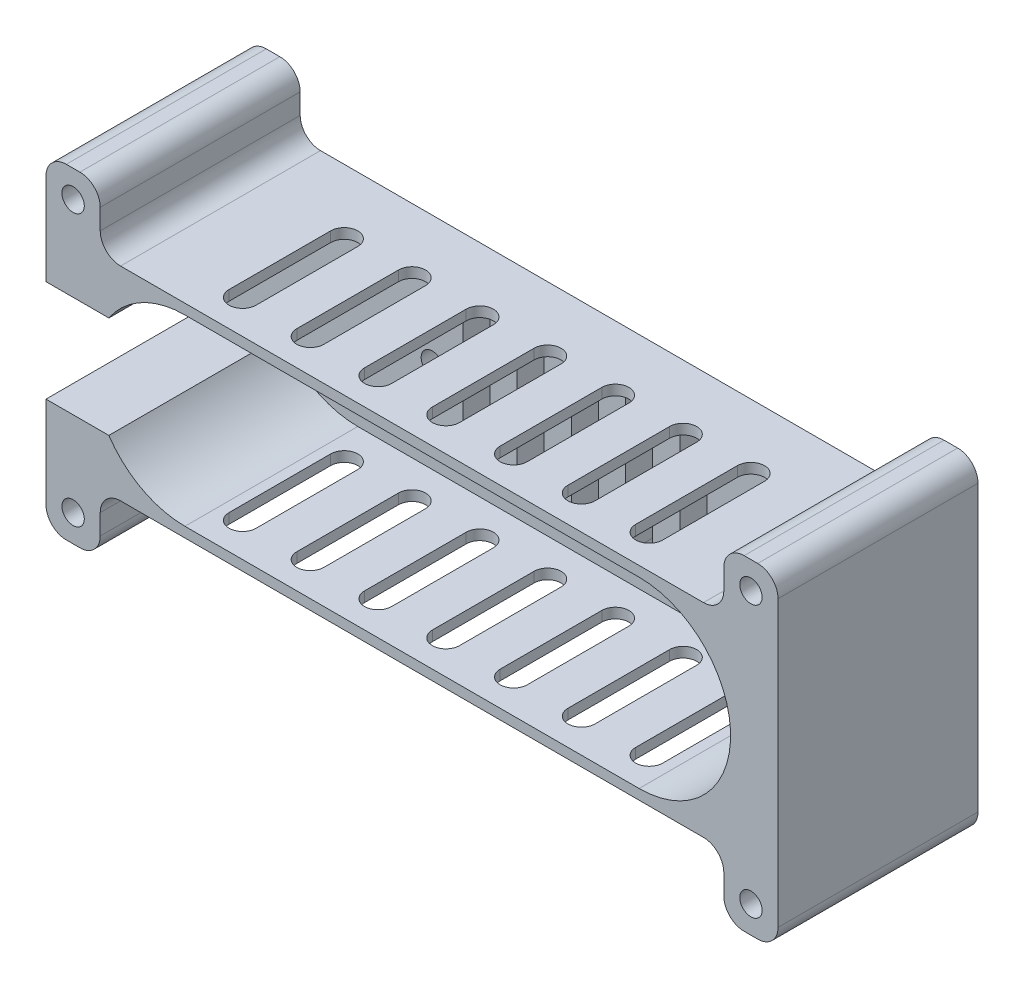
ISO-10303-21;
HEADER;
FILE_DESCRIPTION(('STEP AP214'),'2;1');
FILE_NAME('part.step','',(''),(''),'','','');
FILE_SCHEMA(('AUTOMOTIVE_DESIGN { 1 0 10303 214 1 1 1 1 }'));
ENDSEC;
DATA;
#1=APPLICATION_CONTEXT('core data for automotive mechanical design processes');
#2=APPLICATION_PROTOCOL_DEFINITION('international standard','automotive_design',2000,#1);
#3=PRODUCT_CONTEXT('',#1,'mechanical');
#4=PRODUCT('Part','Part','',(#3));
#5=PRODUCT_RELATED_PRODUCT_CATEGORY('part','',(#4));
#6=PRODUCT_DEFINITION_FORMATION('','',#4);
#7=PRODUCT_DEFINITION_CONTEXT('part definition',#1,'design');
#8=PRODUCT_DEFINITION('design','',#6,#7);
#9=PRODUCT_DEFINITION_SHAPE('','',#8);
#10=(LENGTH_UNIT() NAMED_UNIT(*) SI_UNIT(.MILLI.,.METRE.));
#11=(NAMED_UNIT(*) PLANE_ANGLE_UNIT() SI_UNIT($,.RADIAN.));
#12=(NAMED_UNIT(*) SI_UNIT($,.STERADIAN.) SOLID_ANGLE_UNIT());
#13=UNCERTAINTY_MEASURE_WITH_UNIT(LENGTH_MEASURE(1.E-05),#10,'distance_accuracy_value','');
#14=(GEOMETRIC_REPRESENTATION_CONTEXT(3) GLOBAL_UNCERTAINTY_ASSIGNED_CONTEXT((#13)) GLOBAL_UNIT_ASSIGNED_CONTEXT((#10,
#11,#12)) REPRESENTATION_CONTEXT('',''));
#15=CARTESIAN_POINT('',(0.,0.,0.));
#16=DIRECTION('',(0.,0.,1.));
#17=DIRECTION('',(1.,0.,0.));
#18=AXIS2_PLACEMENT_3D('',#15,#16,#17);
#19=CARTESIAN_POINT('',(-28.,24.,0.));
#20=DIRECTION('',(-1.,0.,0.));
#21=DIRECTION('',(0.,0.,1.));
#22=AXIS2_PLACEMENT_3D('',#19,#20,#21);
#23=PLANE('',#22);
#24=DIRECTION('',(0.,-1.,0.));
#25=VECTOR('',#24,1.);
#26=CARTESIAN_POINT('',(-28.,24.,20.5));
#27=LINE('',#26,#25);
#28=CARTESIAN_POINT('',(-28.,15.,20.5));
#29=VERTEX_POINT('',#28);
#30=CARTESIAN_POINT('',(-28.,13.5,20.5));
#31=VERTEX_POINT('',#30);
#32=EDGE_CURVE('E11',#29,#31,#27,.T.);
#33=ORIENTED_EDGE('',*,*,#32,.F.);
#34=DIRECTION('',(0.,0.,-1.));
#35=VECTOR('',#34,1.);
#36=CARTESIAN_POINT('',(-28.,15.,-4.));
#37=LINE('',#36,#35);
#38=CARTESIAN_POINT('',(-28.,15.,5.5));
#39=VERTEX_POINT('',#38);
#40=EDGE_CURVE('E1774',#29,#39,#37,.T.);
#41=ORIENTED_EDGE('',*,*,#40,.T.);
#42=DIRECTION('',(0.,-1.,0.));
#43=VECTOR('',#42,1.);
#44=CARTESIAN_POINT('',(-28.,24.,5.5));
#45=LINE('',#44,#43);
#46=CARTESIAN_POINT('',(-28.,13.5,5.5));
#47=VERTEX_POINT('',#46);
#48=EDGE_CURVE('E2173',#39,#47,#45,.T.);
#49=ORIENTED_EDGE('',*,*,#48,.T.);
#50=DIRECTION('',(0.,0.,-1.));
#51=VECTOR('',#50,1.);
#52=CARTESIAN_POINT('',(-28.,13.5,25.5));
#53=LINE('',#52,#51);
#54=EDGE_CURVE('E1574',#31,#47,#53,.T.);
#55=ORIENTED_EDGE('',*,*,#54,.F.);
#56=EDGE_LOOP('',(#33,#41,#49,#55));
#57=FACE_BOUND('',#56,.T.);
#58=ADVANCED_FACE('F17',(#57),#23,.T.);
#59=CARTESIAN_POINT('',(-30.,24.,20.5));
#60=DIRECTION('',(0.,-1.,0.));
#61=DIRECTION('',(0.,0.,-1.));
#62=AXIS2_PLACEMENT_3D('',#59,#60,#61);
#63=CYLINDRICAL_SURFACE('',#62,2.);
#64=CARTESIAN_POINT('',(-30.,13.5,20.5));
#65=DIRECTION('',(0.,-1.,0.));
#66=DIRECTION('',(1.,0.,0.));
#67=AXIS2_PLACEMENT_3D('',#64,#65,#66);
#68=CIRCLE('',#67,2.);
#69=CARTESIAN_POINT('',(-32.,13.5,20.5));
#70=VERTEX_POINT('',#69);
#71=EDGE_CURVE('E1570',#31,#70,#68,.T.);
#72=ORIENTED_EDGE('',*,*,#71,.T.);
#73=DIRECTION('',(0.,-1.,0.));
#74=VECTOR('',#73,1.);
#75=CARTESIAN_POINT('',(-32.,24.,20.5));
#76=LINE('',#75,#74);
#77=CARTESIAN_POINT('',(-32.,15.,20.5));
#78=VERTEX_POINT('',#77);
#79=EDGE_CURVE('E20',#78,#70,#76,.T.);
#80=ORIENTED_EDGE('',*,*,#79,.F.);
#81=CARTESIAN_POINT('',(-30.,15.,20.5));
#82=DIRECTION('',(0.,-1.,0.));
#83=DIRECTION('',(0.,0.,-1.));
#84=AXIS2_PLACEMENT_3D('',#81,#82,#83);
#85=CIRCLE('',#84,2.);
#86=EDGE_CURVE('E1403',#29,#78,#85,.T.);
#87=ORIENTED_EDGE('',*,*,#86,.F.);
#88=ORIENTED_EDGE('',*,*,#32,.T.);
#89=EDGE_LOOP('',(#72,#80,#87,#88));
#90=FACE_BOUND('',#89,.T.);
#91=ADVANCED_FACE('F2252',(#90),#63,.F.);
#92=CARTESIAN_POINT('',(-32.,24.,0.));
#93=DIRECTION('',(-1.,0.,0.));
#94=DIRECTION('',(0.,0.,1.));
#95=AXIS2_PLACEMENT_3D('',#92,#93,#94);
#96=PLANE('',#95);
#97=DIRECTION('',(0.,0.,-1.));
#98=VECTOR('',#97,1.);
#99=CARTESIAN_POINT('',(-32.,13.5,25.5));
#100=LINE('',#99,#98);
#101=CARTESIAN_POINT('',(-32.,13.5,5.5));
#102=VERTEX_POINT('',#101);
#103=EDGE_CURVE('E1566',#70,#102,#100,.T.);
#104=ORIENTED_EDGE('',*,*,#103,.T.);
#105=DIRECTION('',(0.,-1.,0.));
#106=VECTOR('',#105,1.);
#107=CARTESIAN_POINT('',(-32.,24.,5.5));
#108=LINE('',#107,#106);
#109=CARTESIAN_POINT('',(-32.,15.,5.5));
#110=VERTEX_POINT('',#109);
#111=EDGE_CURVE('E1805',#110,#102,#108,.T.);
#112=ORIENTED_EDGE('',*,*,#111,.F.);
#113=DIRECTION('',(0.,0.,-1.));
#114=VECTOR('',#113,1.);
#115=CARTESIAN_POINT('',(-32.,15.,-4.));
#116=LINE('',#115,#114);
#117=EDGE_CURVE('E1765',#78,#110,#116,.T.);
#118=ORIENTED_EDGE('',*,*,#117,.F.);
#119=ORIENTED_EDGE('',*,*,#79,.T.);
#120=EDGE_LOOP('',(#104,#112,#118,#119));
#121=FACE_BOUND('',#120,.T.);
#122=ADVANCED_FACE('F2257',(#121),#96,.F.);
#123=CARTESIAN_POINT('',(-18.,24.,0.));
#124=DIRECTION('',(-1.,0.,0.));
#125=DIRECTION('',(0.,0.,1.));
#126=AXIS2_PLACEMENT_3D('',#123,#124,#125);
#127=PLANE('',#126);
#128=DIRECTION('',(0.,-1.,0.));
#129=VECTOR('',#128,1.);
#130=CARTESIAN_POINT('',(-18.,24.,20.5));
#131=LINE('',#130,#129);
#132=CARTESIAN_POINT('',(-18.,15.,20.5));
#133=VERTEX_POINT('',#132);
#134=CARTESIAN_POINT('',(-18.,13.5,20.5));
#135=VERTEX_POINT('',#134);
#136=EDGE_CURVE('E1809',#133,#135,#131,.T.);
#137=ORIENTED_EDGE('',*,*,#136,.F.);
#138=DIRECTION('',(0.,0.,-1.));
#139=VECTOR('',#138,1.);
#140=CARTESIAN_POINT('',(-18.,15.,-4.));
#141=LINE('',#140,#139);
#142=CARTESIAN_POINT('',(-18.,15.,5.5));
#143=VERTEX_POINT('',#142);
#144=EDGE_CURVE('E1378',#133,#143,#141,.T.);
#145=ORIENTED_EDGE('',*,*,#144,.T.);
#146=DIRECTION('',(0.,-1.,0.));
#147=VECTOR('',#146,1.);
#148=CARTESIAN_POINT('',(-18.,24.,5.5));
#149=LINE('',#148,#147);
#150=CARTESIAN_POINT('',(-18.,13.5,5.5));
#151=VERTEX_POINT('',#150);
#152=EDGE_CURVE('E2180',#143,#151,#149,.T.);
#153=ORIENTED_EDGE('',*,*,#152,.T.);
#154=DIRECTION('',(0.,0.,-1.));
#155=VECTOR('',#154,1.);
#156=CARTESIAN_POINT('',(-18.,13.5,25.5));
#157=LINE('',#156,#155);
#158=EDGE_CURVE('E1585',#135,#151,#157,.T.);
#159=ORIENTED_EDGE('',*,*,#158,.F.);
#160=EDGE_LOOP('',(#137,#145,#153,#159));
#161=FACE_BOUND('',#160,.T.);
#162=ADVANCED_FACE('F4769',(#161),#127,.T.);
#163=CARTESIAN_POINT('',(-20.,24.,20.5));
#164=DIRECTION('',(0.,-1.,0.));
#165=DIRECTION('',(0.,0.,-1.));
#166=AXIS2_PLACEMENT_3D('',#163,#164,#165);
#167=CYLINDRICAL_SURFACE('',#166,2.);
#168=CARTESIAN_POINT('',(-20.,13.5,20.5));
#169=DIRECTION('',(0.,-1.,0.));
#170=DIRECTION('',(1.,0.,0.));
#171=AXIS2_PLACEMENT_3D('',#168,#169,#170);
#172=CIRCLE('',#171,2.);
#173=CARTESIAN_POINT('',(-22.,13.5,20.5));
#174=VERTEX_POINT('',#173);
#175=EDGE_CURVE('E1581',#135,#174,#172,.T.);
#176=ORIENTED_EDGE('',*,*,#175,.T.);
#177=DIRECTION('',(0.,-1.,0.));
#178=VECTOR('',#177,1.);
#179=CARTESIAN_POINT('',(-22.,24.,20.5));
#180=LINE('',#179,#178);
#181=CARTESIAN_POINT('',(-22.,15.,20.5));
#182=VERTEX_POINT('',#181);
#183=EDGE_CURVE('E1948',#182,#174,#180,.T.);
#184=ORIENTED_EDGE('',*,*,#183,.F.);
#185=CARTESIAN_POINT('',(-20.,15.,20.5));
#186=DIRECTION('',(0.,-1.,0.));
#187=DIRECTION('',(0.,0.,-1.));
#188=AXIS2_PLACEMENT_3D('',#185,#186,#187);
#189=CIRCLE('',#188,2.);
#190=EDGE_CURVE('E1379',#133,#182,#189,.T.);
#191=ORIENTED_EDGE('',*,*,#190,.F.);
#192=ORIENTED_EDGE('',*,*,#136,.T.);
#193=EDGE_LOOP('',(#176,#184,#191,#192));
#194=FACE_BOUND('',#193,.T.);
#195=ADVANCED_FACE('F4761',(#194),#167,.F.);
#196=CARTESIAN_POINT('',(-22.,24.,0.));
#197=DIRECTION('',(-1.,0.,0.));
#198=DIRECTION('',(0.,0.,1.));
#199=AXIS2_PLACEMENT_3D('',#196,#197,#198);
#200=PLANE('',#199);
#201=DIRECTION('',(0.,0.,-1.));
#202=VECTOR('',#201,1.);
#203=CARTESIAN_POINT('',(-22.,13.5,25.5));
#204=LINE('',#203,#202);
#205=CARTESIAN_POINT('',(-22.,13.5,5.5));
#206=VERTEX_POINT('',#205);
#207=EDGE_CURVE('E1577',#174,#206,#204,.T.);
#208=ORIENTED_EDGE('',*,*,#207,.T.);
#209=DIRECTION('',(0.,-1.,0.));
#210=VECTOR('',#209,1.);
#211=CARTESIAN_POINT('',(-22.,24.,5.5));
#212=LINE('',#211,#210);
#213=CARTESIAN_POINT('',(-22.,15.,5.5));
#214=VERTEX_POINT('',#213);
#215=EDGE_CURVE('E1945',#214,#206,#212,.T.);
#216=ORIENTED_EDGE('',*,*,#215,.F.);
#217=DIRECTION('',(0.,0.,-1.));
#218=VECTOR('',#217,1.);
#219=CARTESIAN_POINT('',(-22.,15.,-4.));
#220=LINE('',#219,#218);
#221=EDGE_CURVE('E1374',#182,#214,#220,.T.);
#222=ORIENTED_EDGE('',*,*,#221,.F.);
#223=ORIENTED_EDGE('',*,*,#183,.T.);
#224=EDGE_LOOP('',(#208,#216,#222,#223));
#225=FACE_BOUND('',#224,.T.);
#226=ADVANCED_FACE('F4752',(#225),#200,.F.);
#227=CARTESIAN_POINT('',(-8.,24.,0.));
#228=DIRECTION('',(-1.,0.,0.));
#229=DIRECTION('',(0.,0.,1.));
#230=AXIS2_PLACEMENT_3D('',#227,#228,#229);
#231=PLANE('',#230);
#232=DIRECTION('',(0.,-1.,0.));
#233=VECTOR('',#232,1.);
#234=CARTESIAN_POINT('',(-8.,24.,20.5));
#235=LINE('',#234,#233);
#236=CARTESIAN_POINT('',(-8.,15.,20.5));
#237=VERTEX_POINT('',#236);
#238=CARTESIAN_POINT('',(-8.,13.5,20.5));
#239=VERTEX_POINT('',#238);
#240=EDGE_CURVE('E1942',#237,#239,#235,.T.);
#241=ORIENTED_EDGE('',*,*,#240,.F.);
#242=DIRECTION('',(0.,0.,-1.));
#243=VECTOR('',#242,1.);
#244=CARTESIAN_POINT('',(-8.,15.,-4.));
#245=LINE('',#244,#243);
#246=CARTESIAN_POINT('',(-8.,15.,5.5));
#247=VERTEX_POINT('',#246);
#248=EDGE_CURVE('E1787',#237,#247,#245,.T.);
#249=ORIENTED_EDGE('',*,*,#248,.T.);
#250=DIRECTION('',(0.,-1.,0.));
#251=VECTOR('',#250,1.);
#252=CARTESIAN_POINT('',(-8.,24.,5.5));
#253=LINE('',#252,#251);
#254=CARTESIAN_POINT('',(-8.,13.5,5.5));
#255=VERTEX_POINT('',#254);
#256=EDGE_CURVE('E2083',#247,#255,#253,.T.);
#257=ORIENTED_EDGE('',*,*,#256,.T.);
#258=DIRECTION('',(0.,0.,-1.));
#259=VECTOR('',#258,1.);
#260=CARTESIAN_POINT('',(-8.,13.5,25.5));
#261=LINE('',#260,#259);
#262=EDGE_CURVE('E1596',#239,#255,#261,.T.);
#263=ORIENTED_EDGE('',*,*,#262,.F.);
#264=EDGE_LOOP('',(#241,#249,#257,#263));
#265=FACE_BOUND('',#264,.T.);
#266=ADVANCED_FACE('F2425',(#265),#231,.T.);
#267=CARTESIAN_POINT('',(-10.,24.,20.5));
#268=DIRECTION('',(0.,-1.,0.));
#269=DIRECTION('',(0.,0.,-1.));
#270=AXIS2_PLACEMENT_3D('',#267,#268,#269);
#271=CYLINDRICAL_SURFACE('',#270,2.);
#272=CARTESIAN_POINT('',(-10.,13.5,20.5));
#273=DIRECTION('',(0.,-1.,0.));
#274=DIRECTION('',(1.,0.,0.));
#275=AXIS2_PLACEMENT_3D('',#272,#273,#274);
#276=CIRCLE('',#275,2.);
#277=CARTESIAN_POINT('',(-12.,13.5,20.5));
#278=VERTEX_POINT('',#277);
#279=EDGE_CURVE('E1592',#239,#278,#276,.T.);
#280=ORIENTED_EDGE('',*,*,#279,.T.);
#281=DIRECTION('',(0.,-1.,0.));
#282=VECTOR('',#281,1.);
#283=CARTESIAN_POINT('',(-12.,24.,20.5));
#284=LINE('',#283,#282);
#285=CARTESIAN_POINT('',(-12.,15.,20.5));
#286=VERTEX_POINT('',#285);
#287=EDGE_CURVE('E1939',#286,#278,#284,.T.);
#288=ORIENTED_EDGE('',*,*,#287,.F.);
#289=CARTESIAN_POINT('',(-10.,15.,20.5));
#290=DIRECTION('',(0.,-1.,0.));
#291=DIRECTION('',(0.,0.,-1.));
#292=AXIS2_PLACEMENT_3D('',#289,#290,#291);
#293=CIRCLE('',#292,2.);
#294=EDGE_CURVE('E1779',#237,#286,#293,.T.);
#295=ORIENTED_EDGE('',*,*,#294,.F.);
#296=ORIENTED_EDGE('',*,*,#240,.T.);
#297=EDGE_LOOP('',(#280,#288,#295,#296));
#298=FACE_BOUND('',#297,.T.);
#299=ADVANCED_FACE('F2421',(#298),#271,.F.);
#300=CARTESIAN_POINT('',(-12.,24.,0.));
#301=DIRECTION('',(-1.,0.,0.));
#302=DIRECTION('',(0.,0.,1.));
#303=AXIS2_PLACEMENT_3D('',#300,#301,#302);
#304=PLANE('',#303);
#305=DIRECTION('',(0.,0.,-1.));
#306=VECTOR('',#305,1.);
#307=CARTESIAN_POINT('',(-12.,13.5,25.5));
#308=LINE('',#307,#306);
#309=CARTESIAN_POINT('',(-12.,13.5,5.5));
#310=VERTEX_POINT('',#309);
#311=EDGE_CURVE('E1588',#278,#310,#308,.T.);
#312=ORIENTED_EDGE('',*,*,#311,.T.);
#313=DIRECTION('',(0.,-1.,0.));
#314=VECTOR('',#313,1.);
#315=CARTESIAN_POINT('',(-12.,24.,5.5));
#316=LINE('',#315,#314);
#317=CARTESIAN_POINT('',(-12.,15.,5.5));
#318=VERTEX_POINT('',#317);
#319=EDGE_CURVE('E1935',#318,#310,#316,.T.);
#320=ORIENTED_EDGE('',*,*,#319,.F.);
#321=DIRECTION('',(0.,0.,-1.));
#322=VECTOR('',#321,1.);
#323=CARTESIAN_POINT('',(-12.,15.,-4.));
#324=LINE('',#323,#322);
#325=EDGE_CURVE('E1783',#286,#318,#324,.T.);
#326=ORIENTED_EDGE('',*,*,#325,.F.);
#327=ORIENTED_EDGE('',*,*,#287,.T.);
#328=EDGE_LOOP('',(#312,#320,#326,#327));
#329=FACE_BOUND('',#328,.T.);
#330=ADVANCED_FACE('F2424',(#329),#304,.F.);
#331=CARTESIAN_POINT('',(2.,24.,0.));
#332=DIRECTION('',(-1.,0.,0.));
#333=DIRECTION('',(0.,0.,1.));
#334=AXIS2_PLACEMENT_3D('',#331,#332,#333);
#335=PLANE('',#334);
#336=DIRECTION('',(0.,-1.,0.));
#337=VECTOR('',#336,1.);
#338=CARTESIAN_POINT('',(2.,24.,20.5));
#339=LINE('',#338,#337);
#340=CARTESIAN_POINT('',(2.,15.,20.5));
#341=VERTEX_POINT('',#340);
#342=CARTESIAN_POINT('',(2.,13.5,20.5));
#343=VERTEX_POINT('',#342);
#344=EDGE_CURVE('E1543',#341,#343,#339,.T.);
#345=ORIENTED_EDGE('',*,*,#344,.F.);
#346=DIRECTION('',(0.,0.,-1.));
#347=VECTOR('',#346,1.);
#348=CARTESIAN_POINT('',(2.,15.,-4.));
#349=LINE('',#348,#347);
#350=CARTESIAN_POINT('',(2.,15.,5.5));
#351=VERTEX_POINT('',#350);
#352=EDGE_CURVE('E1799',#341,#351,#349,.T.);
#353=ORIENTED_EDGE('',*,*,#352,.T.);
#354=DIRECTION('',(0.,-1.,0.));
#355=VECTOR('',#354,1.);
#356=CARTESIAN_POINT('',(2.,24.,5.5));
#357=LINE('',#356,#355);
#358=CARTESIAN_POINT('',(2.,13.5,5.5));
#359=VERTEX_POINT('',#358);
#360=EDGE_CURVE('E2095',#351,#359,#357,.T.);
#361=ORIENTED_EDGE('',*,*,#360,.T.);
#362=DIRECTION('',(0.,0.,-1.));
#363=VECTOR('',#362,1.);
#364=CARTESIAN_POINT('',(2.,13.5,25.5));
#365=LINE('',#364,#363);
#366=EDGE_CURVE('E1607',#343,#359,#365,.T.);
#367=ORIENTED_EDGE('',*,*,#366,.F.);
#368=EDGE_LOOP('',(#345,#353,#361,#367));
#369=FACE_BOUND('',#368,.T.);
#370=ADVANCED_FACE('F2651',(#369),#335,.T.);
#371=CARTESIAN_POINT('',(0.,24.,20.5));
#372=DIRECTION('',(0.,-1.,0.));
#373=DIRECTION('',(0.,0.,-1.));
#374=AXIS2_PLACEMENT_3D('',#371,#372,#373);
#375=CYLINDRICAL_SURFACE('',#374,2.);
#376=CARTESIAN_POINT('',(0.,13.5,20.5));
#377=DIRECTION('',(0.,-1.,0.));
#378=DIRECTION('',(1.,0.,0.));
#379=AXIS2_PLACEMENT_3D('',#376,#377,#378);
#380=CIRCLE('',#379,2.);
#381=CARTESIAN_POINT('',(-2.,13.5,20.5));
#382=VERTEX_POINT('',#381);
#383=EDGE_CURVE('E1606',#343,#382,#380,.T.);
#384=ORIENTED_EDGE('',*,*,#383,.T.);
#385=DIRECTION('',(0.,-1.,0.));
#386=VECTOR('',#385,1.);
#387=CARTESIAN_POINT('',(-2.,24.,20.5));
#388=LINE('',#387,#386);
#389=CARTESIAN_POINT('',(-2.,15.,20.5));
#390=VERTEX_POINT('',#389);
#391=EDGE_CURVE('E1540',#390,#382,#388,.T.);
#392=ORIENTED_EDGE('',*,*,#391,.F.);
#393=CARTESIAN_POINT('',(0.,15.,20.5));
#394=DIRECTION('',(0.,-1.,0.));
#395=DIRECTION('',(0.,0.,-1.));
#396=AXIS2_PLACEMENT_3D('',#393,#394,#395);
#397=CIRCLE('',#396,2.);
#398=EDGE_CURVE('E1791',#341,#390,#397,.T.);
#399=ORIENTED_EDGE('',*,*,#398,.F.);
#400=ORIENTED_EDGE('',*,*,#344,.T.);
#401=EDGE_LOOP('',(#384,#392,#399,#400));
#402=FACE_BOUND('',#401,.T.);
#403=ADVANCED_FACE('F2399',(#402),#375,.F.);
#404=CARTESIAN_POINT('',(-2.,24.,0.));
#405=DIRECTION('',(-1.,0.,0.));
#406=DIRECTION('',(0.,0.,1.));
#407=AXIS2_PLACEMENT_3D('',#404,#405,#406);
#408=PLANE('',#407);
#409=DIRECTION('',(0.,0.,-1.));
#410=VECTOR('',#409,1.);
#411=CARTESIAN_POINT('',(-2.,13.5,25.5));
#412=LINE('',#411,#410);
#413=CARTESIAN_POINT('',(-2.,13.5,5.5));
#414=VERTEX_POINT('',#413);
#415=EDGE_CURVE('E1602',#382,#414,#412,.T.);
#416=ORIENTED_EDGE('',*,*,#415,.T.);
#417=DIRECTION('',(0.,-1.,0.));
#418=VECTOR('',#417,1.);
#419=CARTESIAN_POINT('',(-2.,24.,5.5));
#420=LINE('',#419,#418);
#421=CARTESIAN_POINT('',(-2.,15.,5.5));
#422=VERTEX_POINT('',#421);
#423=EDGE_CURVE('E1544',#422,#414,#420,.T.);
#424=ORIENTED_EDGE('',*,*,#423,.F.);
#425=DIRECTION('',(0.,0.,-1.));
#426=VECTOR('',#425,1.);
#427=CARTESIAN_POINT('',(-2.,15.,-4.));
#428=LINE('',#427,#426);
#429=EDGE_CURVE('E1795',#390,#422,#428,.T.);
#430=ORIENTED_EDGE('',*,*,#429,.F.);
#431=ORIENTED_EDGE('',*,*,#391,.T.);
#432=EDGE_LOOP('',(#416,#424,#430,#431));
#433=FACE_BOUND('',#432,.T.);
#434=ADVANCED_FACE('F2395',(#433),#408,.F.);
#435=CARTESIAN_POINT('',(12.,24.,0.));
#436=DIRECTION('',(-1.,0.,0.));
#437=DIRECTION('',(0.,0.,1.));
#438=AXIS2_PLACEMENT_3D('',#435,#436,#437);
#439=PLANE('',#438);
#440=DIRECTION('',(0.,-1.,0.));
#441=VECTOR('',#440,1.);
#442=CARTESIAN_POINT('',(12.,24.,20.5));
#443=LINE('',#442,#441);
#444=CARTESIAN_POINT('',(12.,15.,20.5));
#445=VERTEX_POINT('',#444);
#446=CARTESIAN_POINT('',(12.,13.5,20.5));
#447=VERTEX_POINT('',#446);
#448=EDGE_CURVE('E1365',#445,#447,#443,.T.);
#449=ORIENTED_EDGE('',*,*,#448,.F.);
#450=DIRECTION('',(0.,0.,-1.));
#451=VECTOR('',#450,1.);
#452=CARTESIAN_POINT('',(12.,15.,-4.));
#453=LINE('',#452,#451);
#454=CARTESIAN_POINT('',(12.,15.,5.5));
#455=VERTEX_POINT('',#454);
#456=EDGE_CURVE('E1060',#445,#455,#453,.T.);
#457=ORIENTED_EDGE('',*,*,#456,.T.);
#458=DIRECTION('',(0.,-1.,0.));
#459=VECTOR('',#458,1.);
#460=CARTESIAN_POINT('',(12.,24.,5.5));
#461=LINE('',#460,#459);
#462=CARTESIAN_POINT('',(12.,13.5,5.5));
#463=VERTEX_POINT('',#462);
#464=EDGE_CURVE('E2113',#455,#463,#461,.T.);
#465=ORIENTED_EDGE('',*,*,#464,.T.);
#466=DIRECTION('',(0.,0.,-1.));
#467=VECTOR('',#466,1.);
#468=CARTESIAN_POINT('',(12.,13.5,25.5));
#469=LINE('',#468,#467);
#470=EDGE_CURVE('E1615',#447,#463,#469,.T.);
#471=ORIENTED_EDGE('',*,*,#470,.F.);
#472=EDGE_LOOP('',(#449,#457,#465,#471));
#473=FACE_BOUND('',#472,.T.);
#474=ADVANCED_FACE('F2398',(#473),#439,.T.);
#475=CARTESIAN_POINT('',(10.,24.,20.5));
#476=DIRECTION('',(0.,-1.,0.));
#477=DIRECTION('',(0.,0.,-1.));
#478=AXIS2_PLACEMENT_3D('',#475,#476,#477);
#479=CYLINDRICAL_SURFACE('',#478,2.);
#480=CARTESIAN_POINT('',(10.,13.5,20.5));
#481=DIRECTION('',(0.,-1.,0.));
#482=DIRECTION('',(1.,0.,0.));
#483=AXIS2_PLACEMENT_3D('',#480,#481,#482);
#484=CIRCLE('',#483,2.);
#485=CARTESIAN_POINT('',(8.,13.5,20.5));
#486=VERTEX_POINT('',#485);
#487=EDGE_CURVE('E1614',#447,#486,#484,.T.);
#488=ORIENTED_EDGE('',*,*,#487,.T.);
#489=DIRECTION('',(0.,-1.,0.));
#490=VECTOR('',#489,1.);
#491=CARTESIAN_POINT('',(8.,24.,20.5));
#492=LINE('',#491,#490);
#493=CARTESIAN_POINT('',(8.,15.,20.5));
#494=VERTEX_POINT('',#493);
#495=EDGE_CURVE('E1362',#494,#486,#492,.T.);
#496=ORIENTED_EDGE('',*,*,#495,.F.);
#497=CARTESIAN_POINT('',(10.,15.,20.5));
#498=DIRECTION('',(0.,-1.,0.));
#499=DIRECTION('',(0.,0.,-1.));
#500=AXIS2_PLACEMENT_3D('',#497,#498,#499);
#501=CIRCLE('',#500,2.);
#502=EDGE_CURVE('E1061',#445,#494,#501,.T.);
#503=ORIENTED_EDGE('',*,*,#502,.F.);
#504=ORIENTED_EDGE('',*,*,#448,.T.);
#505=EDGE_LOOP('',(#488,#496,#503,#504));
#506=FACE_BOUND('',#505,.T.);
#507=ADVANCED_FACE('F4183',(#506),#479,.F.);
#508=CARTESIAN_POINT('',(8.,24.,0.));
#509=DIRECTION('',(-1.,0.,0.));
#510=DIRECTION('',(0.,0.,1.));
#511=AXIS2_PLACEMENT_3D('',#508,#509,#510);
#512=PLANE('',#511);
#513=DIRECTION('',(0.,0.,-1.));
#514=VECTOR('',#513,1.);
#515=CARTESIAN_POINT('',(8.,13.5,25.5));
#516=LINE('',#515,#514);
#517=CARTESIAN_POINT('',(8.,13.5,5.5));
#518=VERTEX_POINT('',#517);
#519=EDGE_CURVE('E1610',#486,#518,#516,.T.);
#520=ORIENTED_EDGE('',*,*,#519,.T.);
#521=DIRECTION('',(0.,-1.,0.));
#522=VECTOR('',#521,1.);
#523=CARTESIAN_POINT('',(8.,24.,5.5));
#524=LINE('',#523,#522);
#525=CARTESIAN_POINT('',(8.,15.,5.5));
#526=VERTEX_POINT('',#525);
#527=EDGE_CURVE('E1366',#526,#518,#524,.T.);
#528=ORIENTED_EDGE('',*,*,#527,.F.);
#529=DIRECTION('',(0.,0.,-1.));
#530=VECTOR('',#529,1.);
#531=CARTESIAN_POINT('',(8.,15.,-4.));
#532=LINE('',#531,#530);
#533=EDGE_CURVE('E1056',#494,#526,#532,.T.);
#534=ORIENTED_EDGE('',*,*,#533,.F.);
#535=ORIENTED_EDGE('',*,*,#495,.T.);
#536=EDGE_LOOP('',(#520,#528,#534,#535));
#537=FACE_BOUND('',#536,.T.);
#538=ADVANCED_FACE('F2670',(#537),#512,.F.);
#539=CARTESIAN_POINT('',(22.,24.,0.));
#540=DIRECTION('',(-1.,0.,0.));
#541=DIRECTION('',(0.,0.,1.));
#542=AXIS2_PLACEMENT_3D('',#539,#540,#541);
#543=PLANE('',#542);
#544=DIRECTION('',(0.,-1.,0.));
#545=VECTOR('',#544,1.);
#546=CARTESIAN_POINT('',(22.,24.,20.5));
#547=LINE('',#546,#545);
#548=CARTESIAN_POINT('',(22.,15.,20.5));
#549=VERTEX_POINT('',#548);
#550=CARTESIAN_POINT('',(22.,13.5,20.5));
#551=VERTEX_POINT('',#550);
#552=EDGE_CURVE('E1924',#549,#551,#547,.T.);
#553=ORIENTED_EDGE('',*,*,#552,.F.);
#554=DIRECTION('',(0.,0.,-1.));
#555=VECTOR('',#554,1.);
#556=CARTESIAN_POINT('',(22.,15.,-4.));
#557=LINE('',#556,#555);
#558=CARTESIAN_POINT('',(22.,15.,5.5));
#559=VERTEX_POINT('',#558);
#560=EDGE_CURVE('E1184',#549,#559,#557,.T.);
#561=ORIENTED_EDGE('',*,*,#560,.T.);
#562=DIRECTION('',(0.,-1.,0.));
#563=VECTOR('',#562,1.);
#564=CARTESIAN_POINT('',(22.,24.,5.5));
#565=LINE('',#564,#563);
#566=CARTESIAN_POINT('',(22.,13.5,5.5));
#567=VERTEX_POINT('',#566);
#568=EDGE_CURVE('E2131',#559,#567,#565,.T.);
#569=ORIENTED_EDGE('',*,*,#568,.T.);
#570=DIRECTION('',(0.,0.,-1.));
#571=VECTOR('',#570,1.);
#572=CARTESIAN_POINT('',(22.,13.5,25.5));
#573=LINE('',#572,#571);
#574=EDGE_CURVE('E1039',#551,#567,#573,.T.);
#575=ORIENTED_EDGE('',*,*,#574,.F.);
#576=EDGE_LOOP('',(#553,#561,#569,#575));
#577=FACE_BOUND('',#576,.T.);
#578=ADVANCED_FACE('F2668',(#577),#543,.T.);
#579=CARTESIAN_POINT('',(20.,24.,20.5));
#580=DIRECTION('',(0.,-1.,0.));
#581=DIRECTION('',(0.,0.,-1.));
#582=AXIS2_PLACEMENT_3D('',#579,#580,#581);
#583=CYLINDRICAL_SURFACE('',#582,2.);
#584=CARTESIAN_POINT('',(20.,13.5,20.5));
#585=DIRECTION('',(0.,-1.,0.));
#586=DIRECTION('',(1.,0.,0.));
#587=AXIS2_PLACEMENT_3D('',#584,#585,#586);
#588=CIRCLE('',#587,2.);
#589=CARTESIAN_POINT('',(18.,13.5,20.5));
#590=VERTEX_POINT('',#589);
#591=EDGE_CURVE('E1622',#551,#590,#588,.T.);
#592=ORIENTED_EDGE('',*,*,#591,.T.);
#593=DIRECTION('',(0.,-1.,0.));
#594=VECTOR('',#593,1.);
#595=CARTESIAN_POINT('',(18.,24.,20.5));
#596=LINE('',#595,#594);
#597=CARTESIAN_POINT('',(18.,15.,20.5));
#598=VERTEX_POINT('',#597);
#599=EDGE_CURVE('E1921',#598,#590,#596,.T.);
#600=ORIENTED_EDGE('',*,*,#599,.F.);
#601=CARTESIAN_POINT('',(20.,15.,20.5));
#602=DIRECTION('',(0.,-1.,0.));
#603=DIRECTION('',(0.,0.,-1.));
#604=AXIS2_PLACEMENT_3D('',#601,#602,#603);
#605=CIRCLE('',#604,2.);
#606=EDGE_CURVE('E1114',#549,#598,#605,.T.);
#607=ORIENTED_EDGE('',*,*,#606,.F.);
#608=ORIENTED_EDGE('',*,*,#552,.T.);
#609=EDGE_LOOP('',(#592,#600,#607,#608));
#610=FACE_BOUND('',#609,.T.);
#611=ADVANCED_FACE('F2621',(#610),#583,.F.);
#612=CARTESIAN_POINT('',(18.,24.,0.));
#613=DIRECTION('',(-1.,0.,0.));
#614=DIRECTION('',(0.,0.,1.));
#615=AXIS2_PLACEMENT_3D('',#612,#613,#614);
#616=PLANE('',#615);
#617=DIRECTION('',(0.,0.,-1.));
#618=VECTOR('',#617,1.);
#619=CARTESIAN_POINT('',(18.,13.5,25.5));
#620=LINE('',#619,#618);
#621=CARTESIAN_POINT('',(18.,13.5,5.5));
#622=VERTEX_POINT('',#621);
#623=EDGE_CURVE('E1618',#590,#622,#620,.T.);
#624=ORIENTED_EDGE('',*,*,#623,.T.);
#625=DIRECTION('',(0.,-1.,0.));
#626=VECTOR('',#625,1.);
#627=CARTESIAN_POINT('',(18.,24.,5.5));
#628=LINE('',#627,#626);
#629=CARTESIAN_POINT('',(18.,15.,5.5));
#630=VERTEX_POINT('',#629);
#631=EDGE_CURVE('E1917',#630,#622,#628,.T.);
#632=ORIENTED_EDGE('',*,*,#631,.F.);
#633=DIRECTION('',(0.,0.,-1.));
#634=VECTOR('',#633,1.);
#635=CARTESIAN_POINT('',(18.,15.,-4.));
#636=LINE('',#635,#634);
#637=EDGE_CURVE('E1118',#598,#630,#636,.T.);
#638=ORIENTED_EDGE('',*,*,#637,.F.);
#639=ORIENTED_EDGE('',*,*,#599,.T.);
#640=EDGE_LOOP('',(#624,#632,#638,#639));
#641=FACE_BOUND('',#640,.T.);
#642=ADVANCED_FACE('F2618',(#641),#616,.F.);
#643=CARTESIAN_POINT('',(32.,24.,0.));
#644=DIRECTION('',(-1.,0.,0.));
#645=DIRECTION('',(0.,0.,1.));
#646=AXIS2_PLACEMENT_3D('',#643,#644,#645);
#647=PLANE('',#646);
#648=DIRECTION('',(0.,-1.,0.));
#649=VECTOR('',#648,1.);
#650=CARTESIAN_POINT('',(32.,24.,20.5));
#651=LINE('',#650,#649);
#652=CARTESIAN_POINT('',(32.,15.,20.5));
#653=VERTEX_POINT('',#652);
#654=CARTESIAN_POINT('',(32.,13.5,20.5));
#655=VERTEX_POINT('',#654);
#656=EDGE_CURVE('E1916',#653,#655,#651,.T.);
#657=ORIENTED_EDGE('',*,*,#656,.F.);
#658=DIRECTION('',(0.,0.,-1.));
#659=VECTOR('',#658,1.);
#660=CARTESIAN_POINT('',(32.,15.,-4.));
#661=LINE('',#660,#659);
#662=CARTESIAN_POINT('',(32.,15.,5.5));
#663=VERTEX_POINT('',#662);
#664=EDGE_CURVE('E1815',#653,#663,#661,.T.);
#665=ORIENTED_EDGE('',*,*,#664,.T.);
#666=DIRECTION('',(0.,-1.,0.));
#667=VECTOR('',#666,1.);
#668=CARTESIAN_POINT('',(32.,24.,5.5));
#669=LINE('',#668,#667);
#670=CARTESIAN_POINT('',(32.,13.5,5.5));
#671=VERTEX_POINT('',#670);
#672=EDGE_CURVE('E1969',#663,#671,#669,.T.);
#673=ORIENTED_EDGE('',*,*,#672,.T.);
#674=DIRECTION('',(0.,0.,-1.));
#675=VECTOR('',#674,1.);
#676=CARTESIAN_POINT('',(32.,13.5,25.5));
#677=LINE('',#676,#675);
#678=EDGE_CURVE('E1085',#655,#671,#677,.T.);
#679=ORIENTED_EDGE('',*,*,#678,.F.);
#680=EDGE_LOOP('',(#657,#665,#673,#679));
#681=FACE_BOUND('',#680,.T.);
#682=ADVANCED_FACE('F2389',(#681),#647,.T.);
#683=CARTESIAN_POINT('',(30.,24.,20.5));
#684=DIRECTION('',(0.,-1.,0.));
#685=DIRECTION('',(0.,0.,-1.));
#686=AXIS2_PLACEMENT_3D('',#683,#684,#685);
#687=CYLINDRICAL_SURFACE('',#686,2.);
#688=CARTESIAN_POINT('',(30.,13.5,20.5));
#689=DIRECTION('',(0.,-1.,0.));
#690=DIRECTION('',(1.,0.,0.));
#691=AXIS2_PLACEMENT_3D('',#688,#689,#690);
#692=CIRCLE('',#691,2.);
#693=CARTESIAN_POINT('',(28.,13.5,20.5));
#694=VERTEX_POINT('',#693);
#695=EDGE_CURVE('E1038',#655,#694,#692,.T.);
#696=ORIENTED_EDGE('',*,*,#695,.T.);
#697=DIRECTION('',(0.,-1.,0.));
#698=VECTOR('',#697,1.);
#699=CARTESIAN_POINT('',(28.,24.,20.5));
#700=LINE('',#699,#698);
#701=CARTESIAN_POINT('',(28.,15.,20.5));
#702=VERTEX_POINT('',#701);
#703=EDGE_CURVE('E1498',#702,#694,#700,.T.);
#704=ORIENTED_EDGE('',*,*,#703,.F.);
#705=CARTESIAN_POINT('',(30.,15.,20.5));
#706=DIRECTION('',(0.,-1.,0.));
#707=DIRECTION('',(0.,0.,-1.));
#708=AXIS2_PLACEMENT_3D('',#705,#706,#707);
#709=CIRCLE('',#708,2.);
#710=EDGE_CURVE('E1179',#653,#702,#709,.T.);
#711=ORIENTED_EDGE('',*,*,#710,.F.);
#712=ORIENTED_EDGE('',*,*,#656,.T.);
#713=EDGE_LOOP('',(#696,#704,#711,#712));
#714=FACE_BOUND('',#713,.T.);
#715=ADVANCED_FACE('F2385',(#714),#687,.F.);
#716=CARTESIAN_POINT('',(28.,24.,0.));
#717=DIRECTION('',(-1.,0.,0.));
#718=DIRECTION('',(0.,0.,1.));
#719=AXIS2_PLACEMENT_3D('',#716,#717,#718);
#720=PLANE('',#719);
#721=DIRECTION('',(0.,0.,-1.));
#722=VECTOR('',#721,1.);
#723=CARTESIAN_POINT('',(28.,13.5,25.5));
#724=LINE('',#723,#722);
#725=CARTESIAN_POINT('',(28.,13.5,5.5));
#726=VERTEX_POINT('',#725);
#727=EDGE_CURVE('E1034',#694,#726,#724,.T.);
#728=ORIENTED_EDGE('',*,*,#727,.T.);
#729=DIRECTION('',(0.,-1.,0.));
#730=VECTOR('',#729,1.);
#731=CARTESIAN_POINT('',(28.,24.,5.5));
#732=LINE('',#731,#730);
#733=CARTESIAN_POINT('',(28.,15.,5.5));
#734=VERTEX_POINT('',#733);
#735=EDGE_CURVE('E1494',#734,#726,#732,.T.);
#736=ORIENTED_EDGE('',*,*,#735,.F.);
#737=DIRECTION('',(0.,0.,-1.));
#738=VECTOR('',#737,1.);
#739=CARTESIAN_POINT('',(28.,15.,-4.));
#740=LINE('',#739,#738);
#741=EDGE_CURVE('E1183',#702,#734,#740,.T.);
#742=ORIENTED_EDGE('',*,*,#741,.F.);
#743=ORIENTED_EDGE('',*,*,#703,.T.);
#744=EDGE_LOOP('',(#728,#736,#742,#743));
#745=FACE_BOUND('',#744,.T.);
#746=ADVANCED_FACE('F2388',(#745),#720,.F.);
#747=CARTESIAN_POINT('',(-32.,24.,0.));
#748=DIRECTION('',(-1.,0.,0.));
#749=DIRECTION('',(0.,0.,1.));
#750=AXIS2_PLACEMENT_3D('',#747,#748,#749);
#751=PLANE('',#750);
#752=DIRECTION('',(0.,0.,1.));
#753=VECTOR('',#752,1.);
#754=CARTESIAN_POINT('',(-32.,-13.5,25.5));
#755=LINE('',#754,#753);
#756=CARTESIAN_POINT('',(-32.,-13.5,5.5));
#757=VERTEX_POINT('',#756);
#758=CARTESIAN_POINT('',(-32.,-13.5,20.5));
#759=VERTEX_POINT('',#758);
#760=EDGE_CURVE('E1446',#757,#759,#755,.T.);
#761=ORIENTED_EDGE('',*,*,#760,.T.);
#762=DIRECTION('',(0.,-1.,0.));
#763=VECTOR('',#762,1.);
#764=CARTESIAN_POINT('',(-32.,24.,20.5));
#765=LINE('',#764,#763);
#766=CARTESIAN_POINT('',(-32.,-15.,20.5));
#767=VERTEX_POINT('',#766);
#768=EDGE_CURVE('E1499',#759,#767,#765,.T.);
#769=ORIENTED_EDGE('',*,*,#768,.T.);
#770=DIRECTION('',(0.,0.,-1.));
#771=VECTOR('',#770,1.);
#772=CARTESIAN_POINT('',(-32.,-15.,0.));
#773=LINE('',#772,#771);
#774=CARTESIAN_POINT('',(-32.,-15.,5.5));
#775=VERTEX_POINT('',#774);
#776=EDGE_CURVE('E1825',#767,#775,#773,.T.);
#777=ORIENTED_EDGE('',*,*,#776,.T.);
#778=DIRECTION('',(0.,-1.,0.));
#779=VECTOR('',#778,1.);
#780=CARTESIAN_POINT('',(-32.,24.,5.5));
#781=LINE('',#780,#779);
#782=EDGE_CURVE('E1908',#757,#775,#781,.T.);
#783=ORIENTED_EDGE('',*,*,#782,.F.);
#784=EDGE_LOOP('',(#761,#769,#777,#783));
#785=FACE_BOUND('',#784,.T.);
#786=ADVANCED_FACE('F2346',(#785),#751,.F.);
#787=CARTESIAN_POINT('',(-30.,24.,20.5));
#788=DIRECTION('',(0.,-1.,0.));
#789=DIRECTION('',(0.,0.,-1.));
#790=AXIS2_PLACEMENT_3D('',#787,#788,#789);
#791=CYLINDRICAL_SURFACE('',#790,2.);
#792=CARTESIAN_POINT('',(-30.,-13.5,20.5));
#793=DIRECTION('',(0.,1.,0.));
#794=DIRECTION('',(0.,0.,1.));
#795=AXIS2_PLACEMENT_3D('',#792,#793,#794);
#796=CIRCLE('',#795,2.);
#797=CARTESIAN_POINT('',(-28.,-13.5,20.5));
#798=VERTEX_POINT('',#797);
#799=EDGE_CURVE('E1454',#759,#798,#796,.T.);
#800=ORIENTED_EDGE('',*,*,#799,.T.);
#801=DIRECTION('',(0.,-1.,0.));
#802=VECTOR('',#801,1.);
#803=CARTESIAN_POINT('',(-28.,24.,20.5));
#804=LINE('',#803,#802);
#805=CARTESIAN_POINT('',(-28.,-15.,20.5));
#806=VERTEX_POINT('',#805);
#807=EDGE_CURVE('E1599',#798,#806,#804,.T.);
#808=ORIENTED_EDGE('',*,*,#807,.T.);
#809=CARTESIAN_POINT('',(-30.,-15.,20.5));
#810=DIRECTION('',(0.,-1.,0.));
#811=DIRECTION('',(0.,0.,-1.));
#812=AXIS2_PLACEMENT_3D('',#809,#810,#811);
#813=CIRCLE('',#812,2.);
#814=EDGE_CURVE('E1829',#806,#767,#813,.T.);
#815=ORIENTED_EDGE('',*,*,#814,.T.);
#816=ORIENTED_EDGE('',*,*,#768,.F.);
#817=EDGE_LOOP('',(#800,#808,#815,#816));
#818=FACE_BOUND('',#817,.T.);
#819=ADVANCED_FACE('F2342',(#818),#791,.F.);
#820=CARTESIAN_POINT('',(-28.,24.,0.));
#821=DIRECTION('',(-1.,0.,0.));
#822=DIRECTION('',(0.,0.,1.));
#823=AXIS2_PLACEMENT_3D('',#820,#821,#822);
#824=PLANE('',#823);
#825=DIRECTION('',(0.,-1.,0.));
#826=VECTOR('',#825,1.);
#827=CARTESIAN_POINT('',(-28.,24.,5.5));
#828=LINE('',#827,#826);
#829=CARTESIAN_POINT('',(-28.,-13.5,5.5));
#830=VERTEX_POINT('',#829);
#831=CARTESIAN_POINT('',(-28.,-15.,5.5));
#832=VERTEX_POINT('',#831);
#833=EDGE_CURVE('E1990',#830,#832,#828,.T.);
#834=ORIENTED_EDGE('',*,*,#833,.T.);
#835=DIRECTION('',(0.,0.,-1.));
#836=VECTOR('',#835,1.);
#837=CARTESIAN_POINT('',(-28.,-15.,0.));
#838=LINE('',#837,#836);
#839=EDGE_CURVE('E1833',#806,#832,#838,.T.);
#840=ORIENTED_EDGE('',*,*,#839,.F.);
#841=ORIENTED_EDGE('',*,*,#807,.F.);
#842=DIRECTION('',(0.,0.,1.));
#843=VECTOR('',#842,1.);
#844=CARTESIAN_POINT('',(-28.,-13.5,25.5));
#845=LINE('',#844,#843);
#846=EDGE_CURVE('E1450',#830,#798,#845,.T.);
#847=ORIENTED_EDGE('',*,*,#846,.F.);
#848=EDGE_LOOP('',(#834,#840,#841,#847));
#849=FACE_BOUND('',#848,.T.);
#850=ADVANCED_FACE('F2345',(#849),#824,.T.);
#851=CARTESIAN_POINT('',(-22.,24.,0.));
#852=DIRECTION('',(-1.,0.,0.));
#853=DIRECTION('',(0.,0.,1.));
#854=AXIS2_PLACEMENT_3D('',#851,#852,#853);
#855=PLANE('',#854);
#856=DIRECTION('',(0.,0.,1.));
#857=VECTOR('',#856,1.);
#858=CARTESIAN_POINT('',(-22.,-13.5,25.5));
#859=LINE('',#858,#857);
#860=CARTESIAN_POINT('',(-22.,-13.5,5.5));
#861=VERTEX_POINT('',#860);
#862=CARTESIAN_POINT('',(-22.,-13.5,20.5));
#863=VERTEX_POINT('',#862);
#864=EDGE_CURVE('E1458',#861,#863,#859,.T.);
#865=ORIENTED_EDGE('',*,*,#864,.T.);
#866=DIRECTION('',(0.,-1.,0.));
#867=VECTOR('',#866,1.);
#868=CARTESIAN_POINT('',(-22.,24.,20.5));
#869=LINE('',#868,#867);
#870=CARTESIAN_POINT('',(-22.,-15.,20.5));
#871=VERTEX_POINT('',#870);
#872=EDGE_CURVE('E1905',#863,#871,#869,.T.);
#873=ORIENTED_EDGE('',*,*,#872,.T.);
#874=DIRECTION('',(0.,0.,-1.));
#875=VECTOR('',#874,1.);
#876=CARTESIAN_POINT('',(-22.,-15.,0.));
#877=LINE('',#876,#875);
#878=CARTESIAN_POINT('',(-22.,-15.,5.5));
#879=VERTEX_POINT('',#878);
#880=EDGE_CURVE('E1836',#871,#879,#877,.T.);
#881=ORIENTED_EDGE('',*,*,#880,.T.);
#882=DIRECTION('',(0.,-1.,0.));
#883=VECTOR('',#882,1.);
#884=CARTESIAN_POINT('',(-22.,24.,5.5));
#885=LINE('',#884,#883);
#886=EDGE_CURVE('E1898',#861,#879,#885,.T.);
#887=ORIENTED_EDGE('',*,*,#886,.F.);
#888=EDGE_LOOP('',(#865,#873,#881,#887));
#889=FACE_BOUND('',#888,.T.);
#890=ADVANCED_FACE('F2541',(#889),#855,.F.);
#891=CARTESIAN_POINT('',(-20.,24.,20.5));
#892=DIRECTION('',(0.,-1.,0.));
#893=DIRECTION('',(0.,0.,-1.));
#894=AXIS2_PLACEMENT_3D('',#891,#892,#893);
#895=CYLINDRICAL_SURFACE('',#894,2.);
#896=CARTESIAN_POINT('',(-20.,-13.5,20.5));
#897=DIRECTION('',(0.,1.,0.));
#898=DIRECTION('',(0.,0.,1.));
#899=AXIS2_PLACEMENT_3D('',#896,#897,#898);
#900=CIRCLE('',#899,2.);
#901=CARTESIAN_POINT('',(-18.,-13.5,20.5));
#902=VERTEX_POINT('',#901);
#903=EDGE_CURVE('E1475',#863,#902,#900,.T.);
#904=ORIENTED_EDGE('',*,*,#903,.T.);
#905=DIRECTION('',(0.,-1.,0.));
#906=VECTOR('',#905,1.);
#907=CARTESIAN_POINT('',(-18.,24.,20.5));
#908=LINE('',#907,#906);
#909=CARTESIAN_POINT('',(-18.,-15.,20.5));
#910=VERTEX_POINT('',#909);
#911=EDGE_CURVE('E1902',#902,#910,#908,.T.);
#912=ORIENTED_EDGE('',*,*,#911,.T.);
#913=CARTESIAN_POINT('',(-20.,-15.,20.5));
#914=DIRECTION('',(0.,-1.,0.));
#915=DIRECTION('',(0.,0.,-1.));
#916=AXIS2_PLACEMENT_3D('',#913,#914,#915);
#917=CIRCLE('',#916,2.);
#918=EDGE_CURVE('E1840',#910,#871,#917,.T.);
#919=ORIENTED_EDGE('',*,*,#918,.T.);
#920=ORIENTED_EDGE('',*,*,#872,.F.);
#921=EDGE_LOOP('',(#904,#912,#919,#920));
#922=FACE_BOUND('',#921,.T.);
#923=ADVANCED_FACE('F2546',(#922),#895,.F.);
#924=CARTESIAN_POINT('',(-18.,24.,0.));
#925=DIRECTION('',(-1.,0.,0.));
#926=DIRECTION('',(0.,0.,1.));
#927=AXIS2_PLACEMENT_3D('',#924,#925,#926);
#928=PLANE('',#927);
#929=DIRECTION('',(0.,-1.,0.));
#930=VECTOR('',#929,1.);
#931=CARTESIAN_POINT('',(-18.,24.,5.5));
#932=LINE('',#931,#930);
#933=CARTESIAN_POINT('',(-18.,-13.5,5.5));
#934=VERTEX_POINT('',#933);
#935=CARTESIAN_POINT('',(-18.,-15.,5.5));
#936=VERTEX_POINT('',#935);
#937=EDGE_CURVE('E944',#934,#936,#932,.T.);
#938=ORIENTED_EDGE('',*,*,#937,.T.);
#939=DIRECTION('',(0.,0.,-1.));
#940=VECTOR('',#939,1.);
#941=CARTESIAN_POINT('',(-18.,-15.,0.));
#942=LINE('',#941,#940);
#943=EDGE_CURVE('E1844',#910,#936,#942,.T.);
#944=ORIENTED_EDGE('',*,*,#943,.F.);
#945=ORIENTED_EDGE('',*,*,#911,.F.);
#946=DIRECTION('',(0.,0.,1.));
#947=VECTOR('',#946,1.);
#948=CARTESIAN_POINT('',(-18.,-13.5,25.5));
#949=LINE('',#948,#947);
#950=EDGE_CURVE('E1466',#934,#902,#949,.T.);
#951=ORIENTED_EDGE('',*,*,#950,.F.);
#952=EDGE_LOOP('',(#938,#944,#945,#951));
#953=FACE_BOUND('',#952,.T.);
#954=ADVANCED_FACE('F2442',(#953),#928,.T.);
#955=CARTESIAN_POINT('',(-12.,24.,0.));
#956=DIRECTION('',(-1.,0.,0.));
#957=DIRECTION('',(0.,0.,1.));
#958=AXIS2_PLACEMENT_3D('',#955,#956,#957);
#959=PLANE('',#958);
#960=DIRECTION('',(0.,0.,1.));
#961=VECTOR('',#960,1.);
#962=CARTESIAN_POINT('',(-12.,-13.5,25.5));
#963=LINE('',#962,#961);
#964=CARTESIAN_POINT('',(-12.,-13.5,5.5));
#965=VERTEX_POINT('',#964);
#966=CARTESIAN_POINT('',(-12.,-13.5,20.5));
#967=VERTEX_POINT('',#966);
#968=EDGE_CURVE('E1479',#965,#967,#963,.T.);
#969=ORIENTED_EDGE('',*,*,#968,.T.);
#970=DIRECTION('',(0.,-1.,0.));
#971=VECTOR('',#970,1.);
#972=CARTESIAN_POINT('',(-12.,24.,20.5));
#973=LINE('',#972,#971);
#974=CARTESIAN_POINT('',(-12.,-15.,20.5));
#975=VERTEX_POINT('',#974);
#976=EDGE_CURVE('E1897',#967,#975,#973,.T.);
#977=ORIENTED_EDGE('',*,*,#976,.T.);
#978=DIRECTION('',(0.,0.,-1.));
#979=VECTOR('',#978,1.);
#980=CARTESIAN_POINT('',(-12.,-15.,0.));
#981=LINE('',#980,#979);
#982=CARTESIAN_POINT('',(-12.,-15.,5.5));
#983=VERTEX_POINT('',#982);
#984=EDGE_CURVE('E1847',#975,#983,#981,.T.);
#985=ORIENTED_EDGE('',*,*,#984,.T.);
#986=DIRECTION('',(0.,-1.,0.));
#987=VECTOR('',#986,1.);
#988=CARTESIAN_POINT('',(-12.,24.,5.5));
#989=LINE('',#988,#987);
#990=EDGE_CURVE('E935',#965,#983,#989,.T.);
#991=ORIENTED_EDGE('',*,*,#990,.F.);
#992=EDGE_LOOP('',(#969,#977,#985,#991));
#993=FACE_BOUND('',#992,.T.);
#994=ADVANCED_FACE('F2438',(#993),#959,.F.);
#995=CARTESIAN_POINT('',(-10.,24.,20.5));
#996=DIRECTION('',(0.,-1.,0.));
#997=DIRECTION('',(0.,0.,-1.));
#998=AXIS2_PLACEMENT_3D('',#995,#996,#997);
#999=CYLINDRICAL_SURFACE('',#998,2.);
#1000=CARTESIAN_POINT('',(-10.,-13.5,20.5));
#1001=DIRECTION('',(0.,1.,0.));
#1002=DIRECTION('',(0.,0.,1.));
#1003=AXIS2_PLACEMENT_3D('',#1000,#1001,#1002);
#1004=CIRCLE('',#1003,2.);
#1005=CARTESIAN_POINT('',(-8.,-13.5,20.5));
#1006=VERTEX_POINT('',#1005);
#1007=EDGE_CURVE('E1489',#967,#1006,#1004,.T.);
#1008=ORIENTED_EDGE('',*,*,#1007,.T.);
#1009=DIRECTION('',(0.,-1.,0.));
#1010=VECTOR('',#1009,1.);
#1011=CARTESIAN_POINT('',(-8.,24.,20.5));
#1012=LINE('',#1011,#1010);
#1013=CARTESIAN_POINT('',(-8.,-15.,20.5));
#1014=VERTEX_POINT('',#1013);
#1015=EDGE_CURVE('E1894',#1006,#1014,#1012,.T.);
#1016=ORIENTED_EDGE('',*,*,#1015,.T.);
#1017=CARTESIAN_POINT('',(-10.,-15.,20.5));
#1018=DIRECTION('',(0.,-1.,0.));
#1019=DIRECTION('',(0.,0.,-1.));
#1020=AXIS2_PLACEMENT_3D('',#1017,#1018,#1019);
#1021=CIRCLE('',#1020,2.);
#1022=EDGE_CURVE('E918',#1014,#975,#1021,.T.);
#1023=ORIENTED_EDGE('',*,*,#1022,.T.);
#1024=ORIENTED_EDGE('',*,*,#976,.F.);
#1025=EDGE_LOOP('',(#1008,#1016,#1023,#1024));
#1026=FACE_BOUND('',#1025,.T.);
#1027=ADVANCED_FACE('F2441',(#1026),#999,.F.);
#1028=CARTESIAN_POINT('',(-8.,24.,0.));
#1029=DIRECTION('',(-1.,0.,0.));
#1030=DIRECTION('',(0.,0.,1.));
#1031=AXIS2_PLACEMENT_3D('',#1028,#1029,#1030);
#1032=PLANE('',#1031);
#1033=DIRECTION('',(0.,-1.,0.));
#1034=VECTOR('',#1033,1.);
#1035=CARTESIAN_POINT('',(-8.,24.,5.5));
#1036=LINE('',#1035,#1034);
#1037=CARTESIAN_POINT('',(-8.,-13.5,5.5));
#1038=VERTEX_POINT('',#1037);
#1039=CARTESIAN_POINT('',(-8.,-15.,5.5));
#1040=VERTEX_POINT('',#1039);
#1041=EDGE_CURVE('E924',#1038,#1040,#1036,.T.);
#1042=ORIENTED_EDGE('',*,*,#1041,.T.);
#1043=DIRECTION('',(0.,0.,-1.));
#1044=VECTOR('',#1043,1.);
#1045=CARTESIAN_POINT('',(-8.,-15.,0.));
#1046=LINE('',#1045,#1044);
#1047=EDGE_CURVE('E909',#1014,#1040,#1046,.T.);
#1048=ORIENTED_EDGE('',*,*,#1047,.F.);
#1049=ORIENTED_EDGE('',*,*,#1015,.F.);
#1050=DIRECTION('',(0.,0.,1.));
#1051=VECTOR('',#1050,1.);
#1052=CARTESIAN_POINT('',(-8.,-13.5,25.5));
#1053=LINE('',#1052,#1051);
#1054=EDGE_CURVE('E927',#1038,#1006,#1053,.T.);
#1055=ORIENTED_EDGE('',*,*,#1054,.F.);
#1056=EDGE_LOOP('',(#1042,#1048,#1049,#1055));
#1057=FACE_BOUND('',#1056,.T.);
#1058=ADVANCED_FACE('F925',(#1057),#1032,.T.);
#1059=CARTESIAN_POINT('',(-2.,24.,0.));
#1060=DIRECTION('',(-1.,0.,0.));
#1061=DIRECTION('',(0.,0.,1.));
#1062=AXIS2_PLACEMENT_3D('',#1059,#1060,#1061);
#1063=PLANE('',#1062);
#1064=DIRECTION('',(0.,0.,1.));
#1065=VECTOR('',#1064,1.);
#1066=CARTESIAN_POINT('',(-2.,-13.5,25.5));
#1067=LINE('',#1066,#1065);
#1068=CARTESIAN_POINT('',(-2.,-13.5,5.5));
#1069=VERTEX_POINT('',#1068);
#1070=CARTESIAN_POINT('',(-2.,-13.5,20.5));
#1071=VERTEX_POINT('',#1070);
#1072=EDGE_CURVE('E1493',#1069,#1071,#1067,.T.);
#1073=ORIENTED_EDGE('',*,*,#1072,.T.);
#1074=DIRECTION('',(0.,-1.,0.));
#1075=VECTOR('',#1074,1.);
#1076=CARTESIAN_POINT('',(-2.,24.,20.5));
#1077=LINE('',#1076,#1075);
#1078=CARTESIAN_POINT('',(-2.,-15.,20.5));
#1079=VERTEX_POINT('',#1078);
#1080=EDGE_CURVE('E1889',#1071,#1079,#1077,.T.);
#1081=ORIENTED_EDGE('',*,*,#1080,.T.);
#1082=DIRECTION('',(0.,0.,-1.));
#1083=VECTOR('',#1082,1.);
#1084=CARTESIAN_POINT('',(-2.,-15.,0.));
#1085=LINE('',#1084,#1083);
#1086=CARTESIAN_POINT('',(-2.,-15.,5.5));
#1087=VERTEX_POINT('',#1086);
#1088=EDGE_CURVE('E921',#1079,#1087,#1085,.T.);
#1089=ORIENTED_EDGE('',*,*,#1088,.T.);
#1090=DIRECTION('',(0.,-1.,0.));
#1091=VECTOR('',#1090,1.);
#1092=CARTESIAN_POINT('',(-2.,24.,5.5));
#1093=LINE('',#1092,#1091);
#1094=EDGE_CURVE('E1882',#1069,#1087,#1093,.T.);
#1095=ORIENTED_EDGE('',*,*,#1094,.F.);
#1096=EDGE_LOOP('',(#1073,#1081,#1089,#1095));
#1097=FACE_BOUND('',#1096,.T.);
#1098=ADVANCED_FACE('F2506',(#1097),#1063,.F.);
#1099=CARTESIAN_POINT('',(0.,24.,20.5));
#1100=DIRECTION('',(0.,-1.,0.));
#1101=DIRECTION('',(0.,0.,-1.));
#1102=AXIS2_PLACEMENT_3D('',#1099,#1100,#1101);
#1103=CYLINDRICAL_SURFACE('',#1102,2.);
#1104=CARTESIAN_POINT('',(0.,-13.5,20.5));
#1105=DIRECTION('',(0.,1.,0.));
#1106=DIRECTION('',(0.,0.,1.));
#1107=AXIS2_PLACEMENT_3D('',#1104,#1105,#1106);
#1108=CIRCLE('',#1107,2.);
#1109=CARTESIAN_POINT('',(2.,-13.5,20.5));
#1110=VERTEX_POINT('',#1109);
#1111=EDGE_CURVE('E1507',#1071,#1110,#1108,.T.);
#1112=ORIENTED_EDGE('',*,*,#1111,.T.);
#1113=DIRECTION('',(0.,-1.,0.));
#1114=VECTOR('',#1113,1.);
#1115=CARTESIAN_POINT('',(2.,24.,20.5));
#1116=LINE('',#1115,#1114);
#1117=CARTESIAN_POINT('',(2.,-15.,20.5));
#1118=VERTEX_POINT('',#1117);
#1119=EDGE_CURVE('E1886',#1110,#1118,#1116,.T.);
#1120=ORIENTED_EDGE('',*,*,#1119,.T.);
#1121=CARTESIAN_POINT('',(0.,-15.,20.5));
#1122=DIRECTION('',(0.,-1.,0.));
#1123=DIRECTION('',(0.,0.,-1.));
#1124=AXIS2_PLACEMENT_3D('',#1121,#1122,#1123);
#1125=CIRCLE('',#1124,2.);
#1126=EDGE_CURVE('E1855',#1118,#1079,#1125,.T.);
#1127=ORIENTED_EDGE('',*,*,#1126,.T.);
#1128=ORIENTED_EDGE('',*,*,#1080,.F.);
#1129=EDGE_LOOP('',(#1112,#1120,#1127,#1128));
#1130=FACE_BOUND('',#1129,.T.);
#1131=ADVANCED_FACE('F2352',(#1130),#1103,.F.);
#1132=CARTESIAN_POINT('',(2.,24.,0.));
#1133=DIRECTION('',(-1.,0.,0.));
#1134=DIRECTION('',(0.,0.,1.));
#1135=AXIS2_PLACEMENT_3D('',#1132,#1133,#1134);
#1136=PLANE('',#1135);
#1137=DIRECTION('',(0.,-1.,0.));
#1138=VECTOR('',#1137,1.);
#1139=CARTESIAN_POINT('',(2.,24.,5.5));
#1140=LINE('',#1139,#1138);
#1141=CARTESIAN_POINT('',(2.,-13.5,5.5));
#1142=VERTEX_POINT('',#1141);
#1143=CARTESIAN_POINT('',(2.,-15.,5.5));
#1144=VERTEX_POINT('',#1143);
#1145=EDGE_CURVE('E972',#1142,#1144,#1140,.T.);
#1146=ORIENTED_EDGE('',*,*,#1145,.T.);
#1147=DIRECTION('',(0.,0.,-1.));
#1148=VECTOR('',#1147,1.);
#1149=CARTESIAN_POINT('',(2.,-15.,0.));
#1150=LINE('',#1149,#1148);
#1151=EDGE_CURVE('E1517',#1118,#1144,#1150,.T.);
#1152=ORIENTED_EDGE('',*,*,#1151,.F.);
#1153=ORIENTED_EDGE('',*,*,#1119,.F.);
#1154=DIRECTION('',(0.,0.,1.));
#1155=VECTOR('',#1154,1.);
#1156=CARTESIAN_POINT('',(2.,-13.5,25.5));
#1157=LINE('',#1156,#1155);
#1158=EDGE_CURVE('E1503',#1142,#1110,#1157,.T.);
#1159=ORIENTED_EDGE('',*,*,#1158,.F.);
#1160=EDGE_LOOP('',(#1146,#1152,#1153,#1159));
#1161=FACE_BOUND('',#1160,.T.);
#1162=ADVANCED_FACE('F2348',(#1161),#1136,.T.);
#1163=CARTESIAN_POINT('',(8.,24.,0.));
#1164=DIRECTION('',(-1.,0.,0.));
#1165=DIRECTION('',(0.,0.,1.));
#1166=AXIS2_PLACEMENT_3D('',#1163,#1164,#1165);
#1167=PLANE('',#1166);
#1168=DIRECTION('',(0.,0.,1.));
#1169=VECTOR('',#1168,1.);
#1170=CARTESIAN_POINT('',(8.,-13.5,25.5));
#1171=LINE('',#1170,#1169);
#1172=CARTESIAN_POINT('',(8.,-13.5,5.5));
#1173=VERTEX_POINT('',#1172);
#1174=CARTESIAN_POINT('',(8.,-13.5,20.5));
#1175=VERTEX_POINT('',#1174);
#1176=EDGE_CURVE('E1511',#1173,#1175,#1171,.T.);
#1177=ORIENTED_EDGE('',*,*,#1176,.T.);
#1178=DIRECTION('',(0.,-1.,0.));
#1179=VECTOR('',#1178,1.);
#1180=CARTESIAN_POINT('',(8.,24.,20.5));
#1181=LINE('',#1180,#1179);
#1182=CARTESIAN_POINT('',(8.,-15.,20.5));
#1183=VERTEX_POINT('',#1182);
#1184=EDGE_CURVE('E1769',#1175,#1183,#1181,.T.);
#1185=ORIENTED_EDGE('',*,*,#1184,.T.);
#1186=DIRECTION('',(0.,0.,-1.));
#1187=VECTOR('',#1186,1.);
#1188=CARTESIAN_POINT('',(8.,-15.,0.));
#1189=LINE('',#1188,#1187);
#1190=CARTESIAN_POINT('',(8.,-15.,5.5));
#1191=VERTEX_POINT('',#1190);
#1192=EDGE_CURVE('E1512',#1183,#1191,#1189,.T.);
#1193=ORIENTED_EDGE('',*,*,#1192,.T.);
#1194=DIRECTION('',(0.,-1.,0.));
#1195=VECTOR('',#1194,1.);
#1196=CARTESIAN_POINT('',(8.,24.,5.5));
#1197=LINE('',#1196,#1195);
#1198=EDGE_CURVE('E1770',#1173,#1191,#1197,.T.);
#1199=ORIENTED_EDGE('',*,*,#1198,.F.);
#1200=EDGE_LOOP('',(#1177,#1185,#1193,#1199));
#1201=FACE_BOUND('',#1200,.T.);
#1202=ADVANCED_FACE('F2351',(#1201),#1167,.F.);
#1203=CARTESIAN_POINT('',(10.,24.,20.5));
#1204=DIRECTION('',(0.,-1.,0.));
#1205=DIRECTION('',(0.,0.,-1.));
#1206=AXIS2_PLACEMENT_3D('',#1203,#1204,#1205);
#1207=CYLINDRICAL_SURFACE('',#1206,2.);
#1208=CARTESIAN_POINT('',(10.,-13.5,20.5));
#1209=DIRECTION('',(0.,1.,0.));
#1210=DIRECTION('',(0.,0.,1.));
#1211=AXIS2_PLACEMENT_3D('',#1208,#1209,#1210);
#1212=CIRCLE('',#1211,2.);
#1213=CARTESIAN_POINT('',(12.,-13.5,20.5));
#1214=VERTEX_POINT('',#1213);
#1215=EDGE_CURVE('E1280',#1175,#1214,#1212,.T.);
#1216=ORIENTED_EDGE('',*,*,#1215,.T.);
#1217=DIRECTION('',(0.,-1.,0.));
#1218=VECTOR('',#1217,1.);
#1219=CARTESIAN_POINT('',(12.,24.,20.5));
#1220=LINE('',#1219,#1218);
#1221=CARTESIAN_POINT('',(12.,-15.,20.5));
#1222=VERTEX_POINT('',#1221);
#1223=EDGE_CURVE('E1766',#1214,#1222,#1220,.T.);
#1224=ORIENTED_EDGE('',*,*,#1223,.T.);
#1225=CARTESIAN_POINT('',(10.,-15.,20.5));
#1226=DIRECTION('',(0.,-1.,0.));
#1227=DIRECTION('',(0.,0.,-1.));
#1228=AXIS2_PLACEMENT_3D('',#1225,#1226,#1227);
#1229=CIRCLE('',#1228,2.);
#1230=EDGE_CURVE('E1516',#1222,#1183,#1229,.T.);
#1231=ORIENTED_EDGE('',*,*,#1230,.T.);
#1232=ORIENTED_EDGE('',*,*,#1184,.F.);
#1233=EDGE_LOOP('',(#1216,#1224,#1231,#1232));
#1234=FACE_BOUND('',#1233,.T.);
#1235=ADVANCED_FACE('F2448',(#1234),#1207,.F.);
#1236=CARTESIAN_POINT('',(12.,24.,0.));
#1237=DIRECTION('',(-1.,0.,0.));
#1238=DIRECTION('',(0.,0.,1.));
#1239=AXIS2_PLACEMENT_3D('',#1236,#1237,#1238);
#1240=PLANE('',#1239);
#1241=DIRECTION('',(0.,-1.,0.));
#1242=VECTOR('',#1241,1.);
#1243=CARTESIAN_POINT('',(12.,24.,5.5));
#1244=LINE('',#1243,#1242);
#1245=CARTESIAN_POINT('',(12.,-13.5,5.5));
#1246=VERTEX_POINT('',#1245);
#1247=CARTESIAN_POINT('',(12.,-15.,5.5));
#1248=VERTEX_POINT('',#1247);
#1249=EDGE_CURVE('E984',#1246,#1248,#1244,.T.);
#1250=ORIENTED_EDGE('',*,*,#1249,.T.);
#1251=DIRECTION('',(0.,0.,-1.));
#1252=VECTOR('',#1251,1.);
#1253=CARTESIAN_POINT('',(12.,-15.,0.));
#1254=LINE('',#1253,#1252);
#1255=EDGE_CURVE('E1434',#1222,#1248,#1254,.T.);
#1256=ORIENTED_EDGE('',*,*,#1255,.F.);
#1257=ORIENTED_EDGE('',*,*,#1223,.F.);
#1258=DIRECTION('',(0.,0.,1.));
#1259=VECTOR('',#1258,1.);
#1260=CARTESIAN_POINT('',(12.,-13.5,25.5));
#1261=LINE('',#1260,#1259);
#1262=EDGE_CURVE('E1462',#1246,#1214,#1261,.T.);
#1263=ORIENTED_EDGE('',*,*,#1262,.F.);
#1264=EDGE_LOOP('',(#1250,#1256,#1257,#1263));
#1265=FACE_BOUND('',#1264,.T.);
#1266=ADVANCED_FACE('F2451',(#1265),#1240,.T.);
#1267=CARTESIAN_POINT('',(18.,24.,0.));
#1268=DIRECTION('',(-1.,0.,0.));
#1269=DIRECTION('',(0.,0.,1.));
#1270=AXIS2_PLACEMENT_3D('',#1267,#1268,#1269);
#1271=PLANE('',#1270);
#1272=DIRECTION('',(0.,0.,1.));
#1273=VECTOR('',#1272,1.);
#1274=CARTESIAN_POINT('',(18.,-13.5,25.5));
#1275=LINE('',#1274,#1273);
#1276=CARTESIAN_POINT('',(18.,-13.5,5.5));
#1277=VERTEX_POINT('',#1276);
#1278=CARTESIAN_POINT('',(18.,-13.5,20.5));
#1279=VERTEX_POINT('',#1278);
#1280=EDGE_CURVE('E1275',#1277,#1279,#1275,.T.);
#1281=ORIENTED_EDGE('',*,*,#1280,.T.);
#1282=DIRECTION('',(0.,-1.,0.));
#1283=VECTOR('',#1282,1.);
#1284=CARTESIAN_POINT('',(18.,24.,20.5));
#1285=LINE('',#1284,#1283);
#1286=CARTESIAN_POINT('',(18.,-15.,20.5));
#1287=VERTEX_POINT('',#1286);
#1288=EDGE_CURVE('E1790',#1279,#1287,#1285,.T.);
#1289=ORIENTED_EDGE('',*,*,#1288,.T.);
#1290=DIRECTION('',(0.,0.,-1.));
#1291=VECTOR('',#1290,1.);
#1292=CARTESIAN_POINT('',(18.,-15.,0.));
#1293=LINE('',#1292,#1291);
#1294=CARTESIAN_POINT('',(18.,-15.,5.5));
#1295=VERTEX_POINT('',#1294);
#1296=EDGE_CURVE('E1430',#1287,#1295,#1293,.T.);
#1297=ORIENTED_EDGE('',*,*,#1296,.T.);
#1298=DIRECTION('',(0.,-1.,0.));
#1299=VECTOR('',#1298,1.);
#1300=CARTESIAN_POINT('',(18.,24.,5.5));
#1301=LINE('',#1300,#1299);
#1302=EDGE_CURVE('E1146',#1277,#1295,#1301,.T.);
#1303=ORIENTED_EDGE('',*,*,#1302,.F.);
#1304=EDGE_LOOP('',(#1281,#1289,#1297,#1303));
#1305=FACE_BOUND('',#1304,.T.);
#1306=ADVANCED_FACE('F2612',(#1305),#1271,.F.);
#1307=CARTESIAN_POINT('',(20.,24.,20.5));
#1308=DIRECTION('',(0.,-1.,0.));
#1309=DIRECTION('',(0.,0.,-1.));
#1310=AXIS2_PLACEMENT_3D('',#1307,#1308,#1309);
#1311=CYLINDRICAL_SURFACE('',#1310,2.);
#1312=CARTESIAN_POINT('',(20.,-13.5,20.5));
#1313=DIRECTION('',(0.,1.,0.));
#1314=DIRECTION('',(0.,0.,1.));
#1315=AXIS2_PLACEMENT_3D('',#1312,#1313,#1314);
#1316=CIRCLE('',#1315,2.);
#1317=CARTESIAN_POINT('',(22.,-13.5,20.5));
#1318=VERTEX_POINT('',#1317);
#1319=EDGE_CURVE('E1527',#1279,#1318,#1316,.T.);
#1320=ORIENTED_EDGE('',*,*,#1319,.T.);
#1321=DIRECTION('',(0.,-1.,0.));
#1322=VECTOR('',#1321,1.);
#1323=CARTESIAN_POINT('',(22.,24.,20.5));
#1324=LINE('',#1323,#1322);
#1325=CARTESIAN_POINT('',(22.,-15.,20.5));
#1326=VERTEX_POINT('',#1325);
#1327=EDGE_CURVE('E1150',#1318,#1326,#1324,.T.);
#1328=ORIENTED_EDGE('',*,*,#1327,.T.);
#1329=CARTESIAN_POINT('',(20.,-15.,20.5));
#1330=DIRECTION('',(0.,-1.,0.));
#1331=DIRECTION('',(0.,0.,-1.));
#1332=AXIS2_PLACEMENT_3D('',#1329,#1330,#1331);
#1333=CIRCLE('',#1332,2.);
#1334=EDGE_CURVE('E1293',#1326,#1287,#1333,.T.);
#1335=ORIENTED_EDGE('',*,*,#1334,.T.);
#1336=ORIENTED_EDGE('',*,*,#1288,.F.);
#1337=EDGE_LOOP('',(#1320,#1328,#1335,#1336));
#1338=FACE_BOUND('',#1337,.T.);
#1339=ADVANCED_FACE('F2463',(#1338),#1311,.F.);
#1340=CARTESIAN_POINT('',(22.,24.,0.));
#1341=DIRECTION('',(-1.,0.,0.));
#1342=DIRECTION('',(0.,0.,1.));
#1343=AXIS2_PLACEMENT_3D('',#1340,#1341,#1342);
#1344=PLANE('',#1343);
#1345=DIRECTION('',(0.,-1.,0.));
#1346=VECTOR('',#1345,1.);
#1347=CARTESIAN_POINT('',(22.,24.,5.5));
#1348=LINE('',#1347,#1346);
#1349=CARTESIAN_POINT('',(22.,-13.5,5.5));
#1350=VERTEX_POINT('',#1349);
#1351=CARTESIAN_POINT('',(22.,-15.,5.5));
#1352=VERTEX_POINT('',#1351);
#1353=EDGE_CURVE('E1003',#1350,#1352,#1348,.T.);
#1354=ORIENTED_EDGE('',*,*,#1353,.T.);
#1355=DIRECTION('',(0.,0.,-1.));
#1356=VECTOR('',#1355,1.);
#1357=CARTESIAN_POINT('',(22.,-15.,0.));
#1358=LINE('',#1357,#1356);
#1359=EDGE_CURVE('E1289',#1326,#1352,#1358,.T.);
#1360=ORIENTED_EDGE('',*,*,#1359,.F.);
#1361=ORIENTED_EDGE('',*,*,#1327,.F.);
#1362=DIRECTION('',(0.,0.,1.));
#1363=VECTOR('',#1362,1.);
#1364=CARTESIAN_POINT('',(22.,-13.5,25.5));
#1365=LINE('',#1364,#1363);
#1366=EDGE_CURVE('E1279',#1350,#1318,#1365,.T.);
#1367=ORIENTED_EDGE('',*,*,#1366,.F.);
#1368=EDGE_LOOP('',(#1354,#1360,#1361,#1367));
#1369=FACE_BOUND('',#1368,.T.);
#1370=ADVANCED_FACE('F2459',(#1369),#1344,.T.);
#1371=CARTESIAN_POINT('',(28.,24.,0.));
#1372=DIRECTION('',(-1.,0.,0.));
#1373=DIRECTION('',(0.,0.,1.));
#1374=AXIS2_PLACEMENT_3D('',#1371,#1372,#1373);
#1375=PLANE('',#1374);
#1376=DIRECTION('',(0.,0.,1.));
#1377=VECTOR('',#1376,1.);
#1378=CARTESIAN_POINT('',(28.,-13.5,25.5));
#1379=LINE('',#1378,#1377);
#1380=CARTESIAN_POINT('',(28.,-13.5,5.5));
#1381=VERTEX_POINT('',#1380);
#1382=CARTESIAN_POINT('',(28.,-13.5,20.5));
#1383=VERTEX_POINT('',#1382);
#1384=EDGE_CURVE('E1531',#1381,#1383,#1379,.T.);
#1385=ORIENTED_EDGE('',*,*,#1384,.T.);
#1386=DIRECTION('',(0.,-1.,0.));
#1387=VECTOR('',#1386,1.);
#1388=CARTESIAN_POINT('',(28.,24.,20.5));
#1389=LINE('',#1388,#1387);
#1390=CARTESIAN_POINT('',(28.,-15.,20.5));
#1391=VERTEX_POINT('',#1390);
#1392=EDGE_CURVE('E1151',#1383,#1391,#1389,.T.);
#1393=ORIENTED_EDGE('',*,*,#1392,.T.);
#1394=DIRECTION('',(0.,0.,-1.));
#1395=VECTOR('',#1394,1.);
#1396=CARTESIAN_POINT('',(28.,-15.,0.));
#1397=LINE('',#1396,#1395);
#1398=CARTESIAN_POINT('',(28.,-15.,5.5));
#1399=VERTEX_POINT('',#1398);
#1400=EDGE_CURVE('E1292',#1391,#1399,#1397,.T.);
#1401=ORIENTED_EDGE('',*,*,#1400,.T.);
#1402=DIRECTION('',(0.,-1.,0.));
#1403=VECTOR('',#1402,1.);
#1404=CARTESIAN_POINT('',(28.,24.,5.5));
#1405=LINE('',#1404,#1403);
#1406=EDGE_CURVE('E1550',#1381,#1399,#1405,.T.);
#1407=ORIENTED_EDGE('',*,*,#1406,.F.);
#1408=EDGE_LOOP('',(#1385,#1393,#1401,#1407));
#1409=FACE_BOUND('',#1408,.T.);
#1410=ADVANCED_FACE('F2462',(#1409),#1375,.F.);
#1411=CARTESIAN_POINT('',(30.,24.,20.5));
#1412=DIRECTION('',(0.,-1.,0.));
#1413=DIRECTION('',(0.,0.,-1.));
#1414=AXIS2_PLACEMENT_3D('',#1411,#1412,#1413);
#1415=CYLINDRICAL_SURFACE('',#1414,2.);
#1416=CARTESIAN_POINT('',(30.,-13.5,20.5));
#1417=DIRECTION('',(0.,1.,0.));
#1418=DIRECTION('',(0.,0.,1.));
#1419=AXIS2_PLACEMENT_3D('',#1416,#1417,#1418);
#1420=CIRCLE('',#1419,2.);
#1421=CARTESIAN_POINT('',(32.,-13.5,20.5));
#1422=VERTEX_POINT('',#1421);
#1423=EDGE_CURVE('E1539',#1383,#1422,#1420,.T.);
#1424=ORIENTED_EDGE('',*,*,#1423,.T.);
#1425=DIRECTION('',(0.,-1.,0.));
#1426=VECTOR('',#1425,1.);
#1427=CARTESIAN_POINT('',(32.,24.,20.5));
#1428=LINE('',#1427,#1426);
#1429=CARTESIAN_POINT('',(32.,-15.,20.5));
#1430=VERTEX_POINT('',#1429);
#1431=EDGE_CURVE('E39',#1422,#1430,#1428,.T.);
#1432=ORIENTED_EDGE('',*,*,#1431,.T.);
#1433=CARTESIAN_POINT('',(30.,-15.,20.5));
#1434=DIRECTION('',(0.,-1.,0.));
#1435=DIRECTION('',(0.,0.,-1.));
#1436=AXIS2_PLACEMENT_3D('',#1433,#1434,#1435);
#1437=CIRCLE('',#1436,2.);
#1438=EDGE_CURVE('E1395',#1430,#1391,#1437,.T.);
#1439=ORIENTED_EDGE('',*,*,#1438,.T.);
#1440=ORIENTED_EDGE('',*,*,#1392,.F.);
#1441=EDGE_LOOP('',(#1424,#1432,#1439,#1440));
#1442=FACE_BOUND('',#1441,.T.);
#1443=ADVANCED_FACE('F2480',(#1442),#1415,.F.);
#1444=CARTESIAN_POINT('',(32.,24.,0.));
#1445=DIRECTION('',(-1.,0.,0.));
#1446=DIRECTION('',(0.,0.,1.));
#1447=AXIS2_PLACEMENT_3D('',#1444,#1445,#1446);
#1448=PLANE('',#1447);
#1449=DIRECTION('',(0.,-1.,0.));
#1450=VECTOR('',#1449,1.);
#1451=CARTESIAN_POINT('',(32.,24.,5.5));
#1452=LINE('',#1451,#1450);
#1453=CARTESIAN_POINT('',(32.,-13.5,5.5));
#1454=VERTEX_POINT('',#1453);
#1455=CARTESIAN_POINT('',(32.,-15.,5.5));
#1456=VERTEX_POINT('',#1455);
#1457=EDGE_CURVE('E1006',#1454,#1456,#1452,.T.);
#1458=ORIENTED_EDGE('',*,*,#1457,.T.);
#1459=DIRECTION('',(0.,0.,-1.));
#1460=VECTOR('',#1459,1.);
#1461=CARTESIAN_POINT('',(32.,-15.,0.));
#1462=LINE('',#1461,#1460);
#1463=EDGE_CURVE('E1391',#1430,#1456,#1462,.T.);
#1464=ORIENTED_EDGE('',*,*,#1463,.F.);
#1465=ORIENTED_EDGE('',*,*,#1431,.F.);
#1466=DIRECTION('',(0.,0.,1.));
#1467=VECTOR('',#1466,1.);
#1468=CARTESIAN_POINT('',(32.,-13.5,25.5));
#1469=LINE('',#1468,#1467);
#1470=EDGE_CURVE('E1535',#1454,#1422,#1469,.T.);
#1471=ORIENTED_EDGE('',*,*,#1470,.F.);
#1472=EDGE_LOOP('',(#1458,#1464,#1465,#1471));
#1473=FACE_BOUND('',#1472,.T.);
#1474=ADVANCED_FACE('F4609',(#1473),#1448,.T.);
#1475=CARTESIAN_POINT('',(-49.,-21.,25.5));
#1476=DIRECTION('',(0.,0.,-1.));
#1477=DIRECTION('',(-1.,0.,0.));
#1478=AXIS2_PLACEMENT_3D('',#1475,#1476,#1477);
#1479=CYLINDRICAL_SURFACE('',#1478,3.);
#1480=CARTESIAN_POINT('',(-49.,-21.,-4.));
#1481=DIRECTION('',(0.,0.,-1.));
#1482=DIRECTION('',(-1.,0.,0.));
#1483=AXIS2_PLACEMENT_3D('',#1480,#1481,#1482);
#1484=CIRCLE('',#1483,3.);
#1485=CARTESIAN_POINT('',(-46.,-21.,-4.));
#1486=VERTEX_POINT('',#1485);
#1487=CARTESIAN_POINT('',(-49.,-24.,-4.));
#1488=VERTEX_POINT('',#1487);
#1489=EDGE_CURVE('E1096',#1486,#1488,#1484,.T.);
#1490=ORIENTED_EDGE('',*,*,#1489,.F.);
#1491=DIRECTION('',(0.,0.,-1.));
#1492=VECTOR('',#1491,1.);
#1493=CARTESIAN_POINT('',(-46.,-21.,-4.));
#1494=LINE('',#1493,#1492);
#1495=CARTESIAN_POINT('',(-46.,-21.,25.5));
#1496=VERTEX_POINT('',#1495);
#1497=EDGE_CURVE('E1563',#1496,#1486,#1494,.T.);
#1498=ORIENTED_EDGE('',*,*,#1497,.F.);
#1499=CARTESIAN_POINT('',(-49.,-21.,25.5));
#1500=DIRECTION('',(0.,0.,1.));
#1501=DIRECTION('',(1.,0.,0.));
#1502=AXIS2_PLACEMENT_3D('',#1499,#1500,#1501);
#1503=CIRCLE('',#1502,3.);
#1504=CARTESIAN_POINT('',(-49.,-24.,25.5));
#1505=VERTEX_POINT('',#1504);
#1506=EDGE_CURVE('E1128',#1505,#1496,#1503,.T.);
#1507=ORIENTED_EDGE('',*,*,#1506,.F.);
#1508=DIRECTION('',(0.,0.,1.));
#1509=VECTOR('',#1508,1.);
#1510=CARTESIAN_POINT('',(-49.,-24.,25.5));
#1511=LINE('',#1510,#1509);
#1512=EDGE_CURVE('E1112',#1488,#1505,#1511,.T.);
#1513=ORIENTED_EDGE('',*,*,#1512,.F.);
#1514=EDGE_LOOP('',(#1490,#1498,#1507,#1513));
#1515=FACE_BOUND('',#1514,.T.);
#1516=ADVANCED_FACE('F2045',(#1515),#1479,.T.);
#1517=CARTESIAN_POINT('',(-43.,-18.,-4.));
#1518=DIRECTION('',(0.,0.,-1.));
#1519=DIRECTION('',(-1.,0.,0.));
#1520=AXIS2_PLACEMENT_3D('',#1517,#1518,#1519);
#1521=CYLINDRICAL_SURFACE('',#1520,3.);
#1522=CARTESIAN_POINT('',(-43.,-18.,-4.));
#1523=DIRECTION('',(0.,0.,1.));
#1524=DIRECTION('',(-1.,0.,0.));
#1525=AXIS2_PLACEMENT_3D('',#1522,#1523,#1524);
#1526=CIRCLE('',#1525,3.);
#1527=CARTESIAN_POINT('',(-43.,-15.,-4.));
#1528=VERTEX_POINT('',#1527);
#1529=CARTESIAN_POINT('',(-46.,-18.,-4.));
#1530=VERTEX_POINT('',#1529);
#1531=EDGE_CURVE('E1223',#1528,#1530,#1526,.T.);
#1532=ORIENTED_EDGE('',*,*,#1531,.F.);
#1533=DIRECTION('',(0.,0.,-1.));
#1534=VECTOR('',#1533,1.);
#1535=CARTESIAN_POINT('',(-43.,-15.,-4.));
#1536=LINE('',#1535,#1534);
#1537=CARTESIAN_POINT('',(-43.,-15.,25.5));
#1538=VERTEX_POINT('',#1537);
#1539=EDGE_CURVE('E1562',#1538,#1528,#1536,.T.);
#1540=ORIENTED_EDGE('',*,*,#1539,.F.);
#1541=CARTESIAN_POINT('',(-43.,-18.,25.5));
#1542=DIRECTION('',(0.,0.,-1.));
#1543=DIRECTION('',(1.,0.,0.));
#1544=AXIS2_PLACEMENT_3D('',#1541,#1542,#1543);
#1545=CIRCLE('',#1544,3.);
#1546=CARTESIAN_POINT('',(-46.,-18.,25.5));
#1547=VERTEX_POINT('',#1546);
#1548=EDGE_CURVE('E1127',#1547,#1538,#1545,.T.);
#1549=ORIENTED_EDGE('',*,*,#1548,.F.);
#1550=DIRECTION('',(0.,0.,1.));
#1551=VECTOR('',#1550,1.);
#1552=CARTESIAN_POINT('',(-46.,-18.,25.5));
#1553=LINE('',#1552,#1551);
#1554=EDGE_CURVE('E1818',#1530,#1547,#1553,.T.);
#1555=ORIENTED_EDGE('',*,*,#1554,.F.);
#1556=EDGE_LOOP('',(#1532,#1540,#1549,#1555));
#1557=FACE_BOUND('',#1556,.T.);
#1558=ADVANCED_FACE('F2053',(#1557),#1521,.F.);
#1559=CARTESIAN_POINT('',(49.,-21.,-4.));
#1560=DIRECTION('',(0.,0.,-1.));
#1561=DIRECTION('',(-1.,0.,0.));
#1562=AXIS2_PLACEMENT_3D('',#1559,#1560,#1561);
#1563=CYLINDRICAL_SURFACE('',#1562,3.);
#1564=CARTESIAN_POINT('',(49.,-21.,-4.));
#1565=DIRECTION('',(0.,0.,-1.));
#1566=DIRECTION('',(-1.,0.,0.));
#1567=AXIS2_PLACEMENT_3D('',#1564,#1565,#1566);
#1568=CIRCLE('',#1567,3.);
#1569=CARTESIAN_POINT('',(49.,-24.,-4.));
#1570=VERTEX_POINT('',#1569);
#1571=CARTESIAN_POINT('',(46.,-21.,-4.));
#1572=VERTEX_POINT('',#1571);
#1573=EDGE_CURVE('E1207',#1570,#1572,#1568,.T.);
#1574=ORIENTED_EDGE('',*,*,#1573,.F.);
#1575=DIRECTION('',(0.,0.,-1.));
#1576=VECTOR('',#1575,1.);
#1577=CARTESIAN_POINT('',(49.,-24.,-4.));
#1578=LINE('',#1577,#1576);
#1579=CARTESIAN_POINT('',(49.,-24.,25.5));
#1580=VERTEX_POINT('',#1579);
#1581=EDGE_CURVE('E1196',#1580,#1570,#1578,.T.);
#1582=ORIENTED_EDGE('',*,*,#1581,.F.);
#1583=CARTESIAN_POINT('',(49.,-21.,25.5));
#1584=DIRECTION('',(0.,0.,1.));
#1585=DIRECTION('',(1.,0.,0.));
#1586=AXIS2_PLACEMENT_3D('',#1583,#1584,#1585);
#1587=CIRCLE('',#1586,3.);
#1588=CARTESIAN_POINT('',(46.,-21.,25.5));
#1589=VERTEX_POINT('',#1588);
#1590=EDGE_CURVE('E960',#1589,#1580,#1587,.T.);
#1591=ORIENTED_EDGE('',*,*,#1590,.F.);
#1592=DIRECTION('',(0.,0.,1.));
#1593=VECTOR('',#1592,1.);
#1594=CARTESIAN_POINT('',(46.,-21.,25.5));
#1595=LINE('',#1594,#1593);
#1596=EDGE_CURVE('E1873',#1572,#1589,#1595,.T.);
#1597=ORIENTED_EDGE('',*,*,#1596,.F.);
#1598=EDGE_LOOP('',(#1574,#1582,#1591,#1597));
#1599=FACE_BOUND('',#1598,.T.);
#1600=ADVANCED_FACE('F2066',(#1599),#1563,.T.);
#1601=CARTESIAN_POINT('',(43.,-18.,-4.));
#1602=DIRECTION('',(0.,0.,-1.));
#1603=DIRECTION('',(-1.,0.,0.));
#1604=AXIS2_PLACEMENT_3D('',#1601,#1602,#1603);
#1605=CYLINDRICAL_SURFACE('',#1604,3.);
#1606=CARTESIAN_POINT('',(43.,-18.,-4.));
#1607=DIRECTION('',(0.,0.,1.));
#1608=DIRECTION('',(-1.,0.,0.));
#1609=AXIS2_PLACEMENT_3D('',#1606,#1607,#1608);
#1610=CIRCLE('',#1609,3.);
#1611=CARTESIAN_POINT('',(46.,-18.,-4.));
#1612=VERTEX_POINT('',#1611);
#1613=CARTESIAN_POINT('',(43.,-15.,-4.));
#1614=VERTEX_POINT('',#1613);
#1615=EDGE_CURVE('E1215',#1612,#1614,#1610,.T.);
#1616=ORIENTED_EDGE('',*,*,#1615,.F.);
#1617=DIRECTION('',(0.,0.,-1.));
#1618=VECTOR('',#1617,1.);
#1619=CARTESIAN_POINT('',(46.,-18.,-4.));
#1620=LINE('',#1619,#1618);
#1621=CARTESIAN_POINT('',(46.,-18.,25.5));
#1622=VERTEX_POINT('',#1621);
#1623=EDGE_CURVE('E1394',#1622,#1612,#1620,.T.);
#1624=ORIENTED_EDGE('',*,*,#1623,.F.);
#1625=CARTESIAN_POINT('',(43.,-18.,25.5));
#1626=DIRECTION('',(0.,0.,-1.));
#1627=DIRECTION('',(1.,0.,0.));
#1628=AXIS2_PLACEMENT_3D('',#1625,#1626,#1627);
#1629=CIRCLE('',#1628,3.);
#1630=CARTESIAN_POINT('',(43.,-15.,25.5));
#1631=VERTEX_POINT('',#1630);
#1632=EDGE_CURVE('E1113',#1631,#1622,#1629,.T.);
#1633=ORIENTED_EDGE('',*,*,#1632,.F.);
#1634=DIRECTION('',(0.,0.,1.));
#1635=VECTOR('',#1634,1.);
#1636=CARTESIAN_POINT('',(43.,-15.,25.5));
#1637=LINE('',#1636,#1635);
#1638=EDGE_CURVE('E1559',#1614,#1631,#1637,.T.);
#1639=ORIENTED_EDGE('',*,*,#1638,.F.);
#1640=EDGE_LOOP('',(#1616,#1624,#1633,#1639));
#1641=FACE_BOUND('',#1640,.T.);
#1642=ADVANCED_FACE('F2240',(#1641),#1605,.F.);
#1643=CARTESIAN_POINT('',(46.,-24.,-4.));
#1644=DIRECTION('',(-1.,0.,0.));
#1645=DIRECTION('',(0.,0.,1.));
#1646=AXIS2_PLACEMENT_3D('',#1643,#1644,#1645);
#1647=PLANE('',#1646);
#1648=DIRECTION('',(0.,-1.,0.));
#1649=VECTOR('',#1648,1.);
#1650=CARTESIAN_POINT('',(46.,-24.,25.5));
#1651=LINE('',#1650,#1649);
#1652=EDGE_CURVE('E956',#1622,#1589,#1651,.T.);
#1653=ORIENTED_EDGE('',*,*,#1652,.F.);
#1654=ORIENTED_EDGE('',*,*,#1623,.T.);
#1655=DIRECTION('',(0.,-1.,0.));
#1656=VECTOR('',#1655,1.);
#1657=CARTESIAN_POINT('',(46.,-24.,-4.));
#1658=LINE('',#1657,#1656);
#1659=EDGE_CURVE('E1211',#1612,#1572,#1658,.T.);
#1660=ORIENTED_EDGE('',*,*,#1659,.T.);
#1661=ORIENTED_EDGE('',*,*,#1596,.T.);
#1662=EDGE_LOOP('',(#1653,#1654,#1660,#1661));
#1663=FACE_BOUND('',#1662,.T.);
#1664=ADVANCED_FACE('F2061',(#1663),#1647,.T.);
#1665=CARTESIAN_POINT('',(-46.,-15.,-4.));
#1666=DIRECTION('',(0.,-1.,0.));
#1667=DIRECTION('',(0.,0.,-1.));
#1668=AXIS2_PLACEMENT_3D('',#1665,#1666,#1667);
#1669=PLANE('',#1668);
#1670=ORIENTED_EDGE('',*,*,#1400,.F.);
#1671=ORIENTED_EDGE('',*,*,#1438,.F.);
#1672=ORIENTED_EDGE('',*,*,#1463,.T.);
#1673=CARTESIAN_POINT('',(30.,-15.,5.5));
#1674=DIRECTION('',(0.,-1.,0.));
#1675=DIRECTION('',(0.,0.,-1.));
#1676=AXIS2_PLACEMENT_3D('',#1673,#1674,#1675);
#1677=CIRCLE('',#1676,2.);
#1678=EDGE_CURVE('E50',#1399,#1456,#1677,.T.);
#1679=ORIENTED_EDGE('',*,*,#1678,.F.);
#1680=EDGE_LOOP('',(#1670,#1671,#1672,#1679));
#1681=FACE_BOUND('',#1680,.T.);
#1682=ORIENTED_EDGE('',*,*,#1296,.F.);
#1683=ORIENTED_EDGE('',*,*,#1334,.F.);
#1684=ORIENTED_EDGE('',*,*,#1359,.T.);
#1685=CARTESIAN_POINT('',(20.,-15.,5.5));
#1686=DIRECTION('',(0.,-1.,0.));
#1687=DIRECTION('',(0.,0.,-1.));
#1688=AXIS2_PLACEMENT_3D('',#1685,#1686,#1687);
#1689=CIRCLE('',#1688,2.);
#1690=EDGE_CURVE('E999',#1295,#1352,#1689,.T.);
#1691=ORIENTED_EDGE('',*,*,#1690,.F.);
#1692=EDGE_LOOP('',(#1682,#1683,#1684,#1691));
#1693=FACE_BOUND('',#1692,.T.);
#1694=ORIENTED_EDGE('',*,*,#1192,.F.);
#1695=ORIENTED_EDGE('',*,*,#1230,.F.);
#1696=ORIENTED_EDGE('',*,*,#1255,.T.);
#1697=CARTESIAN_POINT('',(10.,-15.,5.5));
#1698=DIRECTION('',(0.,-1.,0.));
#1699=DIRECTION('',(0.,0.,-1.));
#1700=AXIS2_PLACEMENT_3D('',#1697,#1698,#1699);
#1701=CIRCLE('',#1700,2.);
#1702=EDGE_CURVE('E980',#1191,#1248,#1701,.T.);
#1703=ORIENTED_EDGE('',*,*,#1702,.F.);
#1704=EDGE_LOOP('',(#1694,#1695,#1696,#1703));
#1705=FACE_BOUND('',#1704,.T.);
#1706=ORIENTED_EDGE('',*,*,#1088,.F.);
#1707=ORIENTED_EDGE('',*,*,#1126,.F.);
#1708=ORIENTED_EDGE('',*,*,#1151,.T.);
#1709=CARTESIAN_POINT('',(0.,-15.,5.5));
#1710=DIRECTION('',(0.,-1.,0.));
#1711=DIRECTION('',(0.,0.,-1.));
#1712=AXIS2_PLACEMENT_3D('',#1709,#1710,#1711);
#1713=CIRCLE('',#1712,2.);
#1714=EDGE_CURVE('E977',#1087,#1144,#1713,.T.);
#1715=ORIENTED_EDGE('',*,*,#1714,.F.);
#1716=EDGE_LOOP('',(#1706,#1707,#1708,#1715));
#1717=FACE_BOUND('',#1716,.T.);
#1718=ORIENTED_EDGE('',*,*,#984,.F.);
#1719=ORIENTED_EDGE('',*,*,#1022,.F.);
#1720=ORIENTED_EDGE('',*,*,#1047,.T.);
#1721=CARTESIAN_POINT('',(-10.,-15.,5.5));
#1722=DIRECTION('',(0.,-1.,0.));
#1723=DIRECTION('',(0.,0.,-1.));
#1724=AXIS2_PLACEMENT_3D('',#1721,#1722,#1723);
#1725=CIRCLE('',#1724,2.);
#1726=EDGE_CURVE('E915',#983,#1040,#1725,.T.);
#1727=ORIENTED_EDGE('',*,*,#1726,.F.);
#1728=EDGE_LOOP('',(#1718,#1719,#1720,#1727));
#1729=FACE_BOUND('',#1728,.T.);
#1730=ORIENTED_EDGE('',*,*,#880,.F.);
#1731=ORIENTED_EDGE('',*,*,#918,.F.);
#1732=ORIENTED_EDGE('',*,*,#943,.T.);
#1733=CARTESIAN_POINT('',(-20.,-15.,5.5));
#1734=DIRECTION('',(0.,-1.,0.));
#1735=DIRECTION('',(0.,0.,-1.));
#1736=AXIS2_PLACEMENT_3D('',#1733,#1734,#1735);
#1737=CIRCLE('',#1736,2.);
#1738=EDGE_CURVE('E1999',#879,#936,#1737,.T.);
#1739=ORIENTED_EDGE('',*,*,#1738,.F.);
#1740=EDGE_LOOP('',(#1730,#1731,#1732,#1739));
#1741=FACE_BOUND('',#1740,.T.);
#1742=ORIENTED_EDGE('',*,*,#776,.F.);
#1743=ORIENTED_EDGE('',*,*,#814,.F.);
#1744=ORIENTED_EDGE('',*,*,#839,.T.);
#1745=CARTESIAN_POINT('',(-30.,-15.,5.5));
#1746=DIRECTION('',(0.,-1.,0.));
#1747=DIRECTION('',(0.,0.,-1.));
#1748=AXIS2_PLACEMENT_3D('',#1745,#1746,#1747);
#1749=CIRCLE('',#1748,2.);
#1750=EDGE_CURVE('E1977',#775,#832,#1749,.T.);
#1751=ORIENTED_EDGE('',*,*,#1750,.F.);
#1752=EDGE_LOOP('',(#1742,#1743,#1744,#1751));
#1753=FACE_BOUND('',#1752,.T.);
#1754=DIRECTION('',(1.,0.,0.));
#1755=VECTOR('',#1754,1.);
#1756=CARTESIAN_POINT('',(-46.,-15.,-4.));
#1757=LINE('',#1756,#1755);
#1758=EDGE_CURVE('E1219',#1528,#1614,#1757,.T.);
#1759=ORIENTED_EDGE('',*,*,#1758,.T.);
#1760=ORIENTED_EDGE('',*,*,#1638,.T.);
#1761=DIRECTION('',(1.,0.,0.));
#1762=VECTOR('',#1761,1.);
#1763=CARTESIAN_POINT('',(-46.,-15.,25.5));
#1764=LINE('',#1763,#1762);
#1765=EDGE_CURVE('E1188',#1538,#1631,#1764,.T.);
#1766=ORIENTED_EDGE('',*,*,#1765,.F.);
#1767=ORIENTED_EDGE('',*,*,#1539,.T.);
#1768=EDGE_LOOP('',(#1759,#1760,#1766,#1767));
#1769=FACE_BOUND('',#1768,.T.);
#1770=ADVANCED_FACE('F912',(#1681,#1693,#1705,#1717,#1729,#1741,#1753,#1769),#1669,.T.);
#1771=CARTESIAN_POINT('',(-46.,-24.,-4.));
#1772=DIRECTION('',(1.,0.,0.));
#1773=DIRECTION('',(0.,-1.,0.));
#1774=AXIS2_PLACEMENT_3D('',#1771,#1772,#1773);
#1775=PLANE('',#1774);
#1776=DIRECTION('',(0.,1.,0.));
#1777=VECTOR('',#1776,1.);
#1778=CARTESIAN_POINT('',(-46.,-24.,-4.));
#1779=LINE('',#1778,#1777);
#1780=EDGE_CURVE('E1100',#1486,#1530,#1779,.T.);
#1781=ORIENTED_EDGE('',*,*,#1780,.T.);
#1782=ORIENTED_EDGE('',*,*,#1554,.T.);
#1783=DIRECTION('',(0.,1.,0.));
#1784=VECTOR('',#1783,1.);
#1785=CARTESIAN_POINT('',(-46.,-24.,25.5));
#1786=LINE('',#1785,#1784);
#1787=EDGE_CURVE('E1123',#1496,#1547,#1786,.T.);
#1788=ORIENTED_EDGE('',*,*,#1787,.F.);
#1789=ORIENTED_EDGE('',*,*,#1497,.T.);
#1790=EDGE_LOOP('',(#1781,#1782,#1788,#1789));
#1791=FACE_BOUND('',#1790,.T.);
#1792=ADVANCED_FACE('F2049',(#1791),#1775,.T.);
#1793=CARTESIAN_POINT('',(-49.,21.,-4.));
#1794=DIRECTION('',(0.,0.,1.));
#1795=DIRECTION('',(1.,0.,0.));
#1796=AXIS2_PLACEMENT_3D('',#1793,#1794,#1795);
#1797=CYLINDRICAL_SURFACE('',#1796,3.);
#1798=CARTESIAN_POINT('',(-49.,21.,-4.));
#1799=DIRECTION('',(0.,0.,-1.));
#1800=DIRECTION('',(-1.,0.,0.));
#1801=AXIS2_PLACEMENT_3D('',#1798,#1799,#1800);
#1802=CIRCLE('',#1801,3.);
#1803=CARTESIAN_POINT('',(-49.,24.,-4.));
#1804=VERTEX_POINT('',#1803);
#1805=CARTESIAN_POINT('',(-46.,21.,-4.));
#1806=VERTEX_POINT('',#1805);
#1807=EDGE_CURVE('E1242',#1804,#1806,#1802,.T.);
#1808=ORIENTED_EDGE('',*,*,#1807,.F.);
#1809=DIRECTION('',(0.,0.,-1.));
#1810=VECTOR('',#1809,1.);
#1811=CARTESIAN_POINT('',(-49.,24.,25.5));
#1812=LINE('',#1811,#1810);
#1813=CARTESIAN_POINT('',(-49.,24.,25.5));
#1814=VERTEX_POINT('',#1813);
#1815=EDGE_CURVE('E1370',#1814,#1804,#1812,.T.);
#1816=ORIENTED_EDGE('',*,*,#1815,.F.);
#1817=CARTESIAN_POINT('',(-49.,21.,25.5));
#1818=DIRECTION('',(0.,0.,1.));
#1819=DIRECTION('',(1.,0.,0.));
#1820=AXIS2_PLACEMENT_3D('',#1817,#1818,#1819);
#1821=CIRCLE('',#1820,3.);
#1822=CARTESIAN_POINT('',(-46.,21.,25.5));
#1823=VERTEX_POINT('',#1822);
#1824=EDGE_CURVE('E1062',#1823,#1814,#1821,.T.);
#1825=ORIENTED_EDGE('',*,*,#1824,.F.);
#1826=DIRECTION('',(0.,0.,1.));
#1827=VECTOR('',#1826,1.);
#1828=CARTESIAN_POINT('',(-46.,21.,-4.));
#1829=LINE('',#1828,#1827);
#1830=EDGE_CURVE('E1471',#1806,#1823,#1829,.T.);
#1831=ORIENTED_EDGE('',*,*,#1830,.F.);
#1832=EDGE_LOOP('',(#1808,#1816,#1825,#1831));
#1833=FACE_BOUND('',#1832,.T.);
#1834=ADVANCED_FACE('F2484',(#1833),#1797,.T.);
#1835=CARTESIAN_POINT('',(-43.,18.,-4.));
#1836=DIRECTION('',(0.,0.,-1.));
#1837=DIRECTION('',(-1.,0.,0.));
#1838=AXIS2_PLACEMENT_3D('',#1835,#1836,#1837);
#1839=CYLINDRICAL_SURFACE('',#1838,3.);
#1840=CARTESIAN_POINT('',(-43.,18.,-4.));
#1841=DIRECTION('',(0.,0.,1.));
#1842=DIRECTION('',(-1.,0.,0.));
#1843=AXIS2_PLACEMENT_3D('',#1840,#1841,#1842);
#1844=CIRCLE('',#1843,3.);
#1845=CARTESIAN_POINT('',(-46.,18.,-4.));
#1846=VERTEX_POINT('',#1845);
#1847=CARTESIAN_POINT('',(-43.,15.,-4.));
#1848=VERTEX_POINT('',#1847);
#1849=EDGE_CURVE('E1250',#1846,#1848,#1844,.T.);
#1850=ORIENTED_EDGE('',*,*,#1849,.F.);
#1851=DIRECTION('',(0.,0.,-1.));
#1852=VECTOR('',#1851,1.);
#1853=CARTESIAN_POINT('',(-46.,18.,-4.));
#1854=LINE('',#1853,#1852);
#1855=CARTESIAN_POINT('',(-46.,18.,25.5));
#1856=VERTEX_POINT('',#1855);
#1857=EDGE_CURVE('E1753',#1856,#1846,#1854,.T.);
#1858=ORIENTED_EDGE('',*,*,#1857,.F.);
#1859=CARTESIAN_POINT('',(-43.,18.,25.5));
#1860=DIRECTION('',(0.,0.,-1.));
#1861=DIRECTION('',(1.,0.,0.));
#1862=AXIS2_PLACEMENT_3D('',#1859,#1860,#1861);
#1863=CIRCLE('',#1862,3.);
#1864=CARTESIAN_POINT('',(-43.,15.,25.5));
#1865=VERTEX_POINT('',#1864);
#1866=EDGE_CURVE('E962',#1865,#1856,#1863,.T.);
#1867=ORIENTED_EDGE('',*,*,#1866,.F.);
#1868=DIRECTION('',(0.,0.,1.));
#1869=VECTOR('',#1868,1.);
#1870=CARTESIAN_POINT('',(-43.,15.,25.5));
#1871=LINE('',#1870,#1869);
#1872=EDGE_CURVE('E1400',#1848,#1865,#1871,.T.);
#1873=ORIENTED_EDGE('',*,*,#1872,.F.);
#1874=EDGE_LOOP('',(#1850,#1858,#1867,#1873));
#1875=FACE_BOUND('',#1874,.T.);
#1876=ADVANCED_FACE('F2476',(#1875),#1839,.F.);
#1877=CARTESIAN_POINT('',(49.,21.,25.5));
#1878=DIRECTION('',(0.,0.,1.));
#1879=DIRECTION('',(1.,0.,0.));
#1880=AXIS2_PLACEMENT_3D('',#1877,#1878,#1879);
#1881=CYLINDRICAL_SURFACE('',#1880,3.);
#1882=CARTESIAN_POINT('',(49.,21.,-4.));
#1883=DIRECTION('',(0.,0.,-1.));
#1884=DIRECTION('',(-1.,0.,0.));
#1885=AXIS2_PLACEMENT_3D('',#1882,#1883,#1884);
#1886=CIRCLE('',#1885,3.);
#1887=CARTESIAN_POINT('',(46.,21.,-4.));
#1888=VERTEX_POINT('',#1887);
#1889=CARTESIAN_POINT('',(49.,24.,-4.));
#1890=VERTEX_POINT('',#1889);
#1891=EDGE_CURVE('E1266',#1888,#1890,#1886,.T.);
#1892=ORIENTED_EDGE('',*,*,#1891,.F.);
#1893=DIRECTION('',(0.,0.,-1.));
#1894=VECTOR('',#1893,1.);
#1895=CARTESIAN_POINT('',(46.,21.,-4.));
#1896=LINE('',#1895,#1894);
#1897=CARTESIAN_POINT('',(46.,21.,25.5));
#1898=VERTEX_POINT('',#1897);
#1899=EDGE_CURVE('E1470',#1898,#1888,#1896,.T.);
#1900=ORIENTED_EDGE('',*,*,#1899,.F.);
#1901=CARTESIAN_POINT('',(49.,21.,25.5));
#1902=DIRECTION('',(0.,0.,1.));
#1903=DIRECTION('',(1.,0.,0.));
#1904=AXIS2_PLACEMENT_3D('',#1901,#1902,#1903);
#1905=CIRCLE('',#1904,3.);
#1906=CARTESIAN_POINT('',(49.,24.,25.5));
#1907=VERTEX_POINT('',#1906);
#1908=EDGE_CURVE('E1122',#1907,#1898,#1905,.T.);
#1909=ORIENTED_EDGE('',*,*,#1908,.F.);
#1910=DIRECTION('',(0.,0.,1.));
#1911=VECTOR('',#1910,1.);
#1912=CARTESIAN_POINT('',(49.,24.,25.5));
#1913=LINE('',#1912,#1911);
#1914=EDGE_CURVE('E1410',#1890,#1907,#1913,.T.);
#1915=ORIENTED_EDGE('',*,*,#1914,.F.);
#1916=EDGE_LOOP('',(#1892,#1900,#1909,#1915));
#1917=FACE_BOUND('',#1916,.T.);
#1918=ADVANCED_FACE('F2472',(#1917),#1881,.T.);
#1919=CARTESIAN_POINT('',(43.,18.,-4.));
#1920=DIRECTION('',(0.,0.,-1.));
#1921=DIRECTION('',(-1.,0.,0.));
#1922=AXIS2_PLACEMENT_3D('',#1919,#1920,#1921);
#1923=CYLINDRICAL_SURFACE('',#1922,3.);
#1924=CARTESIAN_POINT('',(43.,18.,-4.));
#1925=DIRECTION('',(0.,0.,1.));
#1926=DIRECTION('',(-1.,0.,0.));
#1927=AXIS2_PLACEMENT_3D('',#1924,#1925,#1926);
#1928=CIRCLE('',#1927,3.);
#1929=CARTESIAN_POINT('',(43.,15.,-4.));
#1930=VERTEX_POINT('',#1929);
#1931=CARTESIAN_POINT('',(46.,18.,-4.));
#1932=VERTEX_POINT('',#1931);
#1933=EDGE_CURVE('E1258',#1930,#1932,#1928,.T.);
#1934=ORIENTED_EDGE('',*,*,#1933,.F.);
#1935=DIRECTION('',(0.,0.,-1.));
#1936=VECTOR('',#1935,1.);
#1937=CARTESIAN_POINT('',(43.,15.,-4.));
#1938=LINE('',#1937,#1936);
#1939=CARTESIAN_POINT('',(43.,15.,25.5));
#1940=VERTEX_POINT('',#1939);
#1941=EDGE_CURVE('E1404',#1940,#1930,#1938,.T.);
#1942=ORIENTED_EDGE('',*,*,#1941,.F.);
#1943=CARTESIAN_POINT('',(43.,18.,25.5));
#1944=DIRECTION('',(0.,0.,-1.));
#1945=DIRECTION('',(1.,0.,0.));
#1946=AXIS2_PLACEMENT_3D('',#1943,#1944,#1945);
#1947=CIRCLE('',#1946,3.);
#1948=CARTESIAN_POINT('',(46.,18.,25.5));
#1949=VERTEX_POINT('',#1948);
#1950=EDGE_CURVE('E971',#1949,#1940,#1947,.T.);
#1951=ORIENTED_EDGE('',*,*,#1950,.F.);
#1952=DIRECTION('',(0.,0.,1.));
#1953=VECTOR('',#1952,1.);
#1954=CARTESIAN_POINT('',(46.,18.,25.5));
#1955=LINE('',#1954,#1953);
#1956=EDGE_CURVE('E1467',#1932,#1949,#1955,.T.);
#1957=ORIENTED_EDGE('',*,*,#1956,.F.);
#1958=EDGE_LOOP('',(#1934,#1942,#1951,#1957));
#1959=FACE_BOUND('',#1958,.T.);
#1960=ADVANCED_FACE('F2324',(#1959),#1923,.F.);
#1961=CARTESIAN_POINT('',(-46.,15.,-4.));
#1962=DIRECTION('',(0.,-1.,0.));
#1963=DIRECTION('',(0.,0.,-1.));
#1964=AXIS2_PLACEMENT_3D('',#1961,#1962,#1963);
#1965=PLANE('',#1964);
#1966=ORIENTED_EDGE('',*,*,#710,.T.);
#1967=ORIENTED_EDGE('',*,*,#741,.T.);
#1968=CARTESIAN_POINT('',(30.,15.,5.5));
#1969=DIRECTION('',(0.,-1.,0.));
#1970=DIRECTION('',(0.,0.,-1.));
#1971=AXIS2_PLACEMENT_3D('',#1968,#1969,#1970);
#1972=CIRCLE('',#1971,2.);
#1973=EDGE_CURVE('E1970',#734,#663,#1972,.T.);
#1974=ORIENTED_EDGE('',*,*,#1973,.T.);
#1975=ORIENTED_EDGE('',*,*,#664,.F.);
#1976=EDGE_LOOP('',(#1966,#1967,#1974,#1975));
#1977=FACE_BOUND('',#1976,.T.);
#1978=ORIENTED_EDGE('',*,*,#606,.T.);
#1979=ORIENTED_EDGE('',*,*,#637,.T.);
#1980=CARTESIAN_POINT('',(20.,15.,5.5));
#1981=DIRECTION('',(0.,-1.,0.));
#1982=DIRECTION('',(0.,0.,-1.));
#1983=AXIS2_PLACEMENT_3D('',#1980,#1981,#1982);
#1984=CIRCLE('',#1983,2.);
#1985=EDGE_CURVE('E2119',#630,#559,#1984,.T.);
#1986=ORIENTED_EDGE('',*,*,#1985,.T.);
#1987=ORIENTED_EDGE('',*,*,#560,.F.);
#1988=EDGE_LOOP('',(#1978,#1979,#1986,#1987));
#1989=FACE_BOUND('',#1988,.T.);
#1990=ORIENTED_EDGE('',*,*,#502,.T.);
#1991=ORIENTED_EDGE('',*,*,#533,.T.);
#1992=CARTESIAN_POINT('',(10.,15.,5.5));
#1993=DIRECTION('',(0.,-1.,0.));
#1994=DIRECTION('',(0.,0.,-1.));
#1995=AXIS2_PLACEMENT_3D('',#1992,#1993,#1994);
#1996=CIRCLE('',#1995,2.);
#1997=EDGE_CURVE('E2099',#526,#455,#1996,.T.);
#1998=ORIENTED_EDGE('',*,*,#1997,.T.);
#1999=ORIENTED_EDGE('',*,*,#456,.F.);
#2000=EDGE_LOOP('',(#1990,#1991,#1998,#1999));
#2001=FACE_BOUND('',#2000,.T.);
#2002=ORIENTED_EDGE('',*,*,#398,.T.);
#2003=ORIENTED_EDGE('',*,*,#429,.T.);
#2004=CARTESIAN_POINT('',(0.,15.,5.5));
#2005=DIRECTION('',(0.,-1.,0.));
#2006=DIRECTION('',(0.,0.,-1.));
#2007=AXIS2_PLACEMENT_3D('',#2004,#2005,#2006);
#2008=CIRCLE('',#2007,2.);
#2009=EDGE_CURVE('E2087',#422,#351,#2008,.T.);
#2010=ORIENTED_EDGE('',*,*,#2009,.T.);
#2011=ORIENTED_EDGE('',*,*,#352,.F.);
#2012=EDGE_LOOP('',(#2002,#2003,#2010,#2011));
#2013=FACE_BOUND('',#2012,.T.);
#2014=ORIENTED_EDGE('',*,*,#294,.T.);
#2015=ORIENTED_EDGE('',*,*,#325,.T.);
#2016=CARTESIAN_POINT('',(-10.,15.,5.5));
#2017=DIRECTION('',(0.,-1.,0.));
#2018=DIRECTION('',(0.,0.,-1.));
#2019=AXIS2_PLACEMENT_3D('',#2016,#2017,#2018);
#2020=CIRCLE('',#2019,2.);
#2021=EDGE_CURVE('E2187',#318,#247,#2020,.T.);
#2022=ORIENTED_EDGE('',*,*,#2021,.T.);
#2023=ORIENTED_EDGE('',*,*,#248,.F.);
#2024=EDGE_LOOP('',(#2014,#2015,#2022,#2023));
#2025=FACE_BOUND('',#2024,.T.);
#2026=ORIENTED_EDGE('',*,*,#190,.T.);
#2027=ORIENTED_EDGE('',*,*,#221,.T.);
#2028=CARTESIAN_POINT('',(-20.,15.,5.5));
#2029=DIRECTION('',(0.,-1.,0.));
#2030=DIRECTION('',(0.,0.,-1.));
#2031=AXIS2_PLACEMENT_3D('',#2028,#2029,#2030);
#2032=CIRCLE('',#2031,2.);
#2033=EDGE_CURVE('E2168',#214,#143,#2032,.T.);
#2034=ORIENTED_EDGE('',*,*,#2033,.T.);
#2035=ORIENTED_EDGE('',*,*,#144,.F.);
#2036=EDGE_LOOP('',(#2026,#2027,#2034,#2035));
#2037=FACE_BOUND('',#2036,.T.);
#2038=ORIENTED_EDGE('',*,*,#86,.T.);
#2039=ORIENTED_EDGE('',*,*,#117,.T.);
#2040=CARTESIAN_POINT('',(-30.,15.,5.5));
#2041=DIRECTION('',(0.,-1.,0.));
#2042=DIRECTION('',(0.,0.,-1.));
#2043=AXIS2_PLACEMENT_3D('',#2040,#2041,#2042);
#2044=CIRCLE('',#2043,2.);
#2045=EDGE_CURVE('E2268',#110,#39,#2044,.T.);
#2046=ORIENTED_EDGE('',*,*,#2045,.T.);
#2047=ORIENTED_EDGE('',*,*,#40,.F.);
#2048=EDGE_LOOP('',(#2038,#2039,#2046,#2047));
#2049=FACE_BOUND('',#2048,.T.);
#2050=DIRECTION('',(1.,0.,0.));
#2051=VECTOR('',#2050,1.);
#2052=CARTESIAN_POINT('',(-46.,15.,25.5));
#2053=LINE('',#2052,#2051);
#2054=EDGE_CURVE('E967',#1865,#1940,#2053,.T.);
#2055=ORIENTED_EDGE('',*,*,#2054,.T.);
#2056=ORIENTED_EDGE('',*,*,#1941,.T.);
#2057=DIRECTION('',(1.,0.,0.));
#2058=VECTOR('',#2057,1.);
#2059=CARTESIAN_POINT('',(-46.,15.,-4.));
#2060=LINE('',#2059,#2058);
#2061=EDGE_CURVE('E1254',#1848,#1930,#2060,.T.);
#2062=ORIENTED_EDGE('',*,*,#2061,.F.);
#2063=ORIENTED_EDGE('',*,*,#1872,.T.);
#2064=EDGE_LOOP('',(#2055,#2056,#2062,#2063));
#2065=FACE_BOUND('',#2064,.T.);
#2066=ADVANCED_FACE('F2266',(#1977,#1989,#2001,#2013,#2025,#2037,#2049,#2065),#1965,.F.);
#2067=CARTESIAN_POINT('',(46.,24.,-4.));
#2068=DIRECTION('',(1.,0.,0.));
#2069=DIRECTION('',(0.,1.,0.));
#2070=AXIS2_PLACEMENT_3D('',#2067,#2068,#2069);
#2071=PLANE('',#2070);
#2072=DIRECTION('',(0.,1.,0.));
#2073=VECTOR('',#2072,1.);
#2074=CARTESIAN_POINT('',(46.,24.,-4.));
#2075=LINE('',#2074,#2073);
#2076=EDGE_CURVE('E1262',#1932,#1888,#2075,.T.);
#2077=ORIENTED_EDGE('',*,*,#2076,.F.);
#2078=ORIENTED_EDGE('',*,*,#1956,.T.);
#2079=DIRECTION('',(0.,1.,0.));
#2080=VECTOR('',#2079,1.);
#2081=CARTESIAN_POINT('',(46.,24.,25.5));
#2082=LINE('',#2081,#2080);
#2083=EDGE_CURVE('E1129',#1949,#1898,#2082,.T.);
#2084=ORIENTED_EDGE('',*,*,#2083,.T.);
#2085=ORIENTED_EDGE('',*,*,#1899,.T.);
#2086=EDGE_LOOP('',(#2077,#2078,#2084,#2085));
#2087=FACE_BOUND('',#2086,.T.);
#2088=ADVANCED_FACE('F2323',(#2087),#2071,.F.);
#2089=CARTESIAN_POINT('',(-46.,24.,-4.));
#2090=DIRECTION('',(-1.,0.,0.));
#2091=DIRECTION('',(0.,1.,0.));
#2092=AXIS2_PLACEMENT_3D('',#2089,#2090,#2091);
#2093=PLANE('',#2092);
#2094=DIRECTION('',(0.,-1.,0.));
#2095=VECTOR('',#2094,1.);
#2096=CARTESIAN_POINT('',(-46.,24.,25.5));
#2097=LINE('',#2096,#2095);
#2098=EDGE_CURVE('E966',#1823,#1856,#2097,.T.);
#2099=ORIENTED_EDGE('',*,*,#2098,.T.);
#2100=ORIENTED_EDGE('',*,*,#1857,.T.);
#2101=DIRECTION('',(0.,-1.,0.));
#2102=VECTOR('',#2101,1.);
#2103=CARTESIAN_POINT('',(-46.,24.,-4.));
#2104=LINE('',#2103,#2102);
#2105=EDGE_CURVE('E1246',#1806,#1846,#2104,.T.);
#2106=ORIENTED_EDGE('',*,*,#2105,.F.);
#2107=ORIENTED_EDGE('',*,*,#1830,.T.);
#2108=EDGE_LOOP('',(#2099,#2100,#2106,#2107));
#2109=FACE_BOUND('',#2108,.T.);
#2110=ADVANCED_FACE('F2457',(#2109),#2093,.F.);
#2111=CARTESIAN_POINT('',(-49.,15.,13.5));
#2112=DIRECTION('',(-1.,0.,0.));
#2113=DIRECTION('',(0.,0.,1.));
#2114=AXIS2_PLACEMENT_3D('',#2111,#2112,#2113);
#2115=PLANE('',#2114);
#2116=CARTESIAN_POINT('',(-49.,15.,13.5));
#2117=DIRECTION('',(-1.,0.,0.));
#2118=DIRECTION('',(0.,0.,1.));
#2119=AXIS2_PLACEMENT_3D('',#2116,#2117,#2118);
#2120=CIRCLE('',#2119,2.);
#2121=CARTESIAN_POINT('',(-49.,15.,15.5));
#2122=VERTEX_POINT('',#2121);
#2123=EDGE_CURVE('E1008',#2122,#2122,#2120,.T.);
#2124=ORIENTED_EDGE('',*,*,#2123,.T.);
#2125=EDGE_LOOP('',(#2124));
#2126=FACE_BOUND('',#2125,.T.);
#2127=ADVANCED_FACE('F2446',(#2126),#2115,.T.);
#2128=CARTESIAN_POINT('',(-49.,-15.,13.5));
#2129=DIRECTION('',(-1.,0.,0.));
#2130=DIRECTION('',(0.,0.,1.));
#2131=AXIS2_PLACEMENT_3D('',#2128,#2129,#2130);
#2132=PLANE('',#2131);
#2133=CARTESIAN_POINT('',(-49.,-15.,13.5));
#2134=DIRECTION('',(-1.,0.,0.));
#2135=DIRECTION('',(0.,0.,1.));
#2136=AXIS2_PLACEMENT_3D('',#2133,#2134,#2135);
#2137=CIRCLE('',#2136,2.);
#2138=CARTESIAN_POINT('',(-49.,-15.,15.5));
#2139=VERTEX_POINT('',#2138);
#2140=EDGE_CURVE('E1021',#2139,#2139,#2137,.T.);
#2141=ORIENTED_EDGE('',*,*,#2140,.T.);
#2142=EDGE_LOOP('',(#2141));
#2143=FACE_BOUND('',#2142,.T.);
#2144=ADVANCED_FACE('F2341',(#2143),#2132,.T.);
#2145=CARTESIAN_POINT('',(-54.,7.5,-19.2093727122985));
#2146=DIRECTION('',(0.,1.,0.));
#2147=DIRECTION('',(1.,0.,0.));
#2148=AXIS2_PLACEMENT_3D('',#2145,#2146,#2147);
#2149=PLANE('',#2148);
#2150=DIRECTION('',(0.,0.,1.));
#2151=VECTOR('',#2150,1.);
#2152=CARTESIAN_POINT('',(-44.7249721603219,7.5,25.5));
#2153=LINE('',#2152,#2151);
#2154=CARTESIAN_POINT('',(-44.7249721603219,7.5,0.));
#2155=VERTEX_POINT('',#2154);
#2156=CARTESIAN_POINT('',(-44.7249721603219,7.5,25.5));
#2157=VERTEX_POINT('',#2156);
#2158=EDGE_CURVE('E1422',#2155,#2157,#2153,.T.);
#2159=ORIENTED_EDGE('',*,*,#2158,.T.);
#2160=DIRECTION('',(-1.,0.,0.));
#2161=VECTOR('',#2160,1.);
#2162=CARTESIAN_POINT('',(-54.,7.5,25.5));
#2163=LINE('',#2162,#2161);
#2164=CARTESIAN_POINT('',(-54.,7.5,25.5));
#2165=VERTEX_POINT('',#2164);
#2166=EDGE_CURVE('E2010',#2157,#2165,#2163,.T.);
#2167=ORIENTED_EDGE('',*,*,#2166,.T.);
#2168=DIRECTION('',(0.,0.,1.));
#2169=VECTOR('',#2168,1.);
#2170=CARTESIAN_POINT('',(-54.,7.5,-19.2093727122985));
#2171=LINE('',#2170,#2169);
#2172=CARTESIAN_POINT('',(-54.,7.5,0.));
#2173=VERTEX_POINT('',#2172);
#2174=EDGE_CURVE('E953',#2173,#2165,#2171,.T.);
#2175=ORIENTED_EDGE('',*,*,#2174,.F.);
#2176=DIRECTION('',(-1.,0.,0.));
#2177=VECTOR('',#2176,1.);
#2178=CARTESIAN_POINT('',(-54.,7.5,0.));
#2179=LINE('',#2178,#2177);
#2180=EDGE_CURVE('E1088',#2155,#2173,#2179,.T.);
#2181=ORIENTED_EDGE('',*,*,#2180,.F.);
#2182=EDGE_LOOP('',(#2159,#2167,#2175,#2181));
#2183=FACE_BOUND('',#2182,.T.);
#2184=ADVANCED_FACE('F2221',(#2183),#2149,.F.);
#2185=CARTESIAN_POINT('',(-54.,-7.5,-19.2093727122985));
#2186=DIRECTION('',(0.,-1.,0.));
#2187=DIRECTION('',(0.,0.,-1.));
#2188=AXIS2_PLACEMENT_3D('',#2185,#2186,#2187);
#2189=PLANE('',#2188);
#2190=DIRECTION('',(0.,0.,-1.));
#2191=VECTOR('',#2190,1.);
#2192=CARTESIAN_POINT('',(-44.7249721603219,-7.5,25.5));
#2193=LINE('',#2192,#2191);
#2194=CARTESIAN_POINT('',(-44.7249721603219,-7.5,25.5));
#2195=VERTEX_POINT('',#2194);
#2196=CARTESIAN_POINT('',(-44.7249721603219,-7.5,0.));
#2197=VERTEX_POINT('',#2196);
#2198=EDGE_CURVE('E1382',#2195,#2197,#2193,.T.);
#2199=ORIENTED_EDGE('',*,*,#2198,.T.);
#2200=DIRECTION('',(1.,0.,0.));
#2201=VECTOR('',#2200,1.);
#2202=CARTESIAN_POINT('',(-54.,-7.5,0.));
#2203=LINE('',#2202,#2201);
#2204=CARTESIAN_POINT('',(-54.,-7.5,0.));
#2205=VERTEX_POINT('',#2204);
#2206=EDGE_CURVE('E1636',#2205,#2197,#2203,.T.);
#2207=ORIENTED_EDGE('',*,*,#2206,.F.);
#2208=DIRECTION('',(0.,0.,1.));
#2209=VECTOR('',#2208,1.);
#2210=CARTESIAN_POINT('',(-54.,-7.5,-19.2093727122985));
#2211=LINE('',#2210,#2209);
#2212=CARTESIAN_POINT('',(-54.,-7.5,25.5));
#2213=VERTEX_POINT('',#2212);
#2214=EDGE_CURVE('E954',#2205,#2213,#2211,.T.);
#2215=ORIENTED_EDGE('',*,*,#2214,.T.);
#2216=DIRECTION('',(1.,0.,0.));
#2217=VECTOR('',#2216,1.);
#2218=CARTESIAN_POINT('',(-54.,-7.5,25.5));
#2219=LINE('',#2218,#2217);
#2220=EDGE_CURVE('E1167',#2213,#2195,#2219,.T.);
#2221=ORIENTED_EDGE('',*,*,#2220,.T.);
#2222=EDGE_LOOP('',(#2199,#2207,#2215,#2221));
#2223=FACE_BOUND('',#2222,.T.);
#2224=ADVANCED_FACE('F2237',(#2223),#2189,.F.);
#2225=CARTESIAN_POINT('',(-18.,10.,-23.));
#2226=DIRECTION('',(-1.,0.,0.));
#2227=DIRECTION('',(0.,0.,1.));
#2228=AXIS2_PLACEMENT_3D('',#2225,#2226,#2227);
#2229=PLANE('',#2228);
#2230=DIRECTION('',(0.,1.,0.));
#2231=VECTOR('',#2230,1.);
#2232=CARTESIAN_POINT('',(-18.,0.,-4.));
#2233=LINE('',#2232,#2231);
#2234=CARTESIAN_POINT('',(-18.,-10.,-4.));
#2235=VERTEX_POINT('',#2234);
#2236=CARTESIAN_POINT('',(-18.,10.,-4.));
#2237=VERTEX_POINT('',#2236);
#2238=EDGE_CURVE('E1306',#2235,#2237,#2233,.T.);
#2239=ORIENTED_EDGE('',*,*,#2238,.T.);
#2240=DIRECTION('',(0.,0.,1.));
#2241=VECTOR('',#2240,1.);
#2242=CARTESIAN_POINT('',(-18.,10.,-23.));
#2243=LINE('',#2242,#2241);
#2244=CARTESIAN_POINT('',(-18.,10.,0.));
#2245=VERTEX_POINT('',#2244);
#2246=EDGE_CURVE('E1744',#2237,#2245,#2243,.T.);
#2247=ORIENTED_EDGE('',*,*,#2246,.T.);
#2248=DIRECTION('',(0.,-1.,0.));
#2249=VECTOR('',#2248,1.);
#2250=CARTESIAN_POINT('',(-18.,10.,0.));
#2251=LINE('',#2250,#2249);
#2252=CARTESIAN_POINT('',(-18.,-10.,0.));
#2253=VERTEX_POINT('',#2252);
#2254=EDGE_CURVE('E1639',#2245,#2253,#2251,.T.);
#2255=ORIENTED_EDGE('',*,*,#2254,.T.);
#2256=DIRECTION('',(0.,0.,1.));
#2257=VECTOR('',#2256,1.);
#2258=CARTESIAN_POINT('',(-18.,-10.,-23.));
#2259=LINE('',#2258,#2257);
#2260=EDGE_CURVE('E1750',#2235,#2253,#2259,.T.);
#2261=ORIENTED_EDGE('',*,*,#2260,.F.);
#2262=EDGE_LOOP('',(#2239,#2247,#2255,#2261));
#2263=FACE_BOUND('',#2262,.T.);
#2264=ADVANCED_FACE('F2416',(#2263),#2229,.F.);
#2265=CARTESIAN_POINT('',(-16.,-10.,-23.));
#2266=DIRECTION('',(0.,0.,1.));
#2267=DIRECTION('',(1.,0.,0.));
#2268=AXIS2_PLACEMENT_3D('',#2265,#2266,#2267);
#2269=CYLINDRICAL_SURFACE('',#2268,2.);
#2270=CARTESIAN_POINT('',(-16.,-10.,-4.));
#2271=DIRECTION('',(0.,0.,-1.));
#2272=DIRECTION('',(-1.,0.,0.));
#2273=AXIS2_PLACEMENT_3D('',#2270,#2271,#2272);
#2274=CIRCLE('',#2273,2.);
#2275=CARTESIAN_POINT('',(-14.,-10.,-4.));
#2276=VERTEX_POINT('',#2275);
#2277=EDGE_CURVE('E1310',#2276,#2235,#2274,.T.);
#2278=ORIENTED_EDGE('',*,*,#2277,.T.);
#2279=ORIENTED_EDGE('',*,*,#2260,.T.);
#2280=CARTESIAN_POINT('',(-16.,-10.,0.));
#2281=DIRECTION('',(0.,0.,1.));
#2282=DIRECTION('',(1.,0.,0.));
#2283=AXIS2_PLACEMENT_3D('',#2280,#2281,#2282);
#2284=CIRCLE('',#2283,2.);
#2285=CARTESIAN_POINT('',(-14.,-10.,0.));
#2286=VERTEX_POINT('',#2285);
#2287=EDGE_CURVE('E1487',#2253,#2286,#2284,.T.);
#2288=ORIENTED_EDGE('',*,*,#2287,.T.);
#2289=DIRECTION('',(0.,0.,1.));
#2290=VECTOR('',#2289,1.);
#2291=CARTESIAN_POINT('',(-14.,-10.,-23.));
#2292=LINE('',#2291,#2290);
#2293=EDGE_CURVE('E1747',#2276,#2286,#2292,.T.);
#2294=ORIENTED_EDGE('',*,*,#2293,.F.);
#2295=EDGE_LOOP('',(#2278,#2279,#2288,#2294));
#2296=FACE_BOUND('',#2295,.T.);
#2297=ADVANCED_FACE('F2419',(#2296),#2269,.F.);
#2298=CARTESIAN_POINT('',(-14.,10.,-23.));
#2299=DIRECTION('',(1.,0.,0.));
#2300=DIRECTION('',(0.,1.,0.));
#2301=AXIS2_PLACEMENT_3D('',#2298,#2299,#2300);
#2302=PLANE('',#2301);
#2303=DIRECTION('',(0.,-1.,0.));
#2304=VECTOR('',#2303,1.);
#2305=CARTESIAN_POINT('',(-14.,0.,-4.));
#2306=LINE('',#2305,#2304);
#2307=CARTESIAN_POINT('',(-14.,10.,-4.));
#2308=VERTEX_POINT('',#2307);
#2309=EDGE_CURVE('E1319',#2308,#2276,#2306,.T.);
#2310=ORIENTED_EDGE('',*,*,#2309,.T.);
#2311=ORIENTED_EDGE('',*,*,#2293,.T.);
#2312=DIRECTION('',(0.,1.,0.));
#2313=VECTOR('',#2312,1.);
#2314=CARTESIAN_POINT('',(-14.,10.,0.));
#2315=LINE('',#2314,#2313);
#2316=CARTESIAN_POINT('',(-14.,10.,0.));
#2317=VERTEX_POINT('',#2316);
#2318=EDGE_CURVE('E1483',#2286,#2317,#2315,.T.);
#2319=ORIENTED_EDGE('',*,*,#2318,.T.);
#2320=DIRECTION('',(0.,0.,1.));
#2321=VECTOR('',#2320,1.);
#2322=CARTESIAN_POINT('',(-14.,10.,-23.));
#2323=LINE('',#2322,#2321);
#2324=EDGE_CURVE('E1741',#2308,#2317,#2323,.T.);
#2325=ORIENTED_EDGE('',*,*,#2324,.F.);
#2326=EDGE_LOOP('',(#2310,#2311,#2319,#2325));
#2327=FACE_BOUND('',#2326,.T.);
#2328=ADVANCED_FACE('F2431',(#2327),#2302,.F.);
#2329=CARTESIAN_POINT('',(-16.,10.,-23.));
#2330=DIRECTION('',(0.,0.,1.));
#2331=DIRECTION('',(1.,0.,0.));
#2332=AXIS2_PLACEMENT_3D('',#2329,#2330,#2331);
#2333=CYLINDRICAL_SURFACE('',#2332,2.);
#2334=CARTESIAN_POINT('',(-16.,10.,-4.));
#2335=DIRECTION('',(0.,0.,-1.));
#2336=DIRECTION('',(-1.,0.,0.));
#2337=AXIS2_PLACEMENT_3D('',#2334,#2335,#2336);
#2338=CIRCLE('',#2337,2.);
#2339=EDGE_CURVE('E1296',#2237,#2308,#2338,.T.);
#2340=ORIENTED_EDGE('',*,*,#2339,.T.);
#2341=ORIENTED_EDGE('',*,*,#2324,.T.);
#2342=CARTESIAN_POINT('',(-16.,10.,0.));
#2343=DIRECTION('',(0.,0.,1.));
#2344=DIRECTION('',(1.,0.,0.));
#2345=AXIS2_PLACEMENT_3D('',#2342,#2343,#2344);
#2346=CIRCLE('',#2345,2.);
#2347=EDGE_CURVE('E1488',#2317,#2245,#2346,.T.);
#2348=ORIENTED_EDGE('',*,*,#2347,.T.);
#2349=ORIENTED_EDGE('',*,*,#2246,.F.);
#2350=EDGE_LOOP('',(#2340,#2341,#2348,#2349));
#2351=FACE_BOUND('',#2350,.T.);
#2352=ADVANCED_FACE('F2429',(#2351),#2333,.F.);
#2353=CARTESIAN_POINT('',(14.,10.,-23.));
#2354=DIRECTION('',(-1.,0.,0.));
#2355=DIRECTION('',(0.,0.,1.));
#2356=AXIS2_PLACEMENT_3D('',#2353,#2354,#2355);
#2357=PLANE('',#2356);
#2358=DIRECTION('',(0.,1.,0.));
#2359=VECTOR('',#2358,1.);
#2360=CARTESIAN_POINT('',(14.,0.,-4.));
#2361=LINE('',#2360,#2359);
#2362=CARTESIAN_POINT('',(14.,-10.,-4.));
#2363=VERTEX_POINT('',#2362);
#2364=CARTESIAN_POINT('',(14.,10.,-4.));
#2365=VERTEX_POINT('',#2364);
#2366=EDGE_CURVE('E1302',#2363,#2365,#2361,.T.);
#2367=ORIENTED_EDGE('',*,*,#2366,.T.);
#2368=DIRECTION('',(0.,0.,1.));
#2369=VECTOR('',#2368,1.);
#2370=CARTESIAN_POINT('',(14.,10.,-23.));
#2371=LINE('',#2370,#2369);
#2372=CARTESIAN_POINT('',(14.,10.,0.));
#2373=VERTEX_POINT('',#2372);
#2374=EDGE_CURVE('E1732',#2365,#2373,#2371,.T.);
#2375=ORIENTED_EDGE('',*,*,#2374,.T.);
#2376=DIRECTION('',(0.,-1.,0.));
#2377=VECTOR('',#2376,1.);
#2378=CARTESIAN_POINT('',(14.,10.,0.));
#2379=LINE('',#2378,#2377);
#2380=CARTESIAN_POINT('',(14.,-10.,0.));
#2381=VERTEX_POINT('',#2380);
#2382=EDGE_CURVE('E1649',#2373,#2381,#2379,.T.);
#2383=ORIENTED_EDGE('',*,*,#2382,.T.);
#2384=DIRECTION('',(0.,0.,1.));
#2385=VECTOR('',#2384,1.);
#2386=CARTESIAN_POINT('',(14.,-10.,-23.));
#2387=LINE('',#2386,#2385);
#2388=EDGE_CURVE('E1738',#2363,#2381,#2387,.T.);
#2389=ORIENTED_EDGE('',*,*,#2388,.F.);
#2390=EDGE_LOOP('',(#2367,#2375,#2383,#2389));
#2391=FACE_BOUND('',#2390,.T.);
#2392=ADVANCED_FACE('F2411',(#2391),#2357,.F.);
#2393=CARTESIAN_POINT('',(16.,-10.,-23.));
#2394=DIRECTION('',(0.,0.,1.));
#2395=DIRECTION('',(1.,0.,0.));
#2396=AXIS2_PLACEMENT_3D('',#2393,#2394,#2395);
#2397=CYLINDRICAL_SURFACE('',#2396,2.);
#2398=CARTESIAN_POINT('',(16.,-10.,-4.));
#2399=DIRECTION('',(0.,0.,-1.));
#2400=DIRECTION('',(-1.,0.,0.));
#2401=AXIS2_PLACEMENT_3D('',#2398,#2399,#2400);
#2402=CIRCLE('',#2401,2.);
#2403=CARTESIAN_POINT('',(18.,-10.,-4.));
#2404=VERTEX_POINT('',#2403);
#2405=EDGE_CURVE('E1297',#2404,#2363,#2402,.T.);
#2406=ORIENTED_EDGE('',*,*,#2405,.T.);
#2407=ORIENTED_EDGE('',*,*,#2388,.T.);
#2408=CARTESIAN_POINT('',(16.,-10.,0.));
#2409=DIRECTION('',(0.,0.,1.));
#2410=DIRECTION('',(1.,0.,0.));
#2411=AXIS2_PLACEMENT_3D('',#2408,#2409,#2410);
#2412=CIRCLE('',#2411,2.);
#2413=CARTESIAN_POINT('',(18.,-10.,0.));
#2414=VERTEX_POINT('',#2413);
#2415=EDGE_CURVE('E1658',#2381,#2414,#2412,.T.);
#2416=ORIENTED_EDGE('',*,*,#2415,.T.);
#2417=DIRECTION('',(0.,0.,1.));
#2418=VECTOR('',#2417,1.);
#2419=CARTESIAN_POINT('',(18.,-10.,-23.));
#2420=LINE('',#2419,#2418);
#2421=EDGE_CURVE('E1735',#2404,#2414,#2420,.T.);
#2422=ORIENTED_EDGE('',*,*,#2421,.F.);
#2423=EDGE_LOOP('',(#2406,#2407,#2416,#2422));
#2424=FACE_BOUND('',#2423,.T.);
#2425=ADVANCED_FACE('F2407',(#2424),#2397,.F.);
#2426=CARTESIAN_POINT('',(18.,10.,-23.));
#2427=DIRECTION('',(1.,0.,0.));
#2428=DIRECTION('',(0.,1.,0.));
#2429=AXIS2_PLACEMENT_3D('',#2426,#2427,#2428);
#2430=PLANE('',#2429);
#2431=DIRECTION('',(0.,-1.,0.));
#2432=VECTOR('',#2431,1.);
#2433=CARTESIAN_POINT('',(18.,0.,-4.));
#2434=LINE('',#2433,#2432);
#2435=CARTESIAN_POINT('',(18.,10.,-4.));
#2436=VERTEX_POINT('',#2435);
#2437=EDGE_CURVE('E1301',#2436,#2404,#2434,.T.);
#2438=ORIENTED_EDGE('',*,*,#2437,.T.);
#2439=ORIENTED_EDGE('',*,*,#2421,.T.);
#2440=DIRECTION('',(0.,1.,0.));
#2441=VECTOR('',#2440,1.);
#2442=CARTESIAN_POINT('',(18.,10.,0.));
#2443=LINE('',#2442,#2441);
#2444=CARTESIAN_POINT('',(18.,10.,0.));
#2445=VERTEX_POINT('',#2444);
#2446=EDGE_CURVE('E1654',#2414,#2445,#2443,.T.);
#2447=ORIENTED_EDGE('',*,*,#2446,.T.);
#2448=DIRECTION('',(0.,0.,1.));
#2449=VECTOR('',#2448,1.);
#2450=CARTESIAN_POINT('',(18.,10.,-23.));
#2451=LINE('',#2450,#2449);
#2452=EDGE_CURVE('E1731',#2436,#2445,#2451,.T.);
#2453=ORIENTED_EDGE('',*,*,#2452,.F.);
#2454=EDGE_LOOP('',(#2438,#2439,#2447,#2453));
#2455=FACE_BOUND('',#2454,.T.);
#2456=ADVANCED_FACE('F2403',(#2455),#2430,.F.);
#2457=CARTESIAN_POINT('',(16.,10.,-23.));
#2458=DIRECTION('',(0.,0.,1.));
#2459=DIRECTION('',(1.,0.,0.));
#2460=AXIS2_PLACEMENT_3D('',#2457,#2458,#2459);
#2461=CYLINDRICAL_SURFACE('',#2460,2.);
#2462=CARTESIAN_POINT('',(16.,10.,-4.));
#2463=DIRECTION('',(0.,0.,-1.));
#2464=DIRECTION('',(-1.,0.,0.));
#2465=AXIS2_PLACEMENT_3D('',#2462,#2463,#2464);
#2466=CIRCLE('',#2465,2.);
#2467=EDGE_CURVE('E1323',#2365,#2436,#2466,.T.);
#2468=ORIENTED_EDGE('',*,*,#2467,.T.);
#2469=ORIENTED_EDGE('',*,*,#2452,.T.);
#2470=CARTESIAN_POINT('',(16.,10.,0.));
#2471=DIRECTION('',(0.,0.,1.));
#2472=DIRECTION('',(1.,0.,0.));
#2473=AXIS2_PLACEMENT_3D('',#2470,#2471,#2472);
#2474=CIRCLE('',#2473,2.);
#2475=EDGE_CURVE('E1653',#2445,#2373,#2474,.T.);
#2476=ORIENTED_EDGE('',*,*,#2475,.T.);
#2477=ORIENTED_EDGE('',*,*,#2374,.F.);
#2478=EDGE_LOOP('',(#2468,#2469,#2476,#2477));
#2479=FACE_BOUND('',#2478,.T.);
#2480=ADVANCED_FACE('F2393',(#2479),#2461,.F.);
#2481=CARTESIAN_POINT('',(-10.,10.,-23.));
#2482=DIRECTION('',(-1.,0.,0.));
#2483=DIRECTION('',(0.,0.,1.));
#2484=AXIS2_PLACEMENT_3D('',#2481,#2482,#2483);
#2485=PLANE('',#2484);
#2486=DIRECTION('',(0.,1.,0.));
#2487=VECTOR('',#2486,1.);
#2488=CARTESIAN_POINT('',(-10.,0.,-4.));
#2489=LINE('',#2488,#2487);
#2490=CARTESIAN_POINT('',(-10.,-10.,-4.));
#2491=VERTEX_POINT('',#2490);
#2492=CARTESIAN_POINT('',(-10.,10.,-4.));
#2493=VERTEX_POINT('',#2492);
#2494=EDGE_CURVE('E1142',#2491,#2493,#2489,.T.);
#2495=ORIENTED_EDGE('',*,*,#2494,.T.);
#2496=DIRECTION('',(0.,0.,1.));
#2497=VECTOR('',#2496,1.);
#2498=CARTESIAN_POINT('',(-10.,10.,-23.));
#2499=LINE('',#2498,#2497);
#2500=CARTESIAN_POINT('',(-10.,10.,0.));
#2501=VERTEX_POINT('',#2500);
#2502=EDGE_CURVE('E1722',#2493,#2501,#2499,.T.);
#2503=ORIENTED_EDGE('',*,*,#2502,.T.);
#2504=DIRECTION('',(0.,-1.,0.));
#2505=VECTOR('',#2504,1.);
#2506=CARTESIAN_POINT('',(-10.,10.,0.));
#2507=LINE('',#2506,#2505);
#2508=CARTESIAN_POINT('',(-10.,-10.,0.));
#2509=VERTEX_POINT('',#2508);
#2510=EDGE_CURVE('E1662',#2501,#2509,#2507,.T.);
#2511=ORIENTED_EDGE('',*,*,#2510,.T.);
#2512=DIRECTION('',(0.,0.,1.));
#2513=VECTOR('',#2512,1.);
#2514=CARTESIAN_POINT('',(-10.,-10.,-23.));
#2515=LINE('',#2514,#2513);
#2516=EDGE_CURVE('E1728',#2491,#2509,#2515,.T.);
#2517=ORIENTED_EDGE('',*,*,#2516,.F.);
#2518=EDGE_LOOP('',(#2495,#2503,#2511,#2517));
#2519=FACE_BOUND('',#2518,.T.);
#2520=ADVANCED_FACE('F2383',(#2519),#2485,.F.);
#2521=CARTESIAN_POINT('',(-8.,-10.,-23.));
#2522=DIRECTION('',(0.,0.,1.));
#2523=DIRECTION('',(1.,0.,0.));
#2524=AXIS2_PLACEMENT_3D('',#2521,#2522,#2523);
#2525=CYLINDRICAL_SURFACE('',#2524,2.);
#2526=CARTESIAN_POINT('',(-8.,-10.,-4.));
#2527=DIRECTION('',(0.,0.,-1.));
#2528=DIRECTION('',(-1.,0.,0.));
#2529=AXIS2_PLACEMENT_3D('',#2526,#2527,#2528);
#2530=CIRCLE('',#2529,2.);
#2531=CARTESIAN_POINT('',(-6.,-10.,-4.));
#2532=VERTEX_POINT('',#2531);
#2533=EDGE_CURVE('E1137',#2532,#2491,#2530,.T.);
#2534=ORIENTED_EDGE('',*,*,#2533,.T.);
#2535=ORIENTED_EDGE('',*,*,#2516,.T.);
#2536=CARTESIAN_POINT('',(-8.,-10.,0.));
#2537=DIRECTION('',(0.,0.,1.));
#2538=DIRECTION('',(1.,0.,0.));
#2539=AXIS2_PLACEMENT_3D('',#2536,#2537,#2538);
#2540=CIRCLE('',#2539,2.);
#2541=CARTESIAN_POINT('',(-6.,-10.,0.));
#2542=VERTEX_POINT('',#2541);
#2543=EDGE_CURVE('E1625',#2509,#2542,#2540,.T.);
#2544=ORIENTED_EDGE('',*,*,#2543,.T.);
#2545=DIRECTION('',(0.,0.,1.));
#2546=VECTOR('',#2545,1.);
#2547=CARTESIAN_POINT('',(-6.,-10.,-23.));
#2548=LINE('',#2547,#2546);
#2549=EDGE_CURVE('E1725',#2532,#2542,#2548,.T.);
#2550=ORIENTED_EDGE('',*,*,#2549,.F.);
#2551=EDGE_LOOP('',(#2534,#2535,#2544,#2550));
#2552=FACE_BOUND('',#2551,.T.);
#2553=ADVANCED_FACE('F2379',(#2552),#2525,.F.);
#2554=CARTESIAN_POINT('',(-6.,10.,-23.));
#2555=DIRECTION('',(1.,0.,0.));
#2556=DIRECTION('',(0.,1.,0.));
#2557=AXIS2_PLACEMENT_3D('',#2554,#2555,#2556);
#2558=PLANE('',#2557);
#2559=DIRECTION('',(0.,-1.,0.));
#2560=VECTOR('',#2559,1.);
#2561=CARTESIAN_POINT('',(-6.,0.,-4.));
#2562=LINE('',#2561,#2560);
#2563=CARTESIAN_POINT('',(-6.,10.,-4.));
#2564=VERTEX_POINT('',#2563);
#2565=EDGE_CURVE('E1141',#2564,#2532,#2562,.T.);
#2566=ORIENTED_EDGE('',*,*,#2565,.T.);
#2567=ORIENTED_EDGE('',*,*,#2549,.T.);
#2568=DIRECTION('',(0.,1.,0.));
#2569=VECTOR('',#2568,1.);
#2570=CARTESIAN_POINT('',(-6.,10.,0.));
#2571=LINE('',#2570,#2569);
#2572=CARTESIAN_POINT('',(-6.,10.,0.));
#2573=VERTEX_POINT('',#2572);
#2574=EDGE_CURVE('E1630',#2542,#2573,#2571,.T.);
#2575=ORIENTED_EDGE('',*,*,#2574,.T.);
#2576=DIRECTION('',(0.,0.,1.));
#2577=VECTOR('',#2576,1.);
#2578=CARTESIAN_POINT('',(-6.,10.,-23.));
#2579=LINE('',#2578,#2577);
#2580=EDGE_CURVE('E1719',#2564,#2573,#2579,.T.);
#2581=ORIENTED_EDGE('',*,*,#2580,.F.);
#2582=EDGE_LOOP('',(#2566,#2567,#2575,#2581));
#2583=FACE_BOUND('',#2582,.T.);
#2584=ADVANCED_FACE('F2376',(#2583),#2558,.F.);
#2585=CARTESIAN_POINT('',(-8.,10.,-23.));
#2586=DIRECTION('',(0.,0.,1.));
#2587=DIRECTION('',(1.,0.,0.));
#2588=AXIS2_PLACEMENT_3D('',#2585,#2586,#2587);
#2589=CYLINDRICAL_SURFACE('',#2588,2.);
#2590=CARTESIAN_POINT('',(-8.,10.,-4.));
#2591=DIRECTION('',(0.,0.,-1.));
#2592=DIRECTION('',(-1.,0.,0.));
#2593=AXIS2_PLACEMENT_3D('',#2590,#2591,#2592);
#2594=CIRCLE('',#2593,2.);
#2595=EDGE_CURVE('E1333',#2493,#2564,#2594,.T.);
#2596=ORIENTED_EDGE('',*,*,#2595,.T.);
#2597=ORIENTED_EDGE('',*,*,#2580,.T.);
#2598=CARTESIAN_POINT('',(-8.,10.,0.));
#2599=DIRECTION('',(0.,0.,1.));
#2600=DIRECTION('',(1.,0.,0.));
#2601=AXIS2_PLACEMENT_3D('',#2598,#2599,#2600);
#2602=CIRCLE('',#2601,2.);
#2603=EDGE_CURVE('E1666',#2573,#2501,#2602,.T.);
#2604=ORIENTED_EDGE('',*,*,#2603,.T.);
#2605=ORIENTED_EDGE('',*,*,#2502,.F.);
#2606=EDGE_LOOP('',(#2596,#2597,#2604,#2605));
#2607=FACE_BOUND('',#2606,.T.);
#2608=ADVANCED_FACE('F2374',(#2607),#2589,.F.);
#2609=CARTESIAN_POINT('',(-2.,10.,-23.));
#2610=DIRECTION('',(-1.,0.,0.));
#2611=DIRECTION('',(0.,0.,1.));
#2612=AXIS2_PLACEMENT_3D('',#2609,#2610,#2611);
#2613=PLANE('',#2612);
#2614=DIRECTION('',(0.,1.,0.));
#2615=VECTOR('',#2614,1.);
#2616=CARTESIAN_POINT('',(-2.,0.,-4.));
#2617=LINE('',#2616,#2615);
#2618=CARTESIAN_POINT('',(-2.,-10.,-4.));
#2619=VERTEX_POINT('',#2618);
#2620=CARTESIAN_POINT('',(-2.,10.,-4.));
#2621=VERTEX_POINT('',#2620);
#2622=EDGE_CURVE('E1315',#2619,#2621,#2617,.T.);
#2623=ORIENTED_EDGE('',*,*,#2622,.T.);
#2624=DIRECTION('',(0.,0.,1.));
#2625=VECTOR('',#2624,1.);
#2626=CARTESIAN_POINT('',(-2.,10.,-23.));
#2627=LINE('',#2626,#2625);
#2628=CARTESIAN_POINT('',(-2.,10.,0.));
#2629=VERTEX_POINT('',#2628);
#2630=EDGE_CURVE('E1013',#2621,#2629,#2627,.T.);
#2631=ORIENTED_EDGE('',*,*,#2630,.T.);
#2632=DIRECTION('',(0.,-1.,0.));
#2633=VECTOR('',#2632,1.);
#2634=CARTESIAN_POINT('',(-2.,10.,0.));
#2635=LINE('',#2634,#2633);
#2636=CARTESIAN_POINT('',(-2.,-10.,0.));
#2637=VERTEX_POINT('',#2636);
#2638=EDGE_CURVE('E1629',#2629,#2637,#2635,.T.);
#2639=ORIENTED_EDGE('',*,*,#2638,.T.);
#2640=DIRECTION('',(0.,0.,1.));
#2641=VECTOR('',#2640,1.);
#2642=CARTESIAN_POINT('',(-2.,-10.,-23.));
#2643=LINE('',#2642,#2641);
#2644=EDGE_CURVE('E1716',#2619,#2637,#2643,.T.);
#2645=ORIENTED_EDGE('',*,*,#2644,.F.);
#2646=EDGE_LOOP('',(#2623,#2631,#2639,#2645));
#2647=FACE_BOUND('',#2646,.T.);
#2648=ADVANCED_FACE('F2370',(#2647),#2613,.F.);
#2649=CARTESIAN_POINT('',(0.,-10.,-23.));
#2650=DIRECTION('',(0.,0.,1.));
#2651=DIRECTION('',(1.,0.,0.));
#2652=AXIS2_PLACEMENT_3D('',#2649,#2650,#2651);
#2653=CYLINDRICAL_SURFACE('',#2652,2.);
#2654=CARTESIAN_POINT('',(0.,-10.,-4.));
#2655=DIRECTION('',(0.,0.,-1.));
#2656=DIRECTION('',(-1.,0.,0.));
#2657=AXIS2_PLACEMENT_3D('',#2654,#2655,#2656);
#2658=CIRCLE('',#2657,2.);
#2659=CARTESIAN_POINT('',(2.,-10.,-4.));
#2660=VERTEX_POINT('',#2659);
#2661=EDGE_CURVE('E1311',#2660,#2619,#2658,.T.);
#2662=ORIENTED_EDGE('',*,*,#2661,.T.);
#2663=ORIENTED_EDGE('',*,*,#2644,.T.);
#2664=CARTESIAN_POINT('',(0.,-10.,0.));
#2665=DIRECTION('',(0.,0.,1.));
#2666=DIRECTION('',(1.,0.,0.));
#2667=AXIS2_PLACEMENT_3D('',#2664,#2665,#2666);
#2668=CIRCLE('',#2667,2.);
#2669=CARTESIAN_POINT('',(2.,-10.,0.));
#2670=VERTEX_POINT('',#2669);
#2671=EDGE_CURVE('E1684',#2637,#2670,#2668,.T.);
#2672=ORIENTED_EDGE('',*,*,#2671,.T.);
#2673=DIRECTION('',(0.,0.,1.));
#2674=VECTOR('',#2673,1.);
#2675=CARTESIAN_POINT('',(2.,-10.,-23.));
#2676=LINE('',#2675,#2674);
#2677=EDGE_CURVE('E1016',#2660,#2670,#2676,.T.);
#2678=ORIENTED_EDGE('',*,*,#2677,.F.);
#2679=EDGE_LOOP('',(#2662,#2663,#2672,#2678));
#2680=FACE_BOUND('',#2679,.T.);
#2681=ADVANCED_FACE('F2366',(#2680),#2653,.F.);
#2682=CARTESIAN_POINT('',(2.,10.,-23.));
#2683=DIRECTION('',(1.,0.,0.));
#2684=DIRECTION('',(0.,1.,0.));
#2685=AXIS2_PLACEMENT_3D('',#2682,#2683,#2684);
#2686=PLANE('',#2685);
#2687=DIRECTION('',(0.,-1.,0.));
#2688=VECTOR('',#2687,1.);
#2689=CARTESIAN_POINT('',(2.,0.,-4.));
#2690=LINE('',#2689,#2688);
#2691=CARTESIAN_POINT('',(2.,10.,-4.));
#2692=VERTEX_POINT('',#2691);
#2693=EDGE_CURVE('E998',#2692,#2660,#2690,.T.);
#2694=ORIENTED_EDGE('',*,*,#2693,.T.);
#2695=ORIENTED_EDGE('',*,*,#2677,.T.);
#2696=DIRECTION('',(0.,1.,0.));
#2697=VECTOR('',#2696,1.);
#2698=CARTESIAN_POINT('',(2.,10.,0.));
#2699=LINE('',#2698,#2697);
#2700=CARTESIAN_POINT('',(2.,10.,0.));
#2701=VERTEX_POINT('',#2700);
#2702=EDGE_CURVE('E1680',#2670,#2701,#2699,.T.);
#2703=ORIENTED_EDGE('',*,*,#2702,.T.);
#2704=DIRECTION('',(0.,0.,1.));
#2705=VECTOR('',#2704,1.);
#2706=CARTESIAN_POINT('',(2.,10.,-23.));
#2707=LINE('',#2706,#2705);
#2708=EDGE_CURVE('E1017',#2692,#2701,#2707,.T.);
#2709=ORIENTED_EDGE('',*,*,#2708,.F.);
#2710=EDGE_LOOP('',(#2694,#2695,#2703,#2709));
#2711=FACE_BOUND('',#2710,.T.);
#2712=ADVANCED_FACE('F2363',(#2711),#2686,.F.);
#2713=CARTESIAN_POINT('',(0.,10.,-23.));
#2714=DIRECTION('',(0.,0.,1.));
#2715=DIRECTION('',(1.,0.,0.));
#2716=AXIS2_PLACEMENT_3D('',#2713,#2714,#2715);
#2717=CYLINDRICAL_SURFACE('',#2716,2.);
#2718=CARTESIAN_POINT('',(0.,10.,-4.));
#2719=DIRECTION('',(0.,0.,-1.));
#2720=DIRECTION('',(-1.,0.,0.));
#2721=AXIS2_PLACEMENT_3D('',#2718,#2719,#2720);
#2722=CIRCLE('',#2721,2.);
#2723=EDGE_CURVE('E1341',#2621,#2692,#2722,.T.);
#2724=ORIENTED_EDGE('',*,*,#2723,.T.);
#2725=ORIENTED_EDGE('',*,*,#2708,.T.);
#2726=CARTESIAN_POINT('',(0.,10.,0.));
#2727=DIRECTION('',(0.,0.,1.));
#2728=DIRECTION('',(1.,0.,0.));
#2729=AXIS2_PLACEMENT_3D('',#2726,#2727,#2728);
#2730=CIRCLE('',#2729,2.);
#2731=EDGE_CURVE('E1676',#2701,#2629,#2730,.T.);
#2732=ORIENTED_EDGE('',*,*,#2731,.T.);
#2733=ORIENTED_EDGE('',*,*,#2630,.F.);
#2734=EDGE_LOOP('',(#2724,#2725,#2732,#2733));
#2735=FACE_BOUND('',#2734,.T.);
#2736=ADVANCED_FACE('F2361',(#2735),#2717,.F.);
#2737=CARTESIAN_POINT('',(6.,10.,-23.));
#2738=DIRECTION('',(-1.,0.,0.));
#2739=DIRECTION('',(0.,0.,1.));
#2740=AXIS2_PLACEMENT_3D('',#2737,#2738,#2739);
#2741=PLANE('',#2740);
#2742=DIRECTION('',(0.,1.,0.));
#2743=VECTOR('',#2742,1.);
#2744=CARTESIAN_POINT('',(6.,0.,-4.));
#2745=LINE('',#2744,#2743);
#2746=CARTESIAN_POINT('',(6.,-10.,-4.));
#2747=VERTEX_POINT('',#2746);
#2748=CARTESIAN_POINT('',(6.,10.,-4.));
#2749=VERTEX_POINT('',#2748);
#2750=EDGE_CURVE('E997',#2747,#2749,#2745,.T.);
#2751=ORIENTED_EDGE('',*,*,#2750,.T.);
#2752=DIRECTION('',(0.,0.,1.));
#2753=VECTOR('',#2752,1.);
#2754=CARTESIAN_POINT('',(6.,10.,-23.));
#2755=LINE('',#2754,#2753);
#2756=CARTESIAN_POINT('',(6.,10.,0.));
#2757=VERTEX_POINT('',#2756);
#2758=EDGE_CURVE('E1705',#2749,#2757,#2755,.T.);
#2759=ORIENTED_EDGE('',*,*,#2758,.T.);
#2760=DIRECTION('',(0.,-1.,0.));
#2761=VECTOR('',#2760,1.);
#2762=CARTESIAN_POINT('',(6.,10.,0.));
#2763=LINE('',#2762,#2761);
#2764=CARTESIAN_POINT('',(6.,-10.,0.));
#2765=VERTEX_POINT('',#2764);
#2766=EDGE_CURVE('E1688',#2757,#2765,#2763,.T.);
#2767=ORIENTED_EDGE('',*,*,#2766,.T.);
#2768=DIRECTION('',(0.,0.,1.));
#2769=VECTOR('',#2768,1.);
#2770=CARTESIAN_POINT('',(6.,-10.,-23.));
#2771=LINE('',#2770,#2769);
#2772=EDGE_CURVE('E1711',#2747,#2765,#2771,.T.);
#2773=ORIENTED_EDGE('',*,*,#2772,.F.);
#2774=EDGE_LOOP('',(#2751,#2759,#2767,#2773));
#2775=FACE_BOUND('',#2774,.T.);
#2776=ADVANCED_FACE('F2358',(#2775),#2741,.F.);
#2777=CARTESIAN_POINT('',(8.,-10.,-23.));
#2778=DIRECTION('',(0.,0.,1.));
#2779=DIRECTION('',(1.,0.,0.));
#2780=AXIS2_PLACEMENT_3D('',#2777,#2778,#2779);
#2781=CYLINDRICAL_SURFACE('',#2780,2.);
#2782=CARTESIAN_POINT('',(8.,-10.,-4.));
#2783=DIRECTION('',(0.,0.,-1.));
#2784=DIRECTION('',(-1.,0.,0.));
#2785=AXIS2_PLACEMENT_3D('',#2782,#2783,#2784);
#2786=CIRCLE('',#2785,2.);
#2787=CARTESIAN_POINT('',(10.,-10.,-4.));
#2788=VERTEX_POINT('',#2787);
#2789=EDGE_CURVE('E1357',#2788,#2747,#2786,.T.);
#2790=ORIENTED_EDGE('',*,*,#2789,.T.);
#2791=ORIENTED_EDGE('',*,*,#2772,.T.);
#2792=CARTESIAN_POINT('',(8.,-10.,0.));
#2793=DIRECTION('',(0.,0.,1.));
#2794=DIRECTION('',(1.,0.,0.));
#2795=AXIS2_PLACEMENT_3D('',#2792,#2793,#2794);
#2796=CIRCLE('',#2795,2.);
#2797=CARTESIAN_POINT('',(10.,-10.,0.));
#2798=VERTEX_POINT('',#2797);
#2799=EDGE_CURVE('E1700',#2765,#2798,#2796,.T.);
#2800=ORIENTED_EDGE('',*,*,#2799,.T.);
#2801=DIRECTION('',(0.,0.,1.));
#2802=VECTOR('',#2801,1.);
#2803=CARTESIAN_POINT('',(10.,-10.,-23.));
#2804=LINE('',#2803,#2802);
#2805=EDGE_CURVE('E1708',#2788,#2798,#2804,.T.);
#2806=ORIENTED_EDGE('',*,*,#2805,.F.);
#2807=EDGE_LOOP('',(#2790,#2791,#2800,#2806));
#2808=FACE_BOUND('',#2807,.T.);
#2809=ADVANCED_FACE('F2356',(#2808),#2781,.F.);
#2810=CARTESIAN_POINT('',(10.,10.,-23.));
#2811=DIRECTION('',(1.,0.,0.));
#2812=DIRECTION('',(0.,1.,0.));
#2813=AXIS2_PLACEMENT_3D('',#2810,#2811,#2812);
#2814=PLANE('',#2813);
#2815=DIRECTION('',(0.,-1.,0.));
#2816=VECTOR('',#2815,1.);
#2817=CARTESIAN_POINT('',(10.,0.,-4.));
#2818=LINE('',#2817,#2816);
#2819=CARTESIAN_POINT('',(10.,10.,-4.));
#2820=VERTEX_POINT('',#2819);
#2821=EDGE_CURVE('E1361',#2820,#2788,#2818,.T.);
#2822=ORIENTED_EDGE('',*,*,#2821,.T.);
#2823=ORIENTED_EDGE('',*,*,#2805,.T.);
#2824=DIRECTION('',(0.,1.,0.));
#2825=VECTOR('',#2824,1.);
#2826=CARTESIAN_POINT('',(10.,10.,0.));
#2827=LINE('',#2826,#2825);
#2828=CARTESIAN_POINT('',(10.,10.,0.));
#2829=VERTEX_POINT('',#2828);
#2830=EDGE_CURVE('E1696',#2798,#2829,#2827,.T.);
#2831=ORIENTED_EDGE('',*,*,#2830,.T.);
#2832=DIRECTION('',(0.,0.,1.));
#2833=VECTOR('',#2832,1.);
#2834=CARTESIAN_POINT('',(10.,10.,-23.));
#2835=LINE('',#2834,#2833);
#2836=EDGE_CURVE('E1704',#2820,#2829,#2835,.T.);
#2837=ORIENTED_EDGE('',*,*,#2836,.F.);
#2838=EDGE_LOOP('',(#2822,#2823,#2831,#2837));
#2839=FACE_BOUND('',#2838,.T.);
#2840=ADVANCED_FACE('F2337',(#2839),#2814,.F.);
#2841=CARTESIAN_POINT('',(8.,10.,-23.));
#2842=DIRECTION('',(0.,0.,1.));
#2843=DIRECTION('',(1.,0.,0.));
#2844=AXIS2_PLACEMENT_3D('',#2841,#2842,#2843);
#2845=CYLINDRICAL_SURFACE('',#2844,2.);
#2846=CARTESIAN_POINT('',(8.,10.,-4.));
#2847=DIRECTION('',(0.,0.,-1.));
#2848=DIRECTION('',(-1.,0.,0.));
#2849=AXIS2_PLACEMENT_3D('',#2846,#2847,#2848);
#2850=CIRCLE('',#2849,2.);
#2851=EDGE_CURVE('E993',#2749,#2820,#2850,.T.);
#2852=ORIENTED_EDGE('',*,*,#2851,.T.);
#2853=ORIENTED_EDGE('',*,*,#2836,.T.);
#2854=CARTESIAN_POINT('',(8.,10.,0.));
#2855=DIRECTION('',(0.,0.,1.));
#2856=DIRECTION('',(1.,0.,0.));
#2857=AXIS2_PLACEMENT_3D('',#2854,#2855,#2856);
#2858=CIRCLE('',#2857,2.);
#2859=EDGE_CURVE('E1692',#2829,#2757,#2858,.T.);
#2860=ORIENTED_EDGE('',*,*,#2859,.T.);
#2861=ORIENTED_EDGE('',*,*,#2758,.F.);
#2862=EDGE_LOOP('',(#2852,#2853,#2860,#2861));
#2863=FACE_BOUND('',#2862,.T.);
#2864=ADVANCED_FACE('F2333',(#2863),#2845,.F.);
#2865=CARTESIAN_POINT('',(-51.,21.,25.5));
#2866=DIRECTION('',(0.,0.,-1.));
#2867=DIRECTION('',(-1.,0.,0.));
#2868=AXIS2_PLACEMENT_3D('',#2865,#2866,#2867);
#2869=CYLINDRICAL_SURFACE('',#2868,3.);
#2870=CARTESIAN_POINT('',(-51.,21.,25.5));
#2871=DIRECTION('',(0.,0.,1.));
#2872=DIRECTION('',(1.,0.,0.));
#2873=AXIS2_PLACEMENT_3D('',#2870,#2871,#2872);
#2874=CIRCLE('',#2873,3.);
#2875=CARTESIAN_POINT('',(-51.,24.,25.5));
#2876=VERTEX_POINT('',#2875);
#2877=CARTESIAN_POINT('',(-54.,21.,25.5));
#2878=VERTEX_POINT('',#2877);
#2879=EDGE_CURVE('E1160',#2876,#2878,#2874,.T.);
#2880=ORIENTED_EDGE('',*,*,#2879,.F.);
#2881=DIRECTION('',(0.,0.,1.));
#2882=VECTOR('',#2881,1.);
#2883=CARTESIAN_POINT('',(-51.,24.,25.5));
#2884=LINE('',#2883,#2882);
#2885=CARTESIAN_POINT('',(-51.,24.,-4.));
#2886=VERTEX_POINT('',#2885);
#2887=EDGE_CURVE('E1373',#2886,#2876,#2884,.T.);
#2888=ORIENTED_EDGE('',*,*,#2887,.F.);
#2889=CARTESIAN_POINT('',(-51.,21.,-4.));
#2890=DIRECTION('',(0.,0.,-1.));
#2891=DIRECTION('',(-1.,0.,0.));
#2892=AXIS2_PLACEMENT_3D('',#2889,#2890,#2891);
#2893=CIRCLE('',#2892,3.);
#2894=CARTESIAN_POINT('',(-54.,21.,-4.));
#2895=VERTEX_POINT('',#2894);
#2896=EDGE_CURVE('E1234',#2895,#2886,#2893,.T.);
#2897=ORIENTED_EDGE('',*,*,#2896,.F.);
#2898=DIRECTION('',(0.,0.,-1.));
#2899=VECTOR('',#2898,1.);
#2900=CARTESIAN_POINT('',(-54.,21.,25.5));
#2901=LINE('',#2900,#2899);
#2902=EDGE_CURVE('E1334',#2878,#2895,#2901,.T.);
#2903=ORIENTED_EDGE('',*,*,#2902,.F.);
#2904=EDGE_LOOP('',(#2880,#2888,#2897,#2903));
#2905=FACE_BOUND('',#2904,.T.);
#2906=ADVANCED_FACE('F2329',(#2905),#2869,.T.);
#2907=CARTESIAN_POINT('',(51.,21.,25.5));
#2908=DIRECTION('',(0.,0.,-1.));
#2909=DIRECTION('',(-1.,0.,0.));
#2910=AXIS2_PLACEMENT_3D('',#2907,#2908,#2909);
#2911=CYLINDRICAL_SURFACE('',#2910,3.);
#2912=CARTESIAN_POINT('',(51.,21.,25.5));
#2913=DIRECTION('',(0.,0.,1.));
#2914=DIRECTION('',(1.,0.,0.));
#2915=AXIS2_PLACEMENT_3D('',#2912,#2913,#2914);
#2916=CIRCLE('',#2915,3.);
#2917=CARTESIAN_POINT('',(54.,21.,25.5));
#2918=VERTEX_POINT('',#2917);
#2919=CARTESIAN_POINT('',(51.,24.,25.5));
#2920=VERTEX_POINT('',#2919);
#2921=EDGE_CURVE('E1054',#2918,#2920,#2916,.T.);
#2922=ORIENTED_EDGE('',*,*,#2921,.F.);
#2923=DIRECTION('',(0.,0.,1.));
#2924=VECTOR('',#2923,1.);
#2925=CARTESIAN_POINT('',(54.,21.,25.5));
#2926=LINE('',#2925,#2924);
#2927=CARTESIAN_POINT('',(54.,21.,-4.));
#2928=VERTEX_POINT('',#2927);
#2929=EDGE_CURVE('E1407',#2928,#2918,#2926,.T.);
#2930=ORIENTED_EDGE('',*,*,#2929,.F.);
#2931=CARTESIAN_POINT('',(51.,21.,-4.));
#2932=DIRECTION('',(0.,0.,-1.));
#2933=DIRECTION('',(-1.,0.,0.));
#2934=AXIS2_PLACEMENT_3D('',#2931,#2932,#2933);
#2935=CIRCLE('',#2934,3.);
#2936=CARTESIAN_POINT('',(51.,24.,-4.));
#2937=VERTEX_POINT('',#2936);
#2938=EDGE_CURVE('E1274',#2937,#2928,#2935,.T.);
#2939=ORIENTED_EDGE('',*,*,#2938,.F.);
#2940=DIRECTION('',(0.,0.,-1.));
#2941=VECTOR('',#2940,1.);
#2942=CARTESIAN_POINT('',(51.,24.,25.5));
#2943=LINE('',#2942,#2941);
#2944=EDGE_CURVE('E1413',#2920,#2937,#2943,.T.);
#2945=ORIENTED_EDGE('',*,*,#2944,.F.);
#2946=EDGE_LOOP('',(#2922,#2930,#2939,#2945));
#2947=FACE_BOUND('',#2946,.T.);
#2948=ADVANCED_FACE('F2326',(#2947),#2911,.T.);
#2949=CARTESIAN_POINT('',(-51.,-21.,25.5));
#2950=DIRECTION('',(0.,0.,-1.));
#2951=DIRECTION('',(-1.,0.,0.));
#2952=AXIS2_PLACEMENT_3D('',#2949,#2950,#2951);
#2953=CYLINDRICAL_SURFACE('',#2952,3.);
#2954=CARTESIAN_POINT('',(-51.,-21.,25.5));
#2955=DIRECTION('',(0.,0.,1.));
#2956=DIRECTION('',(1.,0.,0.));
#2957=AXIS2_PLACEMENT_3D('',#2954,#2955,#2956);
#2958=CIRCLE('',#2957,3.);
#2959=CARTESIAN_POINT('',(-54.,-21.,25.5));
#2960=VERTEX_POINT('',#2959);
#2961=CARTESIAN_POINT('',(-51.,-24.,25.5));
#2962=VERTEX_POINT('',#2961);
#2963=EDGE_CURVE('E1175',#2960,#2962,#2958,.T.);
#2964=ORIENTED_EDGE('',*,*,#2963,.F.);
#2965=DIRECTION('',(0.,0.,1.));
#2966=VECTOR('',#2965,1.);
#2967=CARTESIAN_POINT('',(-54.,-21.,25.5));
#2968=LINE('',#2967,#2966);
#2969=CARTESIAN_POINT('',(-54.,-21.,-4.));
#2970=VERTEX_POINT('',#2969);
#2971=EDGE_CURVE('E1337',#2970,#2960,#2968,.T.);
#2972=ORIENTED_EDGE('',*,*,#2971,.F.);
#2973=CARTESIAN_POINT('',(-51.,-21.,-4.));
#2974=DIRECTION('',(0.,0.,-1.));
#2975=DIRECTION('',(-1.,0.,0.));
#2976=AXIS2_PLACEMENT_3D('',#2973,#2974,#2975);
#2977=CIRCLE('',#2976,3.);
#2978=CARTESIAN_POINT('',(-51.,-24.,-4.));
#2979=VERTEX_POINT('',#2978);
#2980=EDGE_CURVE('E1099',#2979,#2970,#2977,.T.);
#2981=ORIENTED_EDGE('',*,*,#2980,.F.);
#2982=DIRECTION('',(0.,0.,-1.));
#2983=VECTOR('',#2982,1.);
#2984=CARTESIAN_POINT('',(-51.,-24.,25.5));
#2985=LINE('',#2984,#2983);
#2986=EDGE_CURVE('E1192',#2962,#2979,#2985,.T.);
#2987=ORIENTED_EDGE('',*,*,#2986,.F.);
#2988=EDGE_LOOP('',(#2964,#2972,#2981,#2987));
#2989=FACE_BOUND('',#2988,.T.);
#2990=ADVANCED_FACE('F2034',(#2989),#2953,.T.);
#2991=CARTESIAN_POINT('',(51.,-21.,25.5));
#2992=DIRECTION('',(0.,0.,-1.));
#2993=DIRECTION('',(-1.,0.,0.));
#2994=AXIS2_PLACEMENT_3D('',#2991,#2992,#2993);
#2995=CYLINDRICAL_SURFACE('',#2994,3.);
#2996=CARTESIAN_POINT('',(51.,-21.,25.5));
#2997=DIRECTION('',(0.,0.,1.));
#2998=DIRECTION('',(1.,0.,0.));
#2999=AXIS2_PLACEMENT_3D('',#2996,#2997,#2998);
#3000=CIRCLE('',#2999,3.);
#3001=CARTESIAN_POINT('',(51.,-24.,25.5));
#3002=VERTEX_POINT('',#3001);
#3003=CARTESIAN_POINT('',(54.,-21.,25.5));
#3004=VERTEX_POINT('',#3003);
#3005=EDGE_CURVE('E1055',#3002,#3004,#3000,.T.);
#3006=ORIENTED_EDGE('',*,*,#3005,.F.);
#3007=DIRECTION('',(0.,0.,1.));
#3008=VECTOR('',#3007,1.);
#3009=CARTESIAN_POINT('',(51.,-24.,25.5));
#3010=LINE('',#3009,#3008);
#3011=CARTESIAN_POINT('',(51.,-24.,-4.));
#3012=VERTEX_POINT('',#3011);
#3013=EDGE_CURVE('E1204',#3012,#3002,#3010,.T.);
#3014=ORIENTED_EDGE('',*,*,#3013,.F.);
#3015=CARTESIAN_POINT('',(51.,-21.,-4.));
#3016=DIRECTION('',(0.,0.,-1.));
#3017=DIRECTION('',(-1.,0.,0.));
#3018=AXIS2_PLACEMENT_3D('',#3015,#3016,#3017);
#3019=CIRCLE('',#3018,3.);
#3020=CARTESIAN_POINT('',(54.,-21.,-4.));
#3021=VERTEX_POINT('',#3020);
#3022=EDGE_CURVE('E1288',#3021,#3012,#3019,.T.);
#3023=ORIENTED_EDGE('',*,*,#3022,.F.);
#3024=DIRECTION('',(0.,0.,-1.));
#3025=VECTOR('',#3024,1.);
#3026=CARTESIAN_POINT('',(54.,-21.,25.5));
#3027=LINE('',#3026,#3025);
#3028=EDGE_CURVE('E1399',#3004,#3021,#3027,.T.);
#3029=ORIENTED_EDGE('',*,*,#3028,.F.);
#3030=EDGE_LOOP('',(#3006,#3014,#3023,#3029));
#3031=FACE_BOUND('',#3030,.T.);
#3032=ADVANCED_FACE('F2306',(#3031),#2995,.T.);
#3033=CARTESIAN_POINT('',(0.,0.,0.));
#3034=DIRECTION('',(0.,0.,-1.));
#3035=DIRECTION('',(0.,-1.,0.));
#3036=AXIS2_PLACEMENT_3D('',#3033,#3034,#3035);
#3037=PLANE('',#3036);
#3038=ORIENTED_EDGE('',*,*,#2766,.F.);
#3039=ORIENTED_EDGE('',*,*,#2859,.F.);
#3040=ORIENTED_EDGE('',*,*,#2830,.F.);
#3041=ORIENTED_EDGE('',*,*,#2799,.F.);
#3042=EDGE_LOOP('',(#3038,#3039,#3040,#3041));
#3043=FACE_BOUND('',#3042,.T.);
#3044=ORIENTED_EDGE('',*,*,#2638,.F.);
#3045=ORIENTED_EDGE('',*,*,#2731,.F.);
#3046=ORIENTED_EDGE('',*,*,#2702,.F.);
#3047=ORIENTED_EDGE('',*,*,#2671,.F.);
#3048=EDGE_LOOP('',(#3044,#3045,#3046,#3047));
#3049=FACE_BOUND('',#3048,.T.);
#3050=ORIENTED_EDGE('',*,*,#2510,.F.);
#3051=ORIENTED_EDGE('',*,*,#2603,.F.);
#3052=ORIENTED_EDGE('',*,*,#2574,.F.);
#3053=ORIENTED_EDGE('',*,*,#2543,.F.);
#3054=EDGE_LOOP('',(#3050,#3051,#3052,#3053));
#3055=FACE_BOUND('',#3054,.T.);
#3056=CARTESIAN_POINT('',(22.5,0.,0.));
#3057=DIRECTION('',(0.,0.,1.));
#3058=DIRECTION('',(1.,0.,0.));
#3059=AXIS2_PLACEMENT_3D('',#3056,#3057,#3058);
#3060=CIRCLE('',#3059,1.65);
#3061=CARTESIAN_POINT('',(24.15,0.,0.));
#3062=VERTEX_POINT('',#3061);
#3063=EDGE_CURVE('E1045',#3062,#3062,#3060,.T.);
#3064=ORIENTED_EDGE('',*,*,#3063,.F.);
#3065=EDGE_LOOP('',(#3064));
#3066=FACE_BOUND('',#3065,.T.);
#3067=ORIENTED_EDGE('',*,*,#2382,.F.);
#3068=ORIENTED_EDGE('',*,*,#2475,.F.);
#3069=ORIENTED_EDGE('',*,*,#2446,.F.);
#3070=ORIENTED_EDGE('',*,*,#2415,.F.);
#3071=EDGE_LOOP('',(#3067,#3068,#3069,#3070));
#3072=FACE_BOUND('',#3071,.T.);
#3073=ORIENTED_EDGE('',*,*,#2254,.F.);
#3074=ORIENTED_EDGE('',*,*,#2347,.F.);
#3075=ORIENTED_EDGE('',*,*,#2318,.F.);
#3076=ORIENTED_EDGE('',*,*,#2287,.F.);
#3077=EDGE_LOOP('',(#3073,#3074,#3075,#3076));
#3078=FACE_BOUND('',#3077,.T.);
#3079=CARTESIAN_POINT('',(-22.5,0.,0.));
#3080=DIRECTION('',(0.,0.,1.));
#3081=DIRECTION('',(1.,0.,0.));
#3082=AXIS2_PLACEMENT_3D('',#3079,#3080,#3081);
#3083=CIRCLE('',#3082,1.65);
#3084=CARTESIAN_POINT('',(-20.85,0.,0.));
#3085=VERTEX_POINT('',#3084);
#3086=EDGE_CURVE('E1033',#3085,#3085,#3083,.T.);
#3087=ORIENTED_EDGE('',*,*,#3086,.F.);
#3088=EDGE_LOOP('',(#3087));
#3089=FACE_BOUND('',#3088,.T.);
#3090=CARTESIAN_POINT('',(-33.5,0.,0.));
#3091=DIRECTION('',(0.,0.,1.));
#3092=DIRECTION('',(1.,0.,0.));
#3093=AXIS2_PLACEMENT_3D('',#3090,#3091,#3092);
#3094=CIRCLE('',#3093,13.5);
#3095=CARTESIAN_POINT('',(-33.5,13.5,0.));
#3096=VERTEX_POINT('',#3095);
#3097=EDGE_CURVE('E1425',#3096,#2155,#3094,.T.);
#3098=ORIENTED_EDGE('',*,*,#3097,.T.);
#3099=ORIENTED_EDGE('',*,*,#2180,.T.);
#3100=DIRECTION('',(0.,-1.,0.));
#3101=VECTOR('',#3100,1.);
#3102=CARTESIAN_POINT('',(-54.,7.5,0.));
#3103=LINE('',#3102,#3101);
#3104=EDGE_CURVE('E950',#2173,#2205,#3103,.T.);
#3105=ORIENTED_EDGE('',*,*,#3104,.T.);
#3106=ORIENTED_EDGE('',*,*,#2206,.T.);
#3107=CARTESIAN_POINT('',(-33.5,0.,0.));
#3108=DIRECTION('',(0.,0.,1.));
#3109=DIRECTION('',(1.,0.,0.));
#3110=AXIS2_PLACEMENT_3D('',#3107,#3108,#3109);
#3111=CIRCLE('',#3110,13.5);
#3112=CARTESIAN_POINT('',(-33.5,-13.5,0.));
#3113=VERTEX_POINT('',#3112);
#3114=EDGE_CURVE('E1390',#2197,#3113,#3111,.T.);
#3115=ORIENTED_EDGE('',*,*,#3114,.T.);
#3116=DIRECTION('',(1.,0.,0.));
#3117=VECTOR('',#3116,1.);
#3118=CARTESIAN_POINT('',(-33.5,-13.5,0.));
#3119=LINE('',#3118,#3117);
#3120=CARTESIAN_POINT('',(33.5,-13.5,0.));
#3121=VERTEX_POINT('',#3120);
#3122=EDGE_CURVE('E1438',#3113,#3121,#3119,.T.);
#3123=ORIENTED_EDGE('',*,*,#3122,.T.);
#3124=CARTESIAN_POINT('',(33.5,0.,0.));
#3125=DIRECTION('',(0.,0.,1.));
#3126=DIRECTION('',(1.,0.,0.));
#3127=AXIS2_PLACEMENT_3D('',#3124,#3125,#3126);
#3128=CIRCLE('',#3127,13.5);
#3129=CARTESIAN_POINT('',(33.5,13.5,0.));
#3130=VERTEX_POINT('',#3129);
#3131=EDGE_CURVE('E1547',#3121,#3130,#3128,.T.);
#3132=ORIENTED_EDGE('',*,*,#3131,.T.);
#3133=DIRECTION('',(-1.,0.,0.));
#3134=VECTOR('',#3133,1.);
#3135=CARTESIAN_POINT('',(-33.5,13.5,0.));
#3136=LINE('',#3135,#3134);
#3137=EDGE_CURVE('E1558',#3130,#3096,#3136,.T.);
#3138=ORIENTED_EDGE('',*,*,#3137,.T.);
#3139=EDGE_LOOP('',(#3098,#3099,#3105,#3106,#3115,#3123,#3132,#3138));
#3140=FACE_BOUND('',#3139,.T.);
#3141=ADVANCED_FACE('F2223',(#3043,#3049,#3055,#3066,#3072,#3078,#3089,#3140),#3037,.F.);
#3142=CARTESIAN_POINT('',(-33.5,13.5,25.5));
#3143=DIRECTION('',(0.,-1.,0.));
#3144=DIRECTION('',(-1.,0.,0.));
#3145=AXIS2_PLACEMENT_3D('',#3142,#3143,#3144);
#3146=PLANE('',#3145);
#3147=ORIENTED_EDGE('',*,*,#727,.F.);
#3148=ORIENTED_EDGE('',*,*,#695,.F.);
#3149=ORIENTED_EDGE('',*,*,#678,.T.);
#3150=CARTESIAN_POINT('',(30.,13.5,5.5));
#3151=DIRECTION('',(0.,-1.,0.));
#3152=DIRECTION('',(1.,0.,0.));
#3153=AXIS2_PLACEMENT_3D('',#3150,#3151,#3152);
#3154=CIRCLE('',#3153,2.);
#3155=EDGE_CURVE('E1965',#726,#671,#3154,.T.);
#3156=ORIENTED_EDGE('',*,*,#3155,.F.);
#3157=EDGE_LOOP('',(#3147,#3148,#3149,#3156));
#3158=FACE_BOUND('',#3157,.T.);
#3159=ORIENTED_EDGE('',*,*,#623,.F.);
#3160=ORIENTED_EDGE('',*,*,#591,.F.);
#3161=ORIENTED_EDGE('',*,*,#574,.T.);
#3162=CARTESIAN_POINT('',(20.,13.5,5.5));
#3163=DIRECTION('',(0.,-1.,0.));
#3164=DIRECTION('',(1.,0.,0.));
#3165=AXIS2_PLACEMENT_3D('',#3162,#3163,#3164);
#3166=CIRCLE('',#3165,2.);
#3167=EDGE_CURVE('E2127',#622,#567,#3166,.T.);
#3168=ORIENTED_EDGE('',*,*,#3167,.F.);
#3169=EDGE_LOOP('',(#3159,#3160,#3161,#3168));
#3170=FACE_BOUND('',#3169,.T.);
#3171=ORIENTED_EDGE('',*,*,#519,.F.);
#3172=ORIENTED_EDGE('',*,*,#487,.F.);
#3173=ORIENTED_EDGE('',*,*,#470,.T.);
#3174=CARTESIAN_POINT('',(10.,13.5,5.5));
#3175=DIRECTION('',(0.,-1.,0.));
#3176=DIRECTION('',(1.,0.,0.));
#3177=AXIS2_PLACEMENT_3D('',#3174,#3175,#3176);
#3178=CIRCLE('',#3177,2.);
#3179=EDGE_CURVE('E2104',#518,#463,#3178,.T.);
#3180=ORIENTED_EDGE('',*,*,#3179,.F.);
#3181=EDGE_LOOP('',(#3171,#3172,#3173,#3180));
#3182=FACE_BOUND('',#3181,.T.);
#3183=ORIENTED_EDGE('',*,*,#415,.F.);
#3184=ORIENTED_EDGE('',*,*,#383,.F.);
#3185=ORIENTED_EDGE('',*,*,#366,.T.);
#3186=CARTESIAN_POINT('',(0.,13.5,5.5));
#3187=DIRECTION('',(0.,-1.,0.));
#3188=DIRECTION('',(1.,0.,0.));
#3189=AXIS2_PLACEMENT_3D('',#3186,#3187,#3188);
#3190=CIRCLE('',#3189,2.);
#3191=EDGE_CURVE('E2100',#414,#359,#3190,.T.);
#3192=ORIENTED_EDGE('',*,*,#3191,.F.);
#3193=EDGE_LOOP('',(#3183,#3184,#3185,#3192));
#3194=FACE_BOUND('',#3193,.T.);
#3195=ORIENTED_EDGE('',*,*,#311,.F.);
#3196=ORIENTED_EDGE('',*,*,#279,.F.);
#3197=ORIENTED_EDGE('',*,*,#262,.T.);
#3198=CARTESIAN_POINT('',(-10.,13.5,5.5));
#3199=DIRECTION('',(0.,-1.,0.));
#3200=DIRECTION('',(1.,0.,0.));
#3201=AXIS2_PLACEMENT_3D('',#3198,#3199,#3200);
#3202=CIRCLE('',#3201,2.);
#3203=EDGE_CURVE('E2088',#310,#255,#3202,.T.);
#3204=ORIENTED_EDGE('',*,*,#3203,.F.);
#3205=EDGE_LOOP('',(#3195,#3196,#3197,#3204));
#3206=FACE_BOUND('',#3205,.T.);
#3207=ORIENTED_EDGE('',*,*,#207,.F.);
#3208=ORIENTED_EDGE('',*,*,#175,.F.);
#3209=ORIENTED_EDGE('',*,*,#158,.T.);
#3210=CARTESIAN_POINT('',(-20.,13.5,5.5));
#3211=DIRECTION('',(0.,-1.,0.));
#3212=DIRECTION('',(1.,0.,0.));
#3213=AXIS2_PLACEMENT_3D('',#3210,#3211,#3212);
#3214=CIRCLE('',#3213,2.);
#3215=EDGE_CURVE('E2172',#206,#151,#3214,.T.);
#3216=ORIENTED_EDGE('',*,*,#3215,.F.);
#3217=EDGE_LOOP('',(#3207,#3208,#3209,#3216));
#3218=FACE_BOUND('',#3217,.T.);
#3219=ORIENTED_EDGE('',*,*,#103,.F.);
#3220=ORIENTED_EDGE('',*,*,#71,.F.);
#3221=ORIENTED_EDGE('',*,*,#54,.T.);
#3222=CARTESIAN_POINT('',(-30.,13.5,5.5));
#3223=DIRECTION('',(0.,-1.,0.));
#3224=DIRECTION('',(1.,0.,0.));
#3225=AXIS2_PLACEMENT_3D('',#3222,#3223,#3224);
#3226=CIRCLE('',#3225,2.);
#3227=EDGE_CURVE('E2158',#102,#47,#3226,.T.);
#3228=ORIENTED_EDGE('',*,*,#3227,.F.);
#3229=EDGE_LOOP('',(#3219,#3220,#3221,#3228));
#3230=FACE_BOUND('',#3229,.T.);
#3231=ORIENTED_EDGE('',*,*,#3137,.F.);
#3232=DIRECTION('',(0.,0.,-1.));
#3233=VECTOR('',#3232,1.);
#3234=CARTESIAN_POINT('',(33.5,13.5,25.5));
#3235=LINE('',#3234,#3233);
#3236=CARTESIAN_POINT('',(33.5,13.5,25.5));
#3237=VERTEX_POINT('',#3236);
#3238=EDGE_CURVE('E1554',#3237,#3130,#3235,.T.);
#3239=ORIENTED_EDGE('',*,*,#3238,.F.);
#3240=DIRECTION('',(-1.,0.,0.));
#3241=VECTOR('',#3240,1.);
#3242=CARTESIAN_POINT('',(-33.5,13.5,25.5));
#3243=LINE('',#3242,#3241);
#3244=CARTESIAN_POINT('',(-33.5,13.5,25.5));
#3245=VERTEX_POINT('',#3244);
#3246=EDGE_CURVE('E1075',#3237,#3245,#3243,.T.);
#3247=ORIENTED_EDGE('',*,*,#3246,.T.);
#3248=DIRECTION('',(0.,0.,-1.));
#3249=VECTOR('',#3248,1.);
#3250=CARTESIAN_POINT('',(-33.5,13.5,25.5));
#3251=LINE('',#3250,#3249);
#3252=EDGE_CURVE('E1429',#3245,#3096,#3251,.T.);
#3253=ORIENTED_EDGE('',*,*,#3252,.T.);
#3254=EDGE_LOOP('',(#3231,#3239,#3247,#3253));
#3255=FACE_BOUND('',#3254,.T.);
#3256=ADVANCED_FACE('F2225',(#3158,#3170,#3182,#3194,#3206,#3218,#3230,#3255),#3146,.T.);
#3257=CARTESIAN_POINT('',(33.5,0.,25.5));
#3258=DIRECTION('',(0.,0.,-1.));
#3259=DIRECTION('',(-1.,0.,0.));
#3260=AXIS2_PLACEMENT_3D('',#3257,#3258,#3259);
#3261=CYLINDRICAL_SURFACE('',#3260,13.5);
#3262=ORIENTED_EDGE('',*,*,#3131,.F.);
#3263=DIRECTION('',(0.,0.,-1.));
#3264=VECTOR('',#3263,1.);
#3265=CARTESIAN_POINT('',(33.5,-13.5,25.5));
#3266=LINE('',#3265,#3264);
#3267=CARTESIAN_POINT('',(33.5,-13.5,25.5));
#3268=VERTEX_POINT('',#3267);
#3269=EDGE_CURVE('E1442',#3268,#3121,#3266,.T.);
#3270=ORIENTED_EDGE('',*,*,#3269,.F.);
#3271=CARTESIAN_POINT('',(33.5,0.,25.5));
#3272=DIRECTION('',(0.,0.,1.));
#3273=DIRECTION('',(1.,0.,0.));
#3274=AXIS2_PLACEMENT_3D('',#3271,#3272,#3273);
#3275=CIRCLE('',#3274,13.5);
#3276=EDGE_CURVE('E1079',#3268,#3237,#3275,.T.);
#3277=ORIENTED_EDGE('',*,*,#3276,.T.);
#3278=ORIENTED_EDGE('',*,*,#3238,.T.);
#3279=EDGE_LOOP('',(#3262,#3270,#3277,#3278));
#3280=FACE_BOUND('',#3279,.T.);
#3281=ADVANCED_FACE('F2230',(#3280),#3261,.F.);
#3282=CARTESIAN_POINT('',(-33.5,-13.5,25.5));
#3283=DIRECTION('',(0.,1.,0.));
#3284=DIRECTION('',(1.,0.,0.));
#3285=AXIS2_PLACEMENT_3D('',#3282,#3283,#3284);
#3286=PLANE('',#3285);
#3287=ORIENTED_EDGE('',*,*,#1384,.F.);
#3288=CARTESIAN_POINT('',(30.,-13.5,5.5));
#3289=DIRECTION('',(0.,1.,0.));
#3290=DIRECTION('',(0.,0.,1.));
#3291=AXIS2_PLACEMENT_3D('',#3288,#3289,#3290);
#3292=CIRCLE('',#3291,2.);
#3293=EDGE_CURVE('E1007',#1454,#1381,#3292,.T.);
#3294=ORIENTED_EDGE('',*,*,#3293,.F.);
#3295=ORIENTED_EDGE('',*,*,#1470,.T.);
#3296=ORIENTED_EDGE('',*,*,#1423,.F.);
#3297=EDGE_LOOP('',(#3287,#3294,#3295,#3296));
#3298=FACE_BOUND('',#3297,.T.);
#3299=ORIENTED_EDGE('',*,*,#1280,.F.);
#3300=CARTESIAN_POINT('',(20.,-13.5,5.5));
#3301=DIRECTION('',(0.,1.,0.));
#3302=DIRECTION('',(0.,0.,1.));
#3303=AXIS2_PLACEMENT_3D('',#3300,#3301,#3302);
#3304=CIRCLE('',#3303,2.);
#3305=EDGE_CURVE('E992',#1350,#1277,#3304,.T.);
#3306=ORIENTED_EDGE('',*,*,#3305,.F.);
#3307=ORIENTED_EDGE('',*,*,#1366,.T.);
#3308=ORIENTED_EDGE('',*,*,#1319,.F.);
#3309=EDGE_LOOP('',(#3299,#3306,#3307,#3308));
#3310=FACE_BOUND('',#3309,.T.);
#3311=ORIENTED_EDGE('',*,*,#1176,.F.);
#3312=CARTESIAN_POINT('',(10.,-13.5,5.5));
#3313=DIRECTION('',(0.,1.,0.));
#3314=DIRECTION('',(0.,0.,1.));
#3315=AXIS2_PLACEMENT_3D('',#3312,#3313,#3314);
#3316=CIRCLE('',#3315,2.);
#3317=EDGE_CURVE('E976',#1246,#1173,#3316,.T.);
#3318=ORIENTED_EDGE('',*,*,#3317,.F.);
#3319=ORIENTED_EDGE('',*,*,#1262,.T.);
#3320=ORIENTED_EDGE('',*,*,#1215,.F.);
#3321=EDGE_LOOP('',(#3311,#3318,#3319,#3320));
#3322=FACE_BOUND('',#3321,.T.);
#3323=ORIENTED_EDGE('',*,*,#1072,.F.);
#3324=CARTESIAN_POINT('',(0.,-13.5,5.5));
#3325=DIRECTION('',(0.,1.,0.));
#3326=DIRECTION('',(0.,0.,1.));
#3327=AXIS2_PLACEMENT_3D('',#3324,#3325,#3326);
#3328=CIRCLE('',#3327,2.);
#3329=EDGE_CURVE('E931',#1142,#1069,#3328,.T.);
#3330=ORIENTED_EDGE('',*,*,#3329,.F.);
#3331=ORIENTED_EDGE('',*,*,#1158,.T.);
#3332=ORIENTED_EDGE('',*,*,#1111,.F.);
#3333=EDGE_LOOP('',(#3323,#3330,#3331,#3332));
#3334=FACE_BOUND('',#3333,.T.);
#3335=ORIENTED_EDGE('',*,*,#968,.F.);
#3336=CARTESIAN_POINT('',(-10.,-13.5,5.5));
#3337=DIRECTION('',(0.,1.,0.));
#3338=DIRECTION('',(0.,0.,1.));
#3339=AXIS2_PLACEMENT_3D('',#3336,#3337,#3338);
#3340=CIRCLE('',#3339,2.);
#3341=EDGE_CURVE('E938',#1038,#965,#3340,.T.);
#3342=ORIENTED_EDGE('',*,*,#3341,.F.);
#3343=ORIENTED_EDGE('',*,*,#1054,.T.);
#3344=ORIENTED_EDGE('',*,*,#1007,.F.);
#3345=EDGE_LOOP('',(#3335,#3342,#3343,#3344));
#3346=FACE_BOUND('',#3345,.T.);
#3347=ORIENTED_EDGE('',*,*,#864,.F.);
#3348=CARTESIAN_POINT('',(-20.,-13.5,5.5));
#3349=DIRECTION('',(0.,1.,0.));
#3350=DIRECTION('',(0.,0.,1.));
#3351=AXIS2_PLACEMENT_3D('',#3348,#3349,#3350);
#3352=CIRCLE('',#3351,2.);
#3353=EDGE_CURVE('E1994',#934,#861,#3352,.T.);
#3354=ORIENTED_EDGE('',*,*,#3353,.F.);
#3355=ORIENTED_EDGE('',*,*,#950,.T.);
#3356=ORIENTED_EDGE('',*,*,#903,.F.);
#3357=EDGE_LOOP('',(#3347,#3354,#3355,#3356));
#3358=FACE_BOUND('',#3357,.T.);
#3359=ORIENTED_EDGE('',*,*,#760,.F.);
#3360=CARTESIAN_POINT('',(-30.,-13.5,5.5));
#3361=DIRECTION('',(0.,1.,0.));
#3362=DIRECTION('',(0.,0.,1.));
#3363=AXIS2_PLACEMENT_3D('',#3360,#3361,#3362);
#3364=CIRCLE('',#3363,2.);
#3365=EDGE_CURVE('E1974',#830,#757,#3364,.T.);
#3366=ORIENTED_EDGE('',*,*,#3365,.F.);
#3367=ORIENTED_EDGE('',*,*,#846,.T.);
#3368=ORIENTED_EDGE('',*,*,#799,.F.);
#3369=EDGE_LOOP('',(#3359,#3366,#3367,#3368));
#3370=FACE_BOUND('',#3369,.T.);
#3371=ORIENTED_EDGE('',*,*,#3122,.F.);
#3372=DIRECTION('',(0.,0.,-1.));
#3373=VECTOR('',#3372,1.);
#3374=CARTESIAN_POINT('',(-33.5,-13.5,25.5));
#3375=LINE('',#3374,#3373);
#3376=CARTESIAN_POINT('',(-33.5,-13.5,25.5));
#3377=VERTEX_POINT('',#3376);
#3378=EDGE_CURVE('E1386',#3377,#3113,#3375,.T.);
#3379=ORIENTED_EDGE('',*,*,#3378,.F.);
#3380=DIRECTION('',(1.,0.,0.));
#3381=VECTOR('',#3380,1.);
#3382=CARTESIAN_POINT('',(-33.5,-13.5,25.5));
#3383=LINE('',#3382,#3381);
#3384=EDGE_CURVE('E1152',#3377,#3268,#3383,.T.);
#3385=ORIENTED_EDGE('',*,*,#3384,.T.);
#3386=ORIENTED_EDGE('',*,*,#3269,.T.);
#3387=EDGE_LOOP('',(#3371,#3379,#3385,#3386));
#3388=FACE_BOUND('',#3387,.T.);
#3389=ADVANCED_FACE('F2232',(#3298,#3310,#3322,#3334,#3346,#3358,#3370,#3388),#3286,.T.);
#3390=CARTESIAN_POINT('',(-33.5,0.,25.5));
#3391=DIRECTION('',(0.,0.,-1.));
#3392=DIRECTION('',(-1.,0.,0.));
#3393=AXIS2_PLACEMENT_3D('',#3390,#3391,#3392);
#3394=CYLINDRICAL_SURFACE('',#3393,13.5);
#3395=ORIENTED_EDGE('',*,*,#2158,.F.);
#3396=ORIENTED_EDGE('',*,*,#3097,.F.);
#3397=ORIENTED_EDGE('',*,*,#3252,.F.);
#3398=CARTESIAN_POINT('',(-33.5,0.,25.5));
#3399=DIRECTION('',(0.,0.,1.));
#3400=DIRECTION('',(1.,0.,0.));
#3401=AXIS2_PLACEMENT_3D('',#3398,#3399,#3400);
#3402=CIRCLE('',#3401,13.5);
#3403=EDGE_CURVE('E948',#3245,#2157,#3402,.T.);
#3404=ORIENTED_EDGE('',*,*,#3403,.T.);
#3405=EDGE_LOOP('',(#3395,#3396,#3397,#3404));
#3406=FACE_BOUND('',#3405,.T.);
#3407=ADVANCED_FACE('F2210',(#3406),#3394,.F.);
#3408=CARTESIAN_POINT('',(-54.,24.,25.5));
#3409=DIRECTION('',(1.,0.,0.));
#3410=DIRECTION('',(0.,1.,0.));
#3411=AXIS2_PLACEMENT_3D('',#3408,#3409,#3410);
#3412=PLANE('',#3411);
#3413=CARTESIAN_POINT('',(-54.,-15.,13.5));
#3414=DIRECTION('',(-1.,0.,0.));
#3415=DIRECTION('',(0.,0.,1.));
#3416=AXIS2_PLACEMENT_3D('',#3413,#3414,#3415);
#3417=CIRCLE('',#3416,2.);
#3418=CARTESIAN_POINT('',(-54.,-15.,15.5));
#3419=VERTEX_POINT('',#3418);
#3420=EDGE_CURVE('E1025',#3419,#3419,#3417,.T.);
#3421=ORIENTED_EDGE('',*,*,#3420,.F.);
#3422=EDGE_LOOP('',(#3421));
#3423=FACE_BOUND('',#3422,.T.);
#3424=CARTESIAN_POINT('',(-54.,15.,13.5));
#3425=DIRECTION('',(-1.,0.,0.));
#3426=DIRECTION('',(0.,0.,1.));
#3427=AXIS2_PLACEMENT_3D('',#3424,#3425,#3426);
#3428=CIRCLE('',#3427,2.);
#3429=CARTESIAN_POINT('',(-54.,15.,15.5));
#3430=VERTEX_POINT('',#3429);
#3431=EDGE_CURVE('E1012',#3430,#3430,#3428,.T.);
#3432=ORIENTED_EDGE('',*,*,#3431,.F.);
#3433=EDGE_LOOP('',(#3432));
#3434=FACE_BOUND('',#3433,.T.);
#3435=DIRECTION('',(0.,-1.,0.));
#3436=VECTOR('',#3435,1.);
#3437=CARTESIAN_POINT('',(-54.,24.,25.5));
#3438=LINE('',#3437,#3436);
#3439=EDGE_CURVE('E1171',#2213,#2960,#3438,.T.);
#3440=ORIENTED_EDGE('',*,*,#3439,.F.);
#3441=ORIENTED_EDGE('',*,*,#2214,.F.);
#3442=ORIENTED_EDGE('',*,*,#3104,.F.);
#3443=ORIENTED_EDGE('',*,*,#2174,.T.);
#3444=DIRECTION('',(0.,-1.,0.));
#3445=VECTOR('',#3444,1.);
#3446=CARTESIAN_POINT('',(-54.,24.,25.5));
#3447=LINE('',#3446,#3445);
#3448=EDGE_CURVE('E2006',#2878,#2165,#3447,.T.);
#3449=ORIENTED_EDGE('',*,*,#3448,.F.);
#3450=ORIENTED_EDGE('',*,*,#2902,.T.);
#3451=DIRECTION('',(0.,1.,0.));
#3452=VECTOR('',#3451,1.);
#3453=CARTESIAN_POINT('',(-54.,-24.,-4.));
#3454=LINE('',#3453,#3452);
#3455=EDGE_CURVE('E1233',#2970,#2895,#3454,.T.);
#3456=ORIENTED_EDGE('',*,*,#3455,.F.);
#3457=ORIENTED_EDGE('',*,*,#2971,.T.);
#3458=EDGE_LOOP('',(#3440,#3441,#3442,#3443,#3449,#3450,#3456,#3457));
#3459=FACE_BOUND('',#3458,.T.);
#3460=ADVANCED_FACE('F2217',(#3423,#3434,#3459),#3412,.F.);
#3461=CARTESIAN_POINT('',(-54.,24.,25.5));
#3462=DIRECTION('',(0.,-1.,0.));
#3463=DIRECTION('',(0.,0.,-1.));
#3464=AXIS2_PLACEMENT_3D('',#3461,#3462,#3463);
#3465=PLANE('',#3464);
#3466=DIRECTION('',(1.,0.,0.));
#3467=VECTOR('',#3466,1.);
#3468=CARTESIAN_POINT('',(-54.,24.,-4.));
#3469=LINE('',#3468,#3467);
#3470=EDGE_CURVE('E1270',#1890,#2937,#3469,.T.);
#3471=ORIENTED_EDGE('',*,*,#3470,.F.);
#3472=ORIENTED_EDGE('',*,*,#1914,.T.);
#3473=DIRECTION('',(-1.,0.,0.));
#3474=VECTOR('',#3473,1.);
#3475=CARTESIAN_POINT('',(-54.,24.,25.5));
#3476=LINE('',#3475,#3474);
#3477=EDGE_CURVE('E1107',#2920,#1907,#3476,.T.);
#3478=ORIENTED_EDGE('',*,*,#3477,.F.);
#3479=ORIENTED_EDGE('',*,*,#2944,.T.);
#3480=EDGE_LOOP('',(#3471,#3472,#3478,#3479));
#3481=FACE_BOUND('',#3480,.T.);
#3482=ADVANCED_FACE('F2658',(#3481),#3465,.F.);
#3483=CARTESIAN_POINT('',(54.,24.,25.5));
#3484=DIRECTION('',(-1.,0.,0.));
#3485=DIRECTION('',(0.,0.,1.));
#3486=AXIS2_PLACEMENT_3D('',#3483,#3484,#3485);
#3487=PLANE('',#3486);
#3488=DIRECTION('',(0.,1.,0.));
#3489=VECTOR('',#3488,1.);
#3490=CARTESIAN_POINT('',(54.,24.,25.5));
#3491=LINE('',#3490,#3489);
#3492=EDGE_CURVE('E1050',#3004,#2918,#3491,.T.);
#3493=ORIENTED_EDGE('',*,*,#3492,.F.);
#3494=ORIENTED_EDGE('',*,*,#3028,.T.);
#3495=DIRECTION('',(0.,-1.,0.));
#3496=VECTOR('',#3495,1.);
#3497=CARTESIAN_POINT('',(54.,24.,-4.));
#3498=LINE('',#3497,#3496);
#3499=EDGE_CURVE('E1284',#2928,#3021,#3498,.T.);
#3500=ORIENTED_EDGE('',*,*,#3499,.F.);
#3501=ORIENTED_EDGE('',*,*,#2929,.T.);
#3502=EDGE_LOOP('',(#3493,#3494,#3500,#3501));
#3503=FACE_BOUND('',#3502,.T.);
#3504=ADVANCED_FACE('F2655',(#3503),#3487,.F.);
#3505=CARTESIAN_POINT('',(-33.5,0.,25.5));
#3506=DIRECTION('',(0.,0.,-1.));
#3507=DIRECTION('',(-1.,0.,0.));
#3508=AXIS2_PLACEMENT_3D('',#3505,#3506,#3507);
#3509=CYLINDRICAL_SURFACE('',#3508,13.5);
#3510=ORIENTED_EDGE('',*,*,#2198,.F.);
#3511=CARTESIAN_POINT('',(-33.5,0.,25.5));
#3512=DIRECTION('',(0.,0.,1.));
#3513=DIRECTION('',(1.,0.,0.));
#3514=AXIS2_PLACEMENT_3D('',#3511,#3512,#3513);
#3515=CIRCLE('',#3514,13.5);
#3516=EDGE_CURVE('E1156',#2195,#3377,#3515,.T.);
#3517=ORIENTED_EDGE('',*,*,#3516,.T.);
#3518=ORIENTED_EDGE('',*,*,#3378,.T.);
#3519=ORIENTED_EDGE('',*,*,#3114,.F.);
#3520=EDGE_LOOP('',(#3510,#3517,#3518,#3519));
#3521=FACE_BOUND('',#3520,.T.);
#3522=ADVANCED_FACE('F2235',(#3521),#3509,.F.);
#3523=CARTESIAN_POINT('',(-54.,24.,25.5));
#3524=DIRECTION('',(0.,-1.,0.));
#3525=DIRECTION('',(0.,0.,-1.));
#3526=AXIS2_PLACEMENT_3D('',#3523,#3524,#3525);
#3527=PLANE('',#3526);
#3528=DIRECTION('',(-1.,0.,0.));
#3529=VECTOR('',#3528,1.);
#3530=CARTESIAN_POINT('',(-54.,24.,25.5));
#3531=LINE('',#3530,#3529);
#3532=EDGE_CURVE('E1066',#1814,#2876,#3531,.T.);
#3533=ORIENTED_EDGE('',*,*,#3532,.F.);
#3534=ORIENTED_EDGE('',*,*,#1815,.T.);
#3535=DIRECTION('',(1.,0.,0.));
#3536=VECTOR('',#3535,1.);
#3537=CARTESIAN_POINT('',(-54.,24.,-4.));
#3538=LINE('',#3537,#3536);
#3539=EDGE_CURVE('E1238',#2886,#1804,#3538,.T.);
#3540=ORIENTED_EDGE('',*,*,#3539,.F.);
#3541=ORIENTED_EDGE('',*,*,#2887,.T.);
#3542=EDGE_LOOP('',(#3533,#3534,#3540,#3541));
#3543=FACE_BOUND('',#3542,.T.);
#3544=ADVANCED_FACE('F2644',(#3543),#3527,.F.);
#3545=CARTESIAN_POINT('',(0.,0.,-4.));
#3546=DIRECTION('',(0.,0.,-1.));
#3547=DIRECTION('',(0.,-1.,0.));
#3548=AXIS2_PLACEMENT_3D('',#3545,#3546,#3547);
#3549=PLANE('',#3548);
#3550=CARTESIAN_POINT('',(-50.,-20.,-4.));
#3551=DIRECTION('',(0.,0.,-1.));
#3552=DIRECTION('',(-1.,0.,0.));
#3553=AXIS2_PLACEMENT_3D('',#3550,#3551,#3552);
#3554=CIRCLE('',#3553,1.65);
#3555=CARTESIAN_POINT('',(-51.65,-20.,-4.));
#3556=VERTEX_POINT('',#3555);
#3557=EDGE_CURVE('E1044',#3556,#3556,#3554,.T.);
#3558=ORIENTED_EDGE('',*,*,#3557,.F.);
#3559=EDGE_LOOP('',(#3558));
#3560=FACE_BOUND('',#3559,.T.);
#3561=CARTESIAN_POINT('',(50.,20.,-4.));
#3562=DIRECTION('',(0.,0.,-1.));
#3563=DIRECTION('',(-1.,0.,0.));
#3564=AXIS2_PLACEMENT_3D('',#3561,#3562,#3563);
#3565=CIRCLE('',#3564,1.65);
#3566=CARTESIAN_POINT('',(48.35,20.,-4.));
#3567=VERTEX_POINT('',#3566);
#3568=EDGE_CURVE('E1084',#3567,#3567,#3565,.T.);
#3569=ORIENTED_EDGE('',*,*,#3568,.F.);
#3570=EDGE_LOOP('',(#3569));
#3571=FACE_BOUND('',#3570,.T.);
#3572=CARTESIAN_POINT('',(-50.,20.,-4.));
#3573=DIRECTION('',(0.,0.,-1.));
#3574=DIRECTION('',(-1.,0.,0.));
#3575=AXIS2_PLACEMENT_3D('',#3572,#3573,#3574);
#3576=CIRCLE('',#3575,1.65);
#3577=CARTESIAN_POINT('',(-51.65,20.,-4.));
#3578=VERTEX_POINT('',#3577);
#3579=EDGE_CURVE('E961',#3578,#3578,#3576,.T.);
#3580=ORIENTED_EDGE('',*,*,#3579,.F.);
#3581=EDGE_LOOP('',(#3580));
#3582=FACE_BOUND('',#3581,.T.);
#3583=CARTESIAN_POINT('',(50.,-20.,-4.));
#3584=DIRECTION('',(0.,0.,-1.));
#3585=DIRECTION('',(-1.,0.,0.));
#3586=AXIS2_PLACEMENT_3D('',#3583,#3584,#3585);
#3587=CIRCLE('',#3586,1.65);
#3588=CARTESIAN_POINT('',(48.35,-20.,-4.));
#3589=VERTEX_POINT('',#3588);
#3590=EDGE_CURVE('E1074',#3589,#3589,#3587,.T.);
#3591=ORIENTED_EDGE('',*,*,#3590,.F.);
#3592=EDGE_LOOP('',(#3591));
#3593=FACE_BOUND('',#3592,.T.);
#3594=ORIENTED_EDGE('',*,*,#2851,.F.);
#3595=ORIENTED_EDGE('',*,*,#2750,.F.);
#3596=ORIENTED_EDGE('',*,*,#2789,.F.);
#3597=ORIENTED_EDGE('',*,*,#2821,.F.);
#3598=EDGE_LOOP('',(#3594,#3595,#3596,#3597));
#3599=FACE_BOUND('',#3598,.T.);
#3600=ORIENTED_EDGE('',*,*,#2723,.F.);
#3601=ORIENTED_EDGE('',*,*,#2622,.F.);
#3602=ORIENTED_EDGE('',*,*,#2661,.F.);
#3603=ORIENTED_EDGE('',*,*,#2693,.F.);
#3604=EDGE_LOOP('',(#3600,#3601,#3602,#3603));
#3605=FACE_BOUND('',#3604,.T.);
#3606=ORIENTED_EDGE('',*,*,#2595,.F.);
#3607=ORIENTED_EDGE('',*,*,#2494,.F.);
#3608=ORIENTED_EDGE('',*,*,#2533,.F.);
#3609=ORIENTED_EDGE('',*,*,#2565,.F.);
#3610=EDGE_LOOP('',(#3606,#3607,#3608,#3609));
#3611=FACE_BOUND('',#3610,.T.);
#3612=CARTESIAN_POINT('',(22.5,0.,-4.));
#3613=DIRECTION('',(0.,0.,-1.));
#3614=DIRECTION('',(-1.,0.,0.));
#3615=AXIS2_PLACEMENT_3D('',#3612,#3613,#3614);
#3616=CIRCLE('',#3615,1.65);
#3617=CARTESIAN_POINT('',(20.85,0.,-4.));
#3618=VERTEX_POINT('',#3617);
#3619=EDGE_CURVE('E1049',#3618,#3618,#3616,.T.);
#3620=ORIENTED_EDGE('',*,*,#3619,.F.);
#3621=EDGE_LOOP('',(#3620));
#3622=FACE_BOUND('',#3621,.T.);
#3623=ORIENTED_EDGE('',*,*,#2467,.F.);
#3624=ORIENTED_EDGE('',*,*,#2366,.F.);
#3625=ORIENTED_EDGE('',*,*,#2405,.F.);
#3626=ORIENTED_EDGE('',*,*,#2437,.F.);
#3627=EDGE_LOOP('',(#3623,#3624,#3625,#3626));
#3628=FACE_BOUND('',#3627,.T.);
#3629=ORIENTED_EDGE('',*,*,#2339,.F.);
#3630=ORIENTED_EDGE('',*,*,#2238,.F.);
#3631=ORIENTED_EDGE('',*,*,#2277,.F.);
#3632=ORIENTED_EDGE('',*,*,#2309,.F.);
#3633=EDGE_LOOP('',(#3629,#3630,#3631,#3632));
#3634=FACE_BOUND('',#3633,.T.);
#3635=CARTESIAN_POINT('',(-22.5,0.,-4.));
#3636=DIRECTION('',(0.,0.,-1.));
#3637=DIRECTION('',(-1.,0.,0.));
#3638=AXIS2_PLACEMENT_3D('',#3635,#3636,#3637);
#3639=CIRCLE('',#3638,1.65);
#3640=CARTESIAN_POINT('',(-24.15,0.,-4.));
#3641=VERTEX_POINT('',#3640);
#3642=EDGE_CURVE('E1029',#3641,#3641,#3639,.T.);
#3643=ORIENTED_EDGE('',*,*,#3642,.F.);
#3644=EDGE_LOOP('',(#3643));
#3645=FACE_BOUND('',#3644,.T.);
#3646=DIRECTION('',(-1.,0.,0.));
#3647=VECTOR('',#3646,1.);
#3648=CARTESIAN_POINT('',(54.,-24.,-4.));
#3649=LINE('',#3648,#3647);
#3650=EDGE_CURVE('E1200',#3012,#1570,#3649,.T.);
#3651=ORIENTED_EDGE('',*,*,#3650,.T.);
#3652=ORIENTED_EDGE('',*,*,#1573,.T.);
#3653=ORIENTED_EDGE('',*,*,#1659,.F.);
#3654=ORIENTED_EDGE('',*,*,#1615,.T.);
#3655=ORIENTED_EDGE('',*,*,#1758,.F.);
#3656=ORIENTED_EDGE('',*,*,#1531,.T.);
#3657=ORIENTED_EDGE('',*,*,#1780,.F.);
#3658=ORIENTED_EDGE('',*,*,#1489,.T.);
#3659=DIRECTION('',(-1.,0.,0.));
#3660=VECTOR('',#3659,1.);
#3661=CARTESIAN_POINT('',(54.,-24.,-4.));
#3662=LINE('',#3661,#3660);
#3663=EDGE_CURVE('E1108',#1488,#2979,#3662,.T.);
#3664=ORIENTED_EDGE('',*,*,#3663,.T.);
#3665=ORIENTED_EDGE('',*,*,#2980,.T.);
#3666=ORIENTED_EDGE('',*,*,#3455,.T.);
#3667=ORIENTED_EDGE('',*,*,#2896,.T.);
#3668=ORIENTED_EDGE('',*,*,#3539,.T.);
#3669=ORIENTED_EDGE('',*,*,#1807,.T.);
#3670=ORIENTED_EDGE('',*,*,#2105,.T.);
#3671=ORIENTED_EDGE('',*,*,#1849,.T.);
#3672=ORIENTED_EDGE('',*,*,#2061,.T.);
#3673=ORIENTED_EDGE('',*,*,#1933,.T.);
#3674=ORIENTED_EDGE('',*,*,#2076,.T.);
#3675=ORIENTED_EDGE('',*,*,#1891,.T.);
#3676=ORIENTED_EDGE('',*,*,#3470,.T.);
#3677=ORIENTED_EDGE('',*,*,#2938,.T.);
#3678=ORIENTED_EDGE('',*,*,#3499,.T.);
#3679=ORIENTED_EDGE('',*,*,#3022,.T.);
#3680=EDGE_LOOP('',(#3651,#3652,#3653,#3654,#3655,#3656,#3657,#3658,#3664,#3665,#3666,#3667,
#3668,#3669,#3670,#3671,#3672,#3673,#3674,#3675,#3676,#3677,#3678,#3679));
#3681=FACE_BOUND('',#3680,.T.);
#3682=ADVANCED_FACE('F2239',(#3560,#3571,#3582,#3593,#3599,#3605,#3611,#3622,#3628,#3634,#3645,
#3681),#3549,.T.);
#3683=CARTESIAN_POINT('',(-54.,-24.,25.5));
#3684=DIRECTION('',(0.,1.,0.));
#3685=DIRECTION('',(1.,0.,0.));
#3686=AXIS2_PLACEMENT_3D('',#3683,#3684,#3685);
#3687=PLANE('',#3686);
#3688=DIRECTION('',(1.,0.,0.));
#3689=VECTOR('',#3688,1.);
#3690=CARTESIAN_POINT('',(-54.,-24.,25.5));
#3691=LINE('',#3690,#3689);
#3692=EDGE_CURVE('E988',#1580,#3002,#3691,.T.);
#3693=ORIENTED_EDGE('',*,*,#3692,.F.);
#3694=ORIENTED_EDGE('',*,*,#1581,.T.);
#3695=ORIENTED_EDGE('',*,*,#3650,.F.);
#3696=ORIENTED_EDGE('',*,*,#3013,.T.);
#3697=EDGE_LOOP('',(#3693,#3694,#3695,#3696));
#3698=FACE_BOUND('',#3697,.T.);
#3699=ADVANCED_FACE('F2639',(#3698),#3687,.F.);
#3700=CARTESIAN_POINT('',(-54.,-24.,25.5));
#3701=DIRECTION('',(0.,1.,0.));
#3702=DIRECTION('',(1.,0.,0.));
#3703=AXIS2_PLACEMENT_3D('',#3700,#3701,#3702);
#3704=PLANE('',#3703);
#3705=ORIENTED_EDGE('',*,*,#3663,.F.);
#3706=ORIENTED_EDGE('',*,*,#1512,.T.);
#3707=DIRECTION('',(1.,0.,0.));
#3708=VECTOR('',#3707,1.);
#3709=CARTESIAN_POINT('',(-54.,-24.,25.5));
#3710=LINE('',#3709,#3708);
#3711=EDGE_CURVE('E1136',#2962,#1505,#3710,.T.);
#3712=ORIENTED_EDGE('',*,*,#3711,.F.);
#3713=ORIENTED_EDGE('',*,*,#2986,.T.);
#3714=EDGE_LOOP('',(#3705,#3706,#3712,#3713));
#3715=FACE_BOUND('',#3714,.T.);
#3716=ADVANCED_FACE('F2038',(#3715),#3704,.F.);
#3717=CARTESIAN_POINT('',(0.,0.,25.5));
#3718=DIRECTION('',(0.,0.,1.));
#3719=DIRECTION('',(1.,0.,0.));
#3720=AXIS2_PLACEMENT_3D('',#3717,#3718,#3719);
#3721=PLANE('',#3720);
#3722=CARTESIAN_POINT('',(-50.,-20.,25.5));
#3723=DIRECTION('',(0.,0.,1.));
#3724=DIRECTION('',(-1.,0.,0.));
#3725=AXIS2_PLACEMENT_3D('',#3722,#3723,#3724);
#3726=CIRCLE('',#3725,1.65);
#3727=CARTESIAN_POINT('',(-51.65,-20.,25.5));
#3728=VERTEX_POINT('',#3727);
#3729=EDGE_CURVE('E1040',#3728,#3728,#3726,.T.);
#3730=ORIENTED_EDGE('',*,*,#3729,.F.);
#3731=EDGE_LOOP('',(#3730));
#3732=FACE_BOUND('',#3731,.T.);
#3733=CARTESIAN_POINT('',(50.,20.,25.5));
#3734=DIRECTION('',(0.,0.,1.));
#3735=DIRECTION('',(-1.,0.,0.));
#3736=AXIS2_PLACEMENT_3D('',#3733,#3734,#3735);
#3737=CIRCLE('',#3736,1.65);
#3738=CARTESIAN_POINT('',(48.35,20.,25.5));
#3739=VERTEX_POINT('',#3738);
#3740=EDGE_CURVE('E1080',#3739,#3739,#3737,.T.);
#3741=ORIENTED_EDGE('',*,*,#3740,.F.);
#3742=EDGE_LOOP('',(#3741));
#3743=FACE_BOUND('',#3742,.T.);
#3744=CARTESIAN_POINT('',(-50.,20.,25.5));
#3745=DIRECTION('',(0.,0.,1.));
#3746=DIRECTION('',(1.,0.,0.));
#3747=AXIS2_PLACEMENT_3D('',#3744,#3745,#3746);
#3748=CIRCLE('',#3747,1.65);
#3749=CARTESIAN_POINT('',(-48.35,20.,25.5));
#3750=VERTEX_POINT('',#3749);
#3751=EDGE_CURVE('E1092',#3750,#3750,#3748,.T.);
#3752=ORIENTED_EDGE('',*,*,#3751,.F.);
#3753=EDGE_LOOP('',(#3752));
#3754=FACE_BOUND('',#3753,.T.);
#3755=CARTESIAN_POINT('',(50.,-20.,25.5));
#3756=DIRECTION('',(0.,0.,1.));
#3757=DIRECTION('',(1.,0.,0.));
#3758=AXIS2_PLACEMENT_3D('',#3755,#3756,#3757);
#3759=CIRCLE('',#3758,1.65);
#3760=CARTESIAN_POINT('',(51.65,-20.,25.5));
#3761=VERTEX_POINT('',#3760);
#3762=EDGE_CURVE('E1070',#3761,#3761,#3759,.T.);
#3763=ORIENTED_EDGE('',*,*,#3762,.F.);
#3764=EDGE_LOOP('',(#3763));
#3765=FACE_BOUND('',#3764,.T.);
#3766=ORIENTED_EDGE('',*,*,#1652,.T.);
#3767=ORIENTED_EDGE('',*,*,#1590,.T.);
#3768=ORIENTED_EDGE('',*,*,#3692,.T.);
#3769=ORIENTED_EDGE('',*,*,#3005,.T.);
#3770=ORIENTED_EDGE('',*,*,#3492,.T.);
#3771=ORIENTED_EDGE('',*,*,#2921,.T.);
#3772=ORIENTED_EDGE('',*,*,#3477,.T.);
#3773=ORIENTED_EDGE('',*,*,#1908,.T.);
#3774=ORIENTED_EDGE('',*,*,#2083,.F.);
#3775=ORIENTED_EDGE('',*,*,#1950,.T.);
#3776=ORIENTED_EDGE('',*,*,#2054,.F.);
#3777=ORIENTED_EDGE('',*,*,#1866,.T.);
#3778=ORIENTED_EDGE('',*,*,#2098,.F.);
#3779=ORIENTED_EDGE('',*,*,#1824,.T.);
#3780=ORIENTED_EDGE('',*,*,#3532,.T.);
#3781=ORIENTED_EDGE('',*,*,#2879,.T.);
#3782=ORIENTED_EDGE('',*,*,#3448,.T.);
#3783=ORIENTED_EDGE('',*,*,#2166,.F.);
#3784=ORIENTED_EDGE('',*,*,#3403,.F.);
#3785=ORIENTED_EDGE('',*,*,#3246,.F.);
#3786=ORIENTED_EDGE('',*,*,#3276,.F.);
#3787=ORIENTED_EDGE('',*,*,#3384,.F.);
#3788=ORIENTED_EDGE('',*,*,#3516,.F.);
#3789=ORIENTED_EDGE('',*,*,#2220,.F.);
#3790=ORIENTED_EDGE('',*,*,#3439,.T.);
#3791=ORIENTED_EDGE('',*,*,#2963,.T.);
#3792=ORIENTED_EDGE('',*,*,#3711,.T.);
#3793=ORIENTED_EDGE('',*,*,#1506,.T.);
#3794=ORIENTED_EDGE('',*,*,#1787,.T.);
#3795=ORIENTED_EDGE('',*,*,#1548,.T.);
#3796=ORIENTED_EDGE('',*,*,#1765,.T.);
#3797=ORIENTED_EDGE('',*,*,#1632,.T.);
#3798=EDGE_LOOP('',(#3766,#3767,#3768,#3769,#3770,#3771,#3772,#3773,#3774,#3775,#3776,#3777,
#3778,#3779,#3780,#3781,#3782,#3783,#3784,#3785,#3786,#3787,#3788,#3789,#3790,#3791,#3792,#3793,
#3794,#3795,#3796,#3797));
#3799=FACE_BOUND('',#3798,.T.);
#3800=ADVANCED_FACE('F2029',(#3732,#3743,#3754,#3765,#3799),#3721,.T.);
#3801=CARTESIAN_POINT('',(-50.,20.,25.5));
#3802=DIRECTION('',(0.,0.,-1.));
#3803=DIRECTION('',(-1.,0.,0.));
#3804=AXIS2_PLACEMENT_3D('',#3801,#3802,#3803);
#3805=CYLINDRICAL_SURFACE('',#3804,1.65);
#3806=ORIENTED_EDGE('',*,*,#3579,.T.);
#3807=EDGE_LOOP('',(#3806));
#3808=FACE_BOUND('',#3807,.T.);
#3809=ORIENTED_EDGE('',*,*,#3751,.T.);
#3810=EDGE_LOOP('',(#3809));
#3811=FACE_BOUND('',#3810,.T.);
#3812=ADVANCED_FACE('F2629',(#3808,#3811),#3805,.F.);
#3813=CARTESIAN_POINT('',(50.,20.,25.5));
#3814=DIRECTION('',(0.,0.,-1.));
#3815=DIRECTION('',(-1.,0.,0.));
#3816=AXIS2_PLACEMENT_3D('',#3813,#3814,#3815);
#3817=CYLINDRICAL_SURFACE('',#3816,1.65);
#3818=ORIENTED_EDGE('',*,*,#3568,.T.);
#3819=EDGE_LOOP('',(#3818));
#3820=FACE_BOUND('',#3819,.T.);
#3821=ORIENTED_EDGE('',*,*,#3740,.T.);
#3822=EDGE_LOOP('',(#3821));
#3823=FACE_BOUND('',#3822,.T.);
#3824=ADVANCED_FACE('F2625',(#3820,#3823),#3817,.F.);
#3825=CARTESIAN_POINT('',(50.,-20.,25.5));
#3826=DIRECTION('',(0.,0.,-1.));
#3827=DIRECTION('',(-1.,0.,0.));
#3828=AXIS2_PLACEMENT_3D('',#3825,#3826,#3827);
#3829=CYLINDRICAL_SURFACE('',#3828,1.65);
#3830=ORIENTED_EDGE('',*,*,#3590,.T.);
#3831=EDGE_LOOP('',(#3830));
#3832=FACE_BOUND('',#3831,.T.);
#3833=ORIENTED_EDGE('',*,*,#3762,.T.);
#3834=EDGE_LOOP('',(#3833));
#3835=FACE_BOUND('',#3834,.T.);
#3836=ADVANCED_FACE('F2616',(#3832,#3835),#3829,.F.);
#3837=CARTESIAN_POINT('',(-50.,-20.,25.5));
#3838=DIRECTION('',(0.,0.,-1.));
#3839=DIRECTION('',(-1.,0.,0.));
#3840=AXIS2_PLACEMENT_3D('',#3837,#3838,#3839);
#3841=CYLINDRICAL_SURFACE('',#3840,1.65);
#3842=ORIENTED_EDGE('',*,*,#3557,.T.);
#3843=EDGE_LOOP('',(#3842));
#3844=FACE_BOUND('',#3843,.T.);
#3845=ORIENTED_EDGE('',*,*,#3729,.T.);
#3846=EDGE_LOOP('',(#3845));
#3847=FACE_BOUND('',#3846,.T.);
#3848=ADVANCED_FACE('F2608',(#3844,#3847),#3841,.F.);
#3849=CARTESIAN_POINT('',(22.5,0.,-23.));
#3850=DIRECTION('',(0.,0.,1.));
#3851=DIRECTION('',(1.,0.,0.));
#3852=AXIS2_PLACEMENT_3D('',#3849,#3850,#3851);
#3853=CYLINDRICAL_SURFACE('',#3852,1.65);
#3854=ORIENTED_EDGE('',*,*,#3063,.T.);
#3855=EDGE_LOOP('',(#3854));
#3856=FACE_BOUND('',#3855,.T.);
#3857=ORIENTED_EDGE('',*,*,#3619,.T.);
#3858=EDGE_LOOP('',(#3857));
#3859=FACE_BOUND('',#3858,.T.);
#3860=ADVANCED_FACE('F2605',(#3856,#3859),#3853,.F.);
#3861=CARTESIAN_POINT('',(-22.5,0.,-23.));
#3862=DIRECTION('',(0.,0.,1.));
#3863=DIRECTION('',(1.,0.,0.));
#3864=AXIS2_PLACEMENT_3D('',#3861,#3862,#3863);
#3865=CYLINDRICAL_SURFACE('',#3864,1.65);
#3866=ORIENTED_EDGE('',*,*,#3086,.T.);
#3867=EDGE_LOOP('',(#3866));
#3868=FACE_BOUND('',#3867,.T.);
#3869=ORIENTED_EDGE('',*,*,#3642,.T.);
#3870=EDGE_LOOP('',(#3869));
#3871=FACE_BOUND('',#3870,.T.);
#3872=ADVANCED_FACE('F2302',(#3868,#3871),#3865,.F.);
#3873=CARTESIAN_POINT('',(-49.,-15.,13.5));
#3874=DIRECTION('',(-1.,0.,0.));
#3875=DIRECTION('',(0.,0.,1.));
#3876=AXIS2_PLACEMENT_3D('',#3873,#3874,#3875);
#3877=CYLINDRICAL_SURFACE('',#3876,2.);
#3878=ORIENTED_EDGE('',*,*,#3420,.T.);
#3879=EDGE_LOOP('',(#3878));
#3880=FACE_BOUND('',#3879,.T.);
#3881=ORIENTED_EDGE('',*,*,#2140,.F.);
#3882=EDGE_LOOP('',(#3881));
#3883=FACE_BOUND('',#3882,.T.);
#3884=ADVANCED_FACE('F2598',(#3880,#3883),#3877,.F.);
#3885=CARTESIAN_POINT('',(-49.,15.,13.5));
#3886=DIRECTION('',(-1.,0.,0.));
#3887=DIRECTION('',(0.,0.,1.));
#3888=AXIS2_PLACEMENT_3D('',#3885,#3886,#3887);
#3889=CYLINDRICAL_SURFACE('',#3888,2.);
#3890=ORIENTED_EDGE('',*,*,#3431,.T.);
#3891=EDGE_LOOP('',(#3890));
#3892=FACE_BOUND('',#3891,.T.);
#3893=ORIENTED_EDGE('',*,*,#2123,.F.);
#3894=EDGE_LOOP('',(#3893));
#3895=FACE_BOUND('',#3894,.T.);
#3896=ADVANCED_FACE('F2556',(#3892,#3895),#3889,.F.);
#3897=CARTESIAN_POINT('',(30.,24.,5.5));
#3898=DIRECTION('',(0.,-1.,0.));
#3899=DIRECTION('',(0.,0.,-1.));
#3900=AXIS2_PLACEMENT_3D('',#3897,#3898,#3899);
#3901=CYLINDRICAL_SURFACE('',#3900,2.);
#3902=ORIENTED_EDGE('',*,*,#3293,.T.);
#3903=ORIENTED_EDGE('',*,*,#1406,.T.);
#3904=ORIENTED_EDGE('',*,*,#1678,.T.);
#3905=ORIENTED_EDGE('',*,*,#1457,.F.);
#3906=EDGE_LOOP('',(#3902,#3903,#3904,#3905));
#3907=FACE_BOUND('',#3906,.T.);
#3908=ADVANCED_FACE('F2552',(#3907),#3901,.F.);
#3909=CARTESIAN_POINT('',(20.,24.,5.5));
#3910=DIRECTION('',(0.,-1.,0.));
#3911=DIRECTION('',(0.,0.,-1.));
#3912=AXIS2_PLACEMENT_3D('',#3909,#3910,#3911);
#3913=CYLINDRICAL_SURFACE('',#3912,2.);
#3914=ORIENTED_EDGE('',*,*,#3305,.T.);
#3915=ORIENTED_EDGE('',*,*,#1302,.T.);
#3916=ORIENTED_EDGE('',*,*,#1690,.T.);
#3917=ORIENTED_EDGE('',*,*,#1353,.F.);
#3918=EDGE_LOOP('',(#3914,#3915,#3916,#3917));
#3919=FACE_BOUND('',#3918,.T.);
#3920=ADVANCED_FACE('F2555',(#3919),#3913,.F.);
#3921=CARTESIAN_POINT('',(10.,24.,5.5));
#3922=DIRECTION('',(0.,-1.,0.));
#3923=DIRECTION('',(0.,0.,-1.));
#3924=AXIS2_PLACEMENT_3D('',#3921,#3922,#3923);
#3925=CYLINDRICAL_SURFACE('',#3924,2.);
#3926=ORIENTED_EDGE('',*,*,#3317,.T.);
#3927=ORIENTED_EDGE('',*,*,#1198,.T.);
#3928=ORIENTED_EDGE('',*,*,#1702,.T.);
#3929=ORIENTED_EDGE('',*,*,#1249,.F.);
#3930=EDGE_LOOP('',(#3926,#3927,#3928,#3929));
#3931=FACE_BOUND('',#3930,.T.);
#3932=ADVANCED_FACE('F2575',(#3931),#3925,.F.);
#3933=CARTESIAN_POINT('',(0.,24.,5.5));
#3934=DIRECTION('',(0.,-1.,0.));
#3935=DIRECTION('',(0.,0.,-1.));
#3936=AXIS2_PLACEMENT_3D('',#3933,#3934,#3935);
#3937=CYLINDRICAL_SURFACE('',#3936,2.);
#3938=ORIENTED_EDGE('',*,*,#3329,.T.);
#3939=ORIENTED_EDGE('',*,*,#1094,.T.);
#3940=ORIENTED_EDGE('',*,*,#1714,.T.);
#3941=ORIENTED_EDGE('',*,*,#1145,.F.);
#3942=EDGE_LOOP('',(#3938,#3939,#3940,#3941));
#3943=FACE_BOUND('',#3942,.T.);
#3944=ADVANCED_FACE('F2514',(#3943),#3937,.F.);
#3945=CARTESIAN_POINT('',(-10.,24.,5.5));
#3946=DIRECTION('',(0.,-1.,0.));
#3947=DIRECTION('',(0.,0.,-1.));
#3948=AXIS2_PLACEMENT_3D('',#3945,#3946,#3947);
#3949=CYLINDRICAL_SURFACE('',#3948,2.);
#3950=ORIENTED_EDGE('',*,*,#3341,.T.);
#3951=ORIENTED_EDGE('',*,*,#990,.T.);
#3952=ORIENTED_EDGE('',*,*,#1726,.T.);
#3953=ORIENTED_EDGE('',*,*,#1041,.F.);
#3954=EDGE_LOOP('',(#3950,#3951,#3952,#3953));
#3955=FACE_BOUND('',#3954,.T.);
#3956=ADVANCED_FACE('F933',(#3955),#3949,.F.);
#3957=CARTESIAN_POINT('',(-20.,24.,5.5));
#3958=DIRECTION('',(0.,-1.,0.));
#3959=DIRECTION('',(0.,0.,-1.));
#3960=AXIS2_PLACEMENT_3D('',#3957,#3958,#3959);
#3961=CYLINDRICAL_SURFACE('',#3960,2.);
#3962=ORIENTED_EDGE('',*,*,#3353,.T.);
#3963=ORIENTED_EDGE('',*,*,#886,.T.);
#3964=ORIENTED_EDGE('',*,*,#1738,.T.);
#3965=ORIENTED_EDGE('',*,*,#937,.F.);
#3966=EDGE_LOOP('',(#3962,#3963,#3964,#3965));
#3967=FACE_BOUND('',#3966,.T.);
#3968=ADVANCED_FACE('F2580',(#3967),#3961,.F.);
#3969=CARTESIAN_POINT('',(-30.,24.,5.5));
#3970=DIRECTION('',(0.,-1.,0.));
#3971=DIRECTION('',(0.,0.,-1.));
#3972=AXIS2_PLACEMENT_3D('',#3969,#3970,#3971);
#3973=CYLINDRICAL_SURFACE('',#3972,2.);
#3974=ORIENTED_EDGE('',*,*,#3365,.T.);
#3975=ORIENTED_EDGE('',*,*,#782,.T.);
#3976=ORIENTED_EDGE('',*,*,#1750,.T.);
#3977=ORIENTED_EDGE('',*,*,#833,.F.);
#3978=EDGE_LOOP('',(#3974,#3975,#3976,#3977));
#3979=FACE_BOUND('',#3978,.T.);
#3980=ADVANCED_FACE('F2534',(#3979),#3973,.F.);
#3981=CARTESIAN_POINT('',(30.,24.,5.5));
#3982=DIRECTION('',(0.,-1.,0.));
#3983=DIRECTION('',(0.,0.,-1.));
#3984=AXIS2_PLACEMENT_3D('',#3981,#3982,#3983);
#3985=CYLINDRICAL_SURFACE('',#3984,2.);
#3986=ORIENTED_EDGE('',*,*,#1973,.F.);
#3987=ORIENTED_EDGE('',*,*,#735,.T.);
#3988=ORIENTED_EDGE('',*,*,#3155,.T.);
#3989=ORIENTED_EDGE('',*,*,#672,.F.);
#3990=EDGE_LOOP('',(#3986,#3987,#3988,#3989));
#3991=FACE_BOUND('',#3990,.T.);
#3992=ADVANCED_FACE('F2559',(#3991),#3985,.F.);
#3993=CARTESIAN_POINT('',(20.,24.,5.5));
#3994=DIRECTION('',(0.,-1.,0.));
#3995=DIRECTION('',(0.,0.,-1.));
#3996=AXIS2_PLACEMENT_3D('',#3993,#3994,#3995);
#3997=CYLINDRICAL_SURFACE('',#3996,2.);
#3998=ORIENTED_EDGE('',*,*,#1985,.F.);
#3999=ORIENTED_EDGE('',*,*,#631,.T.);
#4000=ORIENTED_EDGE('',*,*,#3167,.T.);
#4001=ORIENTED_EDGE('',*,*,#568,.F.);
#4002=EDGE_LOOP('',(#3998,#3999,#4000,#4001));
#4003=FACE_BOUND('',#4002,.T.);
#4004=ADVANCED_FACE('F2562',(#4003),#3997,.F.);
#4005=CARTESIAN_POINT('',(10.,24.,5.5));
#4006=DIRECTION('',(0.,-1.,0.));
#4007=DIRECTION('',(0.,0.,-1.));
#4008=AXIS2_PLACEMENT_3D('',#4005,#4006,#4007);
#4009=CYLINDRICAL_SURFACE('',#4008,2.);
#4010=ORIENTED_EDGE('',*,*,#1997,.F.);
#4011=ORIENTED_EDGE('',*,*,#527,.T.);
#4012=ORIENTED_EDGE('',*,*,#3179,.T.);
#4013=ORIENTED_EDGE('',*,*,#464,.F.);
#4014=EDGE_LOOP('',(#4010,#4011,#4012,#4013));
#4015=FACE_BOUND('',#4014,.T.);
#4016=ADVANCED_FACE('F2564',(#4015),#4009,.F.);
#4017=CARTESIAN_POINT('',(0.,24.,5.5));
#4018=DIRECTION('',(0.,-1.,0.));
#4019=DIRECTION('',(0.,0.,-1.));
#4020=AXIS2_PLACEMENT_3D('',#4017,#4018,#4019);
#4021=CYLINDRICAL_SURFACE('',#4020,2.);
#4022=ORIENTED_EDGE('',*,*,#2009,.F.);
#4023=ORIENTED_EDGE('',*,*,#423,.T.);
#4024=ORIENTED_EDGE('',*,*,#3191,.T.);
#4025=ORIENTED_EDGE('',*,*,#360,.F.);
#4026=EDGE_LOOP('',(#4022,#4023,#4024,#4025));
#4027=FACE_BOUND('',#4026,.T.);
#4028=ADVANCED_FACE('F2567',(#4027),#4021,.F.);
#4029=CARTESIAN_POINT('',(-10.,24.,5.5));
#4030=DIRECTION('',(0.,-1.,0.));
#4031=DIRECTION('',(0.,0.,-1.));
#4032=AXIS2_PLACEMENT_3D('',#4029,#4030,#4031);
#4033=CYLINDRICAL_SURFACE('',#4032,2.);
#4034=ORIENTED_EDGE('',*,*,#2021,.F.);
#4035=ORIENTED_EDGE('',*,*,#319,.T.);
#4036=ORIENTED_EDGE('',*,*,#3203,.T.);
#4037=ORIENTED_EDGE('',*,*,#256,.F.);
#4038=EDGE_LOOP('',(#4034,#4035,#4036,#4037));
#4039=FACE_BOUND('',#4038,.T.);
#4040=ADVANCED_FACE('F2840',(#4039),#4033,.F.);
#4041=CARTESIAN_POINT('',(-20.,24.,5.5));
#4042=DIRECTION('',(0.,-1.,0.));
#4043=DIRECTION('',(0.,0.,-1.));
#4044=AXIS2_PLACEMENT_3D('',#4041,#4042,#4043);
#4045=CYLINDRICAL_SURFACE('',#4044,2.);
#4046=ORIENTED_EDGE('',*,*,#2033,.F.);
#4047=ORIENTED_EDGE('',*,*,#215,.T.);
#4048=ORIENTED_EDGE('',*,*,#3215,.T.);
#4049=ORIENTED_EDGE('',*,*,#152,.F.);
#4050=EDGE_LOOP('',(#4046,#4047,#4048,#4049));
#4051=FACE_BOUND('',#4050,.T.);
#4052=ADVANCED_FACE('F2849',(#4051),#4045,.F.);
#4053=CARTESIAN_POINT('',(-30.,24.,5.5));
#4054=DIRECTION('',(0.,-1.,0.));
#4055=DIRECTION('',(0.,0.,-1.));
#4056=AXIS2_PLACEMENT_3D('',#4053,#4054,#4055);
#4057=CYLINDRICAL_SURFACE('',#4056,2.);
#4058=ORIENTED_EDGE('',*,*,#2045,.F.);
#4059=ORIENTED_EDGE('',*,*,#111,.T.);
#4060=ORIENTED_EDGE('',*,*,#3227,.T.);
#4061=ORIENTED_EDGE('',*,*,#48,.F.);
#4062=EDGE_LOOP('',(#4058,#4059,#4060,#4061));
#4063=FACE_BOUND('',#4062,.T.);
#4064=ADVANCED_FACE('F2276',(#4063),#4057,.F.);
#4065=CLOSED_SHELL('',(#58,#91,#122,#162,#195,#226,#266,#299,#330,#370,#403,#434,#474,#507,#538,
#578,#611,#642,#682,#715,#746,#786,#819,#850,#890,#923,#954,#994,#1027,#1058,#1098,#1131,#1162,
#1202,#1235,#1266,#1306,#1339,#1370,#1410,#1443,#1474,#1516,#1558,#1600,#1642,#1664,#1770,#1792,
#1834,#1876,#1918,#1960,#2066,#2088,#2110,#2127,#2144,#2184,#2224,#2264,#2297,#2328,#2352,#2392,
#2425,#2456,#2480,#2520,#2553,#2584,#2608,#2648,#2681,#2712,#2736,#2776,#2809,#2840,#2864,#2906,
#2948,#2990,#3032,#3141,#3256,#3281,#3389,#3407,#3460,#3482,#3504,#3522,#3544,#3682,#3699,#3716,
#3800,#3812,#3824,#3836,#3848,#3860,#3872,#3884,#3896,#3908,#3920,#3932,#3944,#3956,#3968,#3980,
#3992,#4004,#4016,#4028,#4040,#4052,#4064));
#4066=MANIFOLD_SOLID_BREP('B1',#4065);
#4067=ADVANCED_BREP_SHAPE_REPRESENTATION('',(#18,#4066),#14);
#4068=SHAPE_DEFINITION_REPRESENTATION(#9,#4067);
ENDSEC;
END-ISO-10303-21;
